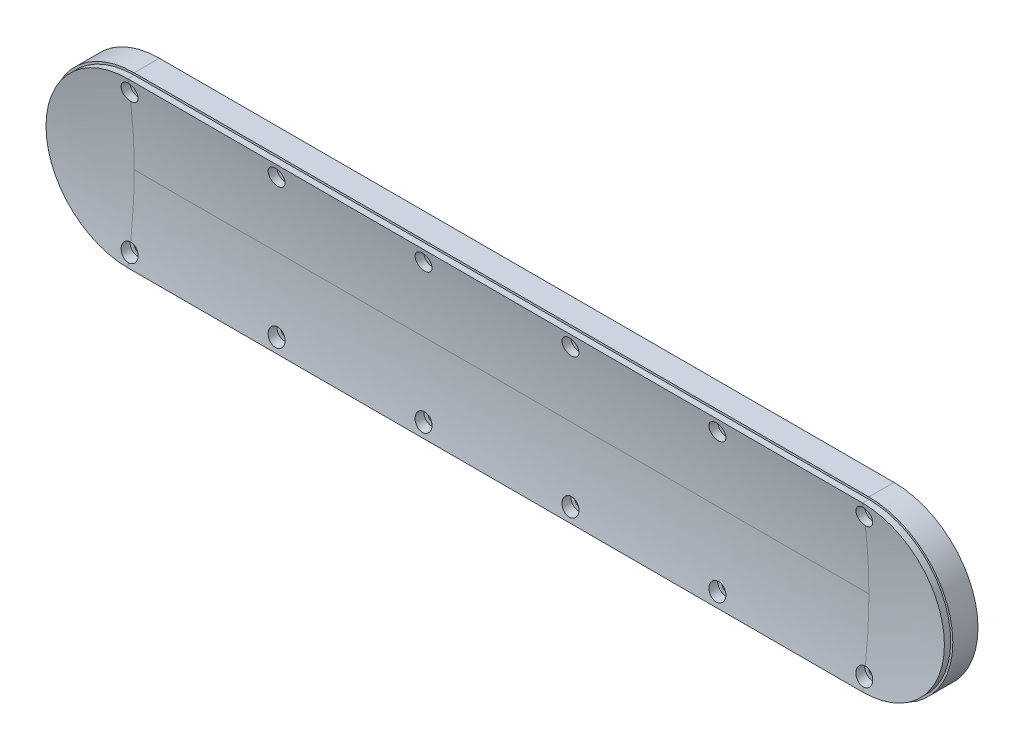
ISO-10303-21;
HEADER;
FILE_DESCRIPTION(('STEP AP214'),'2;1');
FILE_NAME('part.step','',(''),(''),'','','');
FILE_SCHEMA(('AUTOMOTIVE_DESIGN { 1 0 10303 214 1 1 1 1 }'));
ENDSEC;
DATA;
#1=APPLICATION_CONTEXT('core data for automotive mechanical design processes');
#2=APPLICATION_PROTOCOL_DEFINITION('international standard','automotive_design',2000,#1);
#3=PRODUCT_CONTEXT('',#1,'mechanical');
#4=PRODUCT('Part','Part','',(#3));
#5=PRODUCT_RELATED_PRODUCT_CATEGORY('part','',(#4));
#6=PRODUCT_DEFINITION_FORMATION('','',#4);
#7=PRODUCT_DEFINITION_CONTEXT('part definition',#1,'design');
#8=PRODUCT_DEFINITION('design','',#6,#7);
#9=PRODUCT_DEFINITION_SHAPE('','',#8);
#10=(LENGTH_UNIT() NAMED_UNIT(*) SI_UNIT(.MILLI.,.METRE.));
#11=(NAMED_UNIT(*) PLANE_ANGLE_UNIT() SI_UNIT($,.RADIAN.));
#12=(NAMED_UNIT(*) SI_UNIT($,.STERADIAN.) SOLID_ANGLE_UNIT());
#13=UNCERTAINTY_MEASURE_WITH_UNIT(LENGTH_MEASURE(1.E-05),#10,'distance_accuracy_value','');
#14=(GEOMETRIC_REPRESENTATION_CONTEXT(3) GLOBAL_UNCERTAINTY_ASSIGNED_CONTEXT((#13)) GLOBAL_UNIT_ASSIGNED_CONTEXT((#10,
#11,#12)) REPRESENTATION_CONTEXT('',''));
#15=CARTESIAN_POINT('',(0.,0.,0.));
#16=DIRECTION('',(0.,0.,1.));
#17=DIRECTION('',(1.,0.,0.));
#18=AXIS2_PLACEMENT_3D('',#15,#16,#17);
#19=CARTESIAN_POINT('',(-168.756750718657,1.92758870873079,15.001025));
#20=DIRECTION('',(0.,0.,-1.));
#21=DIRECTION('',(-1.,0.,0.));
#22=AXIS2_PLACEMENT_3D('',#19,#20,#21);
#23=CYLINDRICAL_SURFACE('',#22,2.);
#24=CARTESIAN_POINT('',(-168.756750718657,1.92758870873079,0.));
#25=DIRECTION('',(0.,0.,1.));
#26=DIRECTION('',(1.,0.,0.));
#27=AXIS2_PLACEMENT_3D('',#24,#25,#26);
#28=CIRCLE('',#27,2.);
#29=CARTESIAN_POINT('',(-166.756750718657,1.92758870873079,0.));
#30=VERTEX_POINT('',#29);
#31=EDGE_CURVE('E340',#30,#30,#28,.T.);
#32=ORIENTED_EDGE('',*,*,#31,.F.);
#33=EDGE_LOOP('',(#32));
#34=FACE_BOUND('',#33,.T.);
#35=CARTESIAN_POINT('',(-168.756750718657,1.92758870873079,10.));
#36=DIRECTION('',(0.,0.,1.));
#37=DIRECTION('',(1.,0.,0.));
#38=AXIS2_PLACEMENT_3D('',#35,#36,#37);
#39=CIRCLE('',#38,2.);
#40=CARTESIAN_POINT('',(-166.756750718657,1.92758870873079,10.));
#41=VERTEX_POINT('',#40);
#42=EDGE_CURVE('E143',#41,#41,#39,.F.);
#43=ORIENTED_EDGE('',*,*,#42,.F.);
#44=EDGE_LOOP('',(#43));
#45=FACE_BOUND('',#44,.T.);
#46=ADVANCED_FACE('F33',(#34,#45),#23,.F.);
#47=CARTESIAN_POINT('',(-98.7567507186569,1.9275887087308,15.001025));
#48=DIRECTION('',(0.,0.,-1.));
#49=DIRECTION('',(-1.,0.,0.));
#50=AXIS2_PLACEMENT_3D('',#47,#48,#49);
#51=CYLINDRICAL_SURFACE('',#50,2.);
#52=CARTESIAN_POINT('',(-98.7567507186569,1.9275887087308,0.));
#53=DIRECTION('',(0.,0.,1.));
#54=DIRECTION('',(1.,0.,0.));
#55=AXIS2_PLACEMENT_3D('',#52,#53,#54);
#56=CIRCLE('',#55,2.);
#57=CARTESIAN_POINT('',(-96.7567507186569,1.9275887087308,0.));
#58=VERTEX_POINT('',#57);
#59=EDGE_CURVE('E337',#58,#58,#56,.T.);
#60=ORIENTED_EDGE('',*,*,#59,.F.);
#61=EDGE_LOOP('',(#60));
#62=FACE_BOUND('',#61,.T.);
#63=CARTESIAN_POINT('',(-98.7567507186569,1.9275887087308,10.));
#64=DIRECTION('',(0.,0.,1.));
#65=DIRECTION('',(1.,0.,0.));
#66=AXIS2_PLACEMENT_3D('',#63,#64,#65);
#67=CIRCLE('',#66,2.);
#68=CARTESIAN_POINT('',(-96.7567507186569,1.9275887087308,10.));
#69=VERTEX_POINT('',#68);
#70=EDGE_CURVE('E189',#69,#69,#67,.F.);
#71=ORIENTED_EDGE('',*,*,#70,.F.);
#72=EDGE_LOOP('',(#71));
#73=FACE_BOUND('',#72,.T.);
#74=ADVANCED_FACE('F475',(#62,#73),#51,.F.);
#75=CARTESIAN_POINT('',(-28.7567507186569,1.92758870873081,15.001025));
#76=DIRECTION('',(0.,0.,-1.));
#77=DIRECTION('',(-1.,0.,0.));
#78=AXIS2_PLACEMENT_3D('',#75,#76,#77);
#79=CYLINDRICAL_SURFACE('',#78,2.);
#80=CARTESIAN_POINT('',(-28.7567507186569,1.92758870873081,0.));
#81=DIRECTION('',(0.,0.,1.));
#82=DIRECTION('',(1.,0.,0.));
#83=AXIS2_PLACEMENT_3D('',#80,#81,#82);
#84=CIRCLE('',#83,2.);
#85=CARTESIAN_POINT('',(-26.7567507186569,1.92758870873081,0.));
#86=VERTEX_POINT('',#85);
#87=EDGE_CURVE('E334',#86,#86,#84,.T.);
#88=ORIENTED_EDGE('',*,*,#87,.F.);
#89=EDGE_LOOP('',(#88));
#90=FACE_BOUND('',#89,.T.);
#91=CARTESIAN_POINT('',(-28.7567507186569,1.92758870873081,10.));
#92=DIRECTION('',(0.,0.,1.));
#93=DIRECTION('',(1.,0.,0.));
#94=AXIS2_PLACEMENT_3D('',#91,#92,#93);
#95=CIRCLE('',#94,2.);
#96=CARTESIAN_POINT('',(-26.7567507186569,1.92758870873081,10.));
#97=VERTEX_POINT('',#96);
#98=EDGE_CURVE('E218',#97,#97,#95,.F.);
#99=ORIENTED_EDGE('',*,*,#98,.F.);
#100=EDGE_LOOP('',(#99));
#101=FACE_BOUND('',#100,.T.);
#102=ADVANCED_FACE('F480',(#90,#101),#79,.F.);
#103=CARTESIAN_POINT('',(41.2432492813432,1.92758870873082,15.001025));
#104=DIRECTION('',(0.,0.,-1.));
#105=DIRECTION('',(-1.,0.,0.));
#106=AXIS2_PLACEMENT_3D('',#103,#104,#105);
#107=CYLINDRICAL_SURFACE('',#106,2.);
#108=CARTESIAN_POINT('',(41.2432492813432,1.92758870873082,0.));
#109=DIRECTION('',(0.,0.,1.));
#110=DIRECTION('',(1.,0.,0.));
#111=AXIS2_PLACEMENT_3D('',#108,#109,#110);
#112=CIRCLE('',#111,2.);
#113=CARTESIAN_POINT('',(43.2432492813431,1.92758870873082,0.));
#114=VERTEX_POINT('',#113);
#115=EDGE_CURVE('E331',#114,#114,#112,.T.);
#116=ORIENTED_EDGE('',*,*,#115,.F.);
#117=EDGE_LOOP('',(#116));
#118=FACE_BOUND('',#117,.T.);
#119=CARTESIAN_POINT('',(41.2432492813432,1.92758870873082,10.));
#120=DIRECTION('',(0.,0.,1.));
#121=DIRECTION('',(1.,0.,0.));
#122=AXIS2_PLACEMENT_3D('',#119,#120,#121);
#123=CIRCLE('',#122,2.);
#124=CARTESIAN_POINT('',(43.2432492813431,1.92758870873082,10.));
#125=VERTEX_POINT('',#124);
#126=EDGE_CURVE('E227',#125,#125,#123,.F.);
#127=ORIENTED_EDGE('',*,*,#126,.F.);
#128=EDGE_LOOP('',(#127));
#129=FACE_BOUND('',#128,.T.);
#130=ADVANCED_FACE('F517',(#118,#129),#107,.F.);
#131=CARTESIAN_POINT('',(111.243249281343,1.92758870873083,15.001025));
#132=DIRECTION('',(0.,0.,-1.));
#133=DIRECTION('',(-1.,0.,0.));
#134=AXIS2_PLACEMENT_3D('',#131,#132,#133);
#135=CYLINDRICAL_SURFACE('',#134,2.);
#136=CARTESIAN_POINT('',(111.243249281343,1.92758870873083,0.));
#137=DIRECTION('',(0.,0.,1.));
#138=DIRECTION('',(1.,0.,0.));
#139=AXIS2_PLACEMENT_3D('',#136,#137,#138);
#140=CIRCLE('',#139,2.);
#141=CARTESIAN_POINT('',(113.243249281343,1.92758870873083,0.));
#142=VERTEX_POINT('',#141);
#143=EDGE_CURVE('E328',#142,#142,#140,.T.);
#144=ORIENTED_EDGE('',*,*,#143,.F.);
#145=EDGE_LOOP('',(#144));
#146=FACE_BOUND('',#145,.T.);
#147=CARTESIAN_POINT('',(111.243249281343,1.92758870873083,10.));
#148=DIRECTION('',(0.,0.,1.));
#149=DIRECTION('',(1.,0.,0.));
#150=AXIS2_PLACEMENT_3D('',#147,#148,#149);
#151=CIRCLE('',#150,2.);
#152=CARTESIAN_POINT('',(113.243249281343,1.92758870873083,10.));
#153=VERTEX_POINT('',#152);
#154=EDGE_CURVE('E251',#153,#153,#151,.F.);
#155=ORIENTED_EDGE('',*,*,#154,.F.);
#156=EDGE_LOOP('',(#155));
#157=FACE_BOUND('',#156,.T.);
#158=ADVANCED_FACE('F514',(#146,#157),#135,.F.);
#159=CARTESIAN_POINT('',(181.243249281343,1.92758870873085,15.001025));
#160=DIRECTION('',(0.,0.,-1.));
#161=DIRECTION('',(-1.,0.,0.));
#162=AXIS2_PLACEMENT_3D('',#159,#160,#161);
#163=CYLINDRICAL_SURFACE('',#162,2.);
#164=CARTESIAN_POINT('',(181.243249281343,1.92758870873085,0.));
#165=DIRECTION('',(0.,0.,1.));
#166=DIRECTION('',(1.,0.,0.));
#167=AXIS2_PLACEMENT_3D('',#164,#165,#166);
#168=CIRCLE('',#167,2.);
#169=CARTESIAN_POINT('',(183.243249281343,1.92758870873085,0.));
#170=VERTEX_POINT('',#169);
#171=EDGE_CURVE('E325',#170,#170,#168,.T.);
#172=ORIENTED_EDGE('',*,*,#171,.F.);
#173=EDGE_LOOP('',(#172));
#174=FACE_BOUND('',#173,.T.);
#175=CARTESIAN_POINT('',(181.243249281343,1.92758870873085,10.));
#176=DIRECTION('',(0.,0.,1.));
#177=DIRECTION('',(1.,0.,0.));
#178=AXIS2_PLACEMENT_3D('',#175,#176,#177);
#179=CIRCLE('',#178,2.);
#180=CARTESIAN_POINT('',(183.243249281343,1.92758870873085,10.));
#181=VERTEX_POINT('',#180);
#182=EDGE_CURVE('E277',#181,#181,#179,.F.);
#183=ORIENTED_EDGE('',*,*,#182,.F.);
#184=EDGE_LOOP('',(#183));
#185=FACE_BOUND('',#184,.T.);
#186=ADVANCED_FACE('F516',(#174,#185),#163,.F.);
#187=CARTESIAN_POINT('',(181.243249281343,-70.0724112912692,15.));
#188=CARTESIAN_POINT('',(181.243249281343,-50.6872940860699,11.9845147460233));
#189=CARTESIAN_POINT('',(181.243249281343,-31.0724112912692,12.));
#190=B_SPLINE_CURVE_WITH_KNOTS('',2,(#187,#188,#189),.UNSPECIFIED.,.F.,.F.,(3,3),(0.,1.),.UNSPECIFIED.);
#191=DIRECTION('',(-1.,0.,0.));
#192=VECTOR('',#191,1.);
#193=SURFACE_OF_LINEAR_EXTRUSION('',#190,#192);
#194=CARTESIAN_POINT('',(-32.7567507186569,-64.0724112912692,14.1399730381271));
#195=CARTESIAN_POINT('',(-32.7567409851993,-63.8466027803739,14.1103606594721));
#196=CARTESIAN_POINT('',(-32.7375684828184,-63.6205927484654,14.0810346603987));
#197=CARTESIAN_POINT('',(-32.6612828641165,-63.1746902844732,14.0237783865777));
#198=CARTESIAN_POINT('',(-32.6041250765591,-62.954805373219,13.9958497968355));
#199=CARTESIAN_POINT('',(-32.4533693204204,-62.5276554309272,13.9421389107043));
#200=CARTESIAN_POINT('',(-32.3597801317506,-62.3203873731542,13.9163560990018));
#201=CARTESIAN_POINT('',(-32.1387324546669,-61.9244840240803,13.8675666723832));
#202=CARTESIAN_POINT('',(-32.0112828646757,-61.7358438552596,13.8445593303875));
#203=CARTESIAN_POINT('',(-31.7266824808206,-61.3834389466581,13.8019341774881));
#204=CARTESIAN_POINT('',(-31.5696658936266,-61.219567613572,13.782301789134));
#205=CARTESIAN_POINT('',(-31.2299681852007,-60.9205233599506,13.7467230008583));
#206=CARTESIAN_POINT('',(-31.0472869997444,-60.7853505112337,13.730776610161));
#207=CARTESIAN_POINT('',(-30.6628761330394,-60.5485959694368,13.7029952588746));
#208=CARTESIAN_POINT('',(-30.4612941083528,-60.4467779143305,13.6911313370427));
#209=CARTESIAN_POINT('',(-30.0437130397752,-60.2784157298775,13.6715822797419));
#210=CARTESIAN_POINT('',(-29.827714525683,-60.2118703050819,13.6638969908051));
#211=CARTESIAN_POINT('',(-29.3887530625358,-60.1163092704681,13.6528778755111));
#212=CARTESIAN_POINT('',(-29.1658366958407,-60.0870824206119,13.6495195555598));
#213=CARTESIAN_POINT('',(-28.7182349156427,-60.0663274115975,13.6471336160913));
#214=CARTESIAN_POINT('',(-28.4935495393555,-60.0747984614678,13.6481059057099));
#215=CARTESIAN_POINT('',(-28.0493826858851,-60.1291176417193,13.6543558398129));
#216=CARTESIAN_POINT('',(-27.8298895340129,-60.1748716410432,13.6596226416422));
#217=CARTESIAN_POINT('',(-27.4017371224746,-60.3022884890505,13.6743535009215));
#218=CARTESIAN_POINT('',(-27.1930778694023,-60.3839513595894,13.683817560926));
#219=CARTESIAN_POINT('',(-26.7922190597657,-60.5809148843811,13.706783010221));
#220=CARTESIAN_POINT('',(-26.6000398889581,-60.696256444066,13.7202893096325));
#221=CARTESIAN_POINT('',(-26.2377891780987,-60.9571804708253,13.7510758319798));
#222=CARTESIAN_POINT('',(-26.0677180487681,-61.1027634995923,13.7683561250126));
#223=CARTESIAN_POINT('',(-25.7536359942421,-61.4207194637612,13.8064311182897));
#224=CARTESIAN_POINT('',(-25.6097503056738,-61.5932141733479,13.8272418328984));
#225=CARTESIAN_POINT('',(-25.3529526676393,-61.9595457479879,13.8718735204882));
#226=CARTESIAN_POINT('',(-25.2400417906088,-62.1533833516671,13.8956945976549));
#227=CARTESIAN_POINT('',(-25.0475618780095,-62.5583059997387,13.9459772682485));
#228=CARTESIAN_POINT('',(-24.9682280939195,-62.7695007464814,13.972455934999));
#229=CARTESIAN_POINT('',(-24.8461439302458,-63.2019819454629,14.0272659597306));
#230=CARTESIAN_POINT('',(-24.8033950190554,-63.4232688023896,14.0555973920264));
#231=CARTESIAN_POINT('',(-24.7554216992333,-63.8712636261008,14.1135739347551));
#232=CARTESIAN_POINT('',(-24.7504559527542,-64.0979983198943,14.1432267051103));
#233=CARTESIAN_POINT('',(-24.7788237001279,-64.5490219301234,14.2028341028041));
#234=CARTESIAN_POINT('',(-24.8121583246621,-64.7733107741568,14.2327887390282));
#235=CARTESIAN_POINT('',(-24.9163958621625,-65.2139550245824,14.292222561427));
#236=CARTESIAN_POINT('',(-24.9874387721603,-65.4302776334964,14.3216995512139));
#237=CARTESIAN_POINT('',(-25.1652309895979,-65.8479388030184,14.379129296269));
#238=CARTESIAN_POINT('',(-25.2719803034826,-66.0492773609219,14.407082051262));
#239=CARTESIAN_POINT('',(-25.5180198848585,-66.4308112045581,14.4604764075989));
#240=CARTESIAN_POINT('',(-25.6572482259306,-66.6110457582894,14.4859226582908));
#241=CARTESIAN_POINT('',(-25.9645013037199,-66.9455472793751,14.5334669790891));
#242=CARTESIAN_POINT('',(-26.1325249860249,-67.0998151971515,14.5555651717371));
#243=CARTESIAN_POINT('',(-26.4912620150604,-67.3767287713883,14.59544307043));
#244=CARTESIAN_POINT('',(-26.6817928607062,-67.4996062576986,14.6132543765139));
#245=CARTESIAN_POINT('',(-27.0811593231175,-67.7115718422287,14.6440956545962));
#246=CARTESIAN_POINT('',(-27.2899938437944,-67.8006619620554,14.6571259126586));
#247=CARTESIAN_POINT('',(-27.7178057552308,-67.9416248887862,14.6777888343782));
#248=CARTESIAN_POINT('',(-27.9366614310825,-67.9938594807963,14.6854739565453));
#249=CARTESIAN_POINT('',(-28.380147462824,-68.0609521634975,14.6953512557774));
#250=CARTESIAN_POINT('',(-28.6047775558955,-68.0758119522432,14.6975436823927));
#251=CARTESIAN_POINT('',(-29.0517828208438,-68.0677315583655,14.6963526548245));
#252=CARTESIAN_POINT('',(-29.2741628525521,-68.0450516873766,14.6930075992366));
#253=CARTESIAN_POINT('',(-29.7119127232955,-67.9630733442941,14.6809466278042));
#254=CARTESIAN_POINT('',(-29.927282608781,-67.903775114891,14.6722307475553));
#255=CARTESIAN_POINT('',(-30.3449727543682,-67.7503268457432,14.6497654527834));
#256=CARTESIAN_POINT('',(-30.5472911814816,-67.6561719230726,14.6360153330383));
#257=CARTESIAN_POINT('',(-30.9332260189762,-67.4357929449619,14.6040033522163));
#258=CARTESIAN_POINT('',(-31.1168425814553,-67.3095691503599,14.5857415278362));
#259=CARTESIAN_POINT('',(-31.461564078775,-67.027727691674,14.5452338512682));
#260=CARTESIAN_POINT('',(-31.6225047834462,-66.8719130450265,14.5229613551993));
#261=CARTESIAN_POINT('',(-31.9160361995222,-66.5358838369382,14.4753015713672));
#262=CARTESIAN_POINT('',(-32.0486184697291,-66.3556620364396,14.4499133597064));
#263=CARTESIAN_POINT('',(-32.2830490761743,-65.9739683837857,14.3966120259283));
#264=CARTESIAN_POINT('',(-32.3845646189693,-65.7722956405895,14.3686754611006));
#265=CARTESIAN_POINT('',(-32.5521604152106,-65.3551016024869,14.3114383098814));
#266=CARTESIAN_POINT('',(-32.6182807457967,-65.1395962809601,14.2821393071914));
#267=CARTESIAN_POINT('',(-32.6960585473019,-64.7810638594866,14.2338862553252));
#268=CARTESIAN_POINT('',(-32.7187883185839,-64.6403236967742,14.2150636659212));
#269=CARTESIAN_POINT('',(-32.749137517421,-64.3572195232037,14.1774470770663));
#270=CARTESIAN_POINT('',(-32.756756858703,-64.2148555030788,14.1586530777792));
#271=CARTESIAN_POINT('',(-32.7567507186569,-64.0724112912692,14.1399730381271));
#272=B_SPLINE_CURVE_WITH_KNOTS('',3,(#194,#195,#196,#197,#198,#199,#200,#201,#202,#203,#204,
#205,#206,#207,#208,#209,#210,#211,#212,#213,#214,#215,#216,#217,#218,#219,#220,#221,#222,#223,
#224,#225,#226,#227,#228,#229,#230,#231,#232,#233,#234,#235,#236,#237,#238,#239,#240,#241,#242,
#243,#244,#245,#246,#247,#248,#249,#250,#251,#252,#253,#254,#255,#256,#257,#258,#259,#260,#261,
#262,#263,#264,#265,#266,#267,#268,#269,#270,#271),.UNSPECIFIED.,.T.,.F.,(4,2,2,2,2,2,2,2,2,2,2,
2,2,2,2,2,2,2,2,2,2,2,2,2,2,2,2,2,2,2,2,2,2,2,2,2,2,2,4),(0.,0.682704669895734,1.3662136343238,
2.0495579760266,2.73272291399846,3.41285856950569,4.09299592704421,4.7682037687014,
5.44338681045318,6.11473081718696,6.78606073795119,7.45570093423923,8.12534153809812,
8.79579888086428,9.46626867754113,10.1398653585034,10.8134853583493,11.4917498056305,
12.170041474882,12.8529725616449,13.5359238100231,14.221428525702,14.9069333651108,
15.5911417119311,16.275325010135,16.9542989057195,17.6332321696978,18.3054044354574,
18.9775461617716,19.6450465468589,20.3125425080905,20.9801320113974,21.6477160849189,
22.3199106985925,22.9923051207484,23.6716687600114,24.3502615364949,24.7809218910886,
25.2115847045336),.UNSPECIFIED.);
#273=CARTESIAN_POINT('',(-32.7567507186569,-64.0724112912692,14.1399730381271));
#274=VERTEX_POINT('',#273);
#275=EDGE_CURVE('E404',#274,#274,#272,.T.);
#276=ORIENTED_EDGE('',*,*,#275,.T.);
#277=EDGE_LOOP('',(#276));
#278=FACE_BOUND('',#277,.T.);
#279=CARTESIAN_POINT('',(107.243249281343,-64.0724112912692,14.1399730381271));
#280=CARTESIAN_POINT('',(107.243259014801,-63.8466027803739,14.1103606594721));
#281=CARTESIAN_POINT('',(107.262431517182,-63.6205927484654,14.0810346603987));
#282=CARTESIAN_POINT('',(107.338717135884,-63.1746902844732,14.0237783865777));
#283=CARTESIAN_POINT('',(107.395874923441,-62.954805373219,13.9958497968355));
#284=CARTESIAN_POINT('',(107.54663067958,-62.5276554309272,13.9421389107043));
#285=CARTESIAN_POINT('',(107.640219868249,-62.3203873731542,13.9163560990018));
#286=CARTESIAN_POINT('',(107.861267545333,-61.9244840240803,13.8675666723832));
#287=CARTESIAN_POINT('',(107.988717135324,-61.7358438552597,13.8445593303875));
#288=CARTESIAN_POINT('',(108.273317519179,-61.3834389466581,13.8019341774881));
#289=CARTESIAN_POINT('',(108.430334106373,-61.219567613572,13.782301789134));
#290=CARTESIAN_POINT('',(108.770031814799,-60.9205233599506,13.7467230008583));
#291=CARTESIAN_POINT('',(108.952713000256,-60.7853505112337,13.730776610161));
#292=CARTESIAN_POINT('',(109.337123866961,-60.5485959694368,13.7029952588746));
#293=CARTESIAN_POINT('',(109.538705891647,-60.4467779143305,13.6911313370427));
#294=CARTESIAN_POINT('',(109.956286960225,-60.2784157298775,13.6715822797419));
#295=CARTESIAN_POINT('',(110.172285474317,-60.2118703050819,13.6638969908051));
#296=CARTESIAN_POINT('',(110.611246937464,-60.1163092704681,13.6528778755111));
#297=CARTESIAN_POINT('',(110.834163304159,-60.0870824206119,13.6495195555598));
#298=CARTESIAN_POINT('',(111.281765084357,-60.0663274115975,13.6471336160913));
#299=CARTESIAN_POINT('',(111.506450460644,-60.0747984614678,13.6481059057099));
#300=CARTESIAN_POINT('',(111.950617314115,-60.1291176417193,13.6543558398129));
#301=CARTESIAN_POINT('',(112.170110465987,-60.1748716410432,13.6596226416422));
#302=CARTESIAN_POINT('',(112.598262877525,-60.3022884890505,13.6743535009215));
#303=CARTESIAN_POINT('',(112.806922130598,-60.3839513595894,13.683817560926));
#304=CARTESIAN_POINT('',(113.207780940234,-60.5809148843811,13.706783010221));
#305=CARTESIAN_POINT('',(113.399960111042,-60.696256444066,13.7202893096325));
#306=CARTESIAN_POINT('',(113.762210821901,-60.9571804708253,13.7510758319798));
#307=CARTESIAN_POINT('',(113.932281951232,-61.1027634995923,13.7683561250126));
#308=CARTESIAN_POINT('',(114.246364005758,-61.4207194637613,13.8064311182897));
#309=CARTESIAN_POINT('',(114.390249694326,-61.5932141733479,13.8272418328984));
#310=CARTESIAN_POINT('',(114.647047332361,-61.9595457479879,13.8718735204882));
#311=CARTESIAN_POINT('',(114.759958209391,-62.1533833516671,13.8956945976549));
#312=CARTESIAN_POINT('',(114.952438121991,-62.5583059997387,13.9459772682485));
#313=CARTESIAN_POINT('',(115.031771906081,-62.7695007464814,13.972455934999));
#314=CARTESIAN_POINT('',(115.153856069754,-63.2019819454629,14.0272659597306));
#315=CARTESIAN_POINT('',(115.196604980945,-63.4232688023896,14.0555973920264));
#316=CARTESIAN_POINT('',(115.244578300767,-63.8712636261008,14.1135739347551));
#317=CARTESIAN_POINT('',(115.249544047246,-64.0979983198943,14.1432267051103));
#318=CARTESIAN_POINT('',(115.221176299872,-64.5490219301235,14.2028341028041));
#319=CARTESIAN_POINT('',(115.187841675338,-64.7733107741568,14.2327887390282));
#320=CARTESIAN_POINT('',(115.083604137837,-65.2139550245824,14.292222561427));
#321=CARTESIAN_POINT('',(115.01256122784,-65.4302776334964,14.3216995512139));
#322=CARTESIAN_POINT('',(114.834769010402,-65.8479388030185,14.379129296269));
#323=CARTESIAN_POINT('',(114.728019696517,-66.0492773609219,14.407082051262));
#324=CARTESIAN_POINT('',(114.481980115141,-66.4308112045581,14.4604764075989));
#325=CARTESIAN_POINT('',(114.342751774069,-66.6110457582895,14.4859226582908));
#326=CARTESIAN_POINT('',(114.03549869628,-66.9455472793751,14.5334669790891));
#327=CARTESIAN_POINT('',(113.867475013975,-67.0998151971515,14.5555651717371));
#328=CARTESIAN_POINT('',(113.50873798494,-67.3767287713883,14.59544307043));
#329=CARTESIAN_POINT('',(113.318207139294,-67.4996062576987,14.6132543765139));
#330=CARTESIAN_POINT('',(112.918840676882,-67.7115718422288,14.6440956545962));
#331=CARTESIAN_POINT('',(112.710006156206,-67.8006619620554,14.6571259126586));
#332=CARTESIAN_POINT('',(112.282194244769,-67.9416248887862,14.6777888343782));
#333=CARTESIAN_POINT('',(112.063338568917,-67.9938594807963,14.6854739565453));
#334=CARTESIAN_POINT('',(111.619852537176,-68.0609521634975,14.6953512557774));
#335=CARTESIAN_POINT('',(111.395222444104,-68.0758119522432,14.6975436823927));
#336=CARTESIAN_POINT('',(110.948217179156,-68.0677315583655,14.6963526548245));
#337=CARTESIAN_POINT('',(110.725837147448,-68.0450516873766,14.6930075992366));
#338=CARTESIAN_POINT('',(110.288087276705,-67.9630733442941,14.6809466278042));
#339=CARTESIAN_POINT('',(110.072717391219,-67.903775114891,14.6722307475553));
#340=CARTESIAN_POINT('',(109.655027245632,-67.7503268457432,14.6497654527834));
#341=CARTESIAN_POINT('',(109.452708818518,-67.6561719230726,14.6360153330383));
#342=CARTESIAN_POINT('',(109.066773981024,-67.435792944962,14.6040033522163));
#343=CARTESIAN_POINT('',(108.883157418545,-67.3095691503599,14.5857415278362));
#344=CARTESIAN_POINT('',(108.538435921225,-67.027727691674,14.5452338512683));
#345=CARTESIAN_POINT('',(108.377495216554,-66.8719130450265,14.5229613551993));
#346=CARTESIAN_POINT('',(108.083963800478,-66.5358838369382,14.4753015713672));
#347=CARTESIAN_POINT('',(107.951381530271,-66.3556620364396,14.4499133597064));
#348=CARTESIAN_POINT('',(107.716950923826,-65.9739683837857,14.3966120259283));
#349=CARTESIAN_POINT('',(107.615435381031,-65.7722956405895,14.3686754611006));
#350=CARTESIAN_POINT('',(107.447839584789,-65.3551016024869,14.3114383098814));
#351=CARTESIAN_POINT('',(107.381719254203,-65.1395962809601,14.2821393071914));
#352=CARTESIAN_POINT('',(107.303941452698,-64.7810638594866,14.2338862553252));
#353=CARTESIAN_POINT('',(107.281211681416,-64.6403236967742,14.2150636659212));
#354=CARTESIAN_POINT('',(107.250862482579,-64.3572195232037,14.1774470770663));
#355=CARTESIAN_POINT('',(107.243243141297,-64.2148555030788,14.1586530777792));
#356=CARTESIAN_POINT('',(107.243249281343,-64.0724112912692,14.1399730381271));
#357=B_SPLINE_CURVE_WITH_KNOTS('',3,(#279,#280,#281,#282,#283,#284,#285,#286,#287,#288,#289,
#290,#291,#292,#293,#294,#295,#296,#297,#298,#299,#300,#301,#302,#303,#304,#305,#306,#307,#308,
#309,#310,#311,#312,#313,#314,#315,#316,#317,#318,#319,#320,#321,#322,#323,#324,#325,#326,#327,
#328,#329,#330,#331,#332,#333,#334,#335,#336,#337,#338,#339,#340,#341,#342,#343,#344,#345,#346,
#347,#348,#349,#350,#351,#352,#353,#354,#355,#356),.UNSPECIFIED.,.T.,.F.,(4,2,2,2,2,2,2,2,2,2,2,
2,2,2,2,2,2,2,2,2,2,2,2,2,2,2,2,2,2,2,2,2,2,2,2,2,2,2,4),(0.,0.682704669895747,1.3662136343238,
2.0495579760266,2.73272291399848,3.41285856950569,4.0929959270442,4.76820376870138,
5.44338681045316,6.11473081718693,6.78606073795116,7.45570093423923,8.12534153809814,
8.79579888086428,9.46626867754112,10.1398653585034,10.8134853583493,11.4917498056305,
12.170041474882,12.8529725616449,13.5359238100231,14.221428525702,14.9069333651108,
15.5911417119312,16.275325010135,16.9542989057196,17.6332321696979,18.3054044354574,
18.9775461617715,19.6450465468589,20.3125425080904,20.9801320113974,21.6477160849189,
22.3199106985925,22.9923051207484,23.6716687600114,24.3502615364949,24.7809218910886,
25.2115847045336),.UNSPECIFIED.);
#358=CARTESIAN_POINT('',(107.243249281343,-64.0724112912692,14.1399730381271));
#359=VERTEX_POINT('',#358);
#360=EDGE_CURVE('E372',#359,#359,#357,.T.);
#361=ORIENTED_EDGE('',*,*,#360,.T.);
#362=EDGE_LOOP('',(#361));
#363=FACE_BOUND('',#362,.T.);
#364=CARTESIAN_POINT('',(37.2432492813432,-64.0724112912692,14.1399730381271));
#365=CARTESIAN_POINT('',(37.2432590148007,-63.8466027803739,14.1103606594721));
#366=CARTESIAN_POINT('',(37.2624315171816,-63.6205927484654,14.0810346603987));
#367=CARTESIAN_POINT('',(37.3387171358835,-63.1746902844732,14.0237783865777));
#368=CARTESIAN_POINT('',(37.3958749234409,-62.954805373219,13.9958497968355));
#369=CARTESIAN_POINT('',(37.5466306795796,-62.5276554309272,13.9421389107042));
#370=CARTESIAN_POINT('',(37.6402198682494,-62.3203873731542,13.9163560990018));
#371=CARTESIAN_POINT('',(37.8612675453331,-61.9244840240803,13.8675666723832));
#372=CARTESIAN_POINT('',(37.9887171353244,-61.7358438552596,13.8445593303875));
#373=CARTESIAN_POINT('',(38.2733175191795,-61.3834389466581,13.8019341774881));
#374=CARTESIAN_POINT('',(38.4303341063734,-61.219567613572,13.782301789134));
#375=CARTESIAN_POINT('',(38.7700318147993,-60.9205233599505,13.7467230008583));
#376=CARTESIAN_POINT('',(38.9527130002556,-60.7853505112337,13.730776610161));
#377=CARTESIAN_POINT('',(39.3371238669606,-60.5485959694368,13.7029952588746));
#378=CARTESIAN_POINT('',(39.5387058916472,-60.4467779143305,13.6911313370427));
#379=CARTESIAN_POINT('',(39.9562869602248,-60.2784157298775,13.6715822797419));
#380=CARTESIAN_POINT('',(40.172285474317,-60.2118703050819,13.6638969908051));
#381=CARTESIAN_POINT('',(40.6112469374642,-60.1163092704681,13.6528778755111));
#382=CARTESIAN_POINT('',(40.8341633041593,-60.0870824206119,13.6495195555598));
#383=CARTESIAN_POINT('',(41.2817650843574,-60.0663274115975,13.6471336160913));
#384=CARTESIAN_POINT('',(41.5064504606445,-60.0747984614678,13.6481059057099));
#385=CARTESIAN_POINT('',(41.9506173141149,-60.1291176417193,13.6543558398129));
#386=CARTESIAN_POINT('',(42.1701104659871,-60.1748716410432,13.6596226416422));
#387=CARTESIAN_POINT('',(42.5982628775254,-60.3022884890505,13.6743535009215));
#388=CARTESIAN_POINT('',(42.8069221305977,-60.3839513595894,13.683817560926));
#389=CARTESIAN_POINT('',(43.2077809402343,-60.5809148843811,13.706783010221));
#390=CARTESIAN_POINT('',(43.3999601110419,-60.696256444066,13.7202893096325));
#391=CARTESIAN_POINT('',(43.7622108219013,-60.9571804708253,13.7510758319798));
#392=CARTESIAN_POINT('',(43.9322819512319,-61.1027634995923,13.7683561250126));
#393=CARTESIAN_POINT('',(44.2463640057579,-61.4207194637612,13.8064311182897));
#394=CARTESIAN_POINT('',(44.3902496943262,-61.5932141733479,13.8272418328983));
#395=CARTESIAN_POINT('',(44.6470473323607,-61.9595457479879,13.8718735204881));
#396=CARTESIAN_POINT('',(44.7599582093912,-62.1533833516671,13.8956945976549));
#397=CARTESIAN_POINT('',(44.9524381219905,-62.5583059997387,13.9459772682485));
#398=CARTESIAN_POINT('',(45.0317719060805,-62.7695007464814,13.972455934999));
#399=CARTESIAN_POINT('',(45.1538560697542,-63.2019819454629,14.0272659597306));
#400=CARTESIAN_POINT('',(45.1966049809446,-63.4232688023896,14.0555973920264));
#401=CARTESIAN_POINT('',(45.2445783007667,-63.8712636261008,14.1135739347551));
#402=CARTESIAN_POINT('',(45.2495440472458,-64.0979983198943,14.1432267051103));
#403=CARTESIAN_POINT('',(45.2211762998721,-64.5490219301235,14.2028341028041));
#404=CARTESIAN_POINT('',(45.1878416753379,-64.7733107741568,14.2327887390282));
#405=CARTESIAN_POINT('',(45.0836041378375,-65.2139550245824,14.292222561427));
#406=CARTESIAN_POINT('',(45.0125612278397,-65.4302776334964,14.3216995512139));
#407=CARTESIAN_POINT('',(44.8347690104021,-65.8479388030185,14.379129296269));
#408=CARTESIAN_POINT('',(44.7280196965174,-66.0492773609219,14.407082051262));
#409=CARTESIAN_POINT('',(44.4819801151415,-66.4308112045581,14.4604764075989));
#410=CARTESIAN_POINT('',(44.3427517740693,-66.6110457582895,14.4859226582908));
#411=CARTESIAN_POINT('',(44.0354986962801,-66.9455472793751,14.5334669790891));
#412=CARTESIAN_POINT('',(43.8674750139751,-67.0998151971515,14.5555651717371));
#413=CARTESIAN_POINT('',(43.5087379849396,-67.3767287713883,14.59544307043));
#414=CARTESIAN_POINT('',(43.3182071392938,-67.4996062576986,14.6132543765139));
#415=CARTESIAN_POINT('',(42.9188406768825,-67.7115718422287,14.6440956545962));
#416=CARTESIAN_POINT('',(42.7100061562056,-67.8006619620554,14.6571259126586));
#417=CARTESIAN_POINT('',(42.2821942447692,-67.9416248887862,14.6777888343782));
#418=CARTESIAN_POINT('',(42.0633385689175,-67.9938594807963,14.6854739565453));
#419=CARTESIAN_POINT('',(41.619852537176,-68.0609521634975,14.6953512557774));
#420=CARTESIAN_POINT('',(41.3952224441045,-68.0758119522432,14.6975436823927));
#421=CARTESIAN_POINT('',(40.9482171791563,-68.0677315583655,14.6963526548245));
#422=CARTESIAN_POINT('',(40.7258371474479,-68.0450516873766,14.6930075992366));
#423=CARTESIAN_POINT('',(40.2880872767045,-67.9630733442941,14.6809466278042));
#424=CARTESIAN_POINT('',(40.0727173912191,-67.903775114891,14.6722307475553));
#425=CARTESIAN_POINT('',(39.6550272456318,-67.7503268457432,14.6497654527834));
#426=CARTESIAN_POINT('',(39.4527088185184,-67.6561719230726,14.6360153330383));
#427=CARTESIAN_POINT('',(39.0667739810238,-67.4357929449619,14.6040033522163));
#428=CARTESIAN_POINT('',(38.8831574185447,-67.3095691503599,14.5857415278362));
#429=CARTESIAN_POINT('',(38.538435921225,-67.027727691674,14.5452338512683));
#430=CARTESIAN_POINT('',(38.3774952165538,-66.8719130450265,14.5229613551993));
#431=CARTESIAN_POINT('',(38.0839638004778,-66.5358838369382,14.4753015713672));
#432=CARTESIAN_POINT('',(37.9513815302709,-66.3556620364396,14.4499133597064));
#433=CARTESIAN_POINT('',(37.7169509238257,-65.9739683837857,14.3966120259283));
#434=CARTESIAN_POINT('',(37.6154353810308,-65.7722956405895,14.3686754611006));
#435=CARTESIAN_POINT('',(37.4478395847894,-65.3551016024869,14.3114383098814));
#436=CARTESIAN_POINT('',(37.3817192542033,-65.1395962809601,14.2821393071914));
#437=CARTESIAN_POINT('',(37.3039414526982,-64.7810638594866,14.2338862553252));
#438=CARTESIAN_POINT('',(37.2812116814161,-64.6403236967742,14.2150636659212));
#439=CARTESIAN_POINT('',(37.250862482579,-64.3572195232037,14.1774470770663));
#440=CARTESIAN_POINT('',(37.243243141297,-64.2148555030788,14.1586530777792));
#441=CARTESIAN_POINT('',(37.2432492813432,-64.0724112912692,14.1399730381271));
#442=B_SPLINE_CURVE_WITH_KNOTS('',3,(#364,#365,#366,#367,#368,#369,#370,#371,#372,#373,#374,
#375,#376,#377,#378,#379,#380,#381,#382,#383,#384,#385,#386,#387,#388,#389,#390,#391,#392,#393,
#394,#395,#396,#397,#398,#399,#400,#401,#402,#403,#404,#405,#406,#407,#408,#409,#410,#411,#412,
#413,#414,#415,#416,#417,#418,#419,#420,#421,#422,#423,#424,#425,#426,#427,#428,#429,#430,#431,
#432,#433,#434,#435,#436,#437,#438,#439,#440,#441),.UNSPECIFIED.,.T.,.F.,(4,2,2,2,2,2,2,2,2,2,2,
2,2,2,2,2,2,2,2,2,2,2,2,2,2,2,2,2,2,2,2,2,2,2,2,2,2,2,4),(0.,0.682704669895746,1.3662136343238,
2.04955797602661,2.73272291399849,3.41285856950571,4.0929959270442,4.7682037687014,
5.4433868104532,6.11473081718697,6.78606073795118,7.45570093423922,8.12534153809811,
8.79579888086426,9.4662686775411,10.1398653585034,10.8134853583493,11.4917498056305,
12.170041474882,12.8529725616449,13.5359238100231,14.221428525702,14.9069333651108,
15.5911417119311,16.275325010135,16.9542989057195,17.6332321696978,18.3054044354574,
18.9775461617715,19.6450465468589,20.3125425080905,20.9801320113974,21.6477160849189,
22.3199106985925,22.9923051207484,23.6716687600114,24.3502615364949,24.7809218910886,
25.2115847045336),.UNSPECIFIED.);
#443=CARTESIAN_POINT('',(37.2432492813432,-64.0724112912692,14.1399730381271));
#444=VERTEX_POINT('',#443);
#445=EDGE_CURVE('E396',#444,#444,#442,.T.);
#446=ORIENTED_EDGE('',*,*,#445,.T.);
#447=EDGE_LOOP('',(#446));
#448=FACE_BOUND('',#447,.T.);
#449=CARTESIAN_POINT('',(-102.756750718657,-64.0724112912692,14.1399730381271));
#450=CARTESIAN_POINT('',(-102.756740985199,-63.8466027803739,14.1103606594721));
#451=CARTESIAN_POINT('',(-102.737568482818,-63.6205927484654,14.0810346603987));
#452=CARTESIAN_POINT('',(-102.661282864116,-63.1746902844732,14.0237783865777));
#453=CARTESIAN_POINT('',(-102.604125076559,-62.954805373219,13.9958497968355));
#454=CARTESIAN_POINT('',(-102.45336932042,-62.5276554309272,13.9421389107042));
#455=CARTESIAN_POINT('',(-102.359780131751,-62.3203873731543,13.9163560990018));
#456=CARTESIAN_POINT('',(-102.138732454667,-61.9244840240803,13.8675666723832));
#457=CARTESIAN_POINT('',(-102.011282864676,-61.7358438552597,13.8445593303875));
#458=CARTESIAN_POINT('',(-101.726682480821,-61.3834389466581,13.8019341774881));
#459=CARTESIAN_POINT('',(-101.569665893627,-61.219567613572,13.782301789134));
#460=CARTESIAN_POINT('',(-101.229968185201,-60.9205233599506,13.7467230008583));
#461=CARTESIAN_POINT('',(-101.047286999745,-60.7853505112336,13.730776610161));
#462=CARTESIAN_POINT('',(-100.662876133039,-60.5485959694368,13.7029952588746));
#463=CARTESIAN_POINT('',(-100.461294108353,-60.4467779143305,13.6911313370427));
#464=CARTESIAN_POINT('',(-100.043713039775,-60.2784157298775,13.6715822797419));
#465=CARTESIAN_POINT('',(-99.827714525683,-60.2118703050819,13.6638969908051));
#466=CARTESIAN_POINT('',(-99.3887530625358,-60.1163092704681,13.6528778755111));
#467=CARTESIAN_POINT('',(-99.1658366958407,-60.0870824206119,13.6495195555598));
#468=CARTESIAN_POINT('',(-98.7182349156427,-60.0663274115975,13.6471336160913));
#469=CARTESIAN_POINT('',(-98.4935495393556,-60.0747984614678,13.6481059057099));
#470=CARTESIAN_POINT('',(-98.0493826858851,-60.1291176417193,13.6543558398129));
#471=CARTESIAN_POINT('',(-97.829889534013,-60.1748716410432,13.6596226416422));
#472=CARTESIAN_POINT('',(-97.4017371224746,-60.3022884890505,13.6743535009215));
#473=CARTESIAN_POINT('',(-97.1930778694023,-60.3839513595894,13.683817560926));
#474=CARTESIAN_POINT('',(-96.7922190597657,-60.5809148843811,13.706783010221));
#475=CARTESIAN_POINT('',(-96.6000398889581,-60.696256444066,13.7202893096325));
#476=CARTESIAN_POINT('',(-96.2377891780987,-60.9571804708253,13.7510758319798));
#477=CARTESIAN_POINT('',(-96.0677180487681,-61.1027634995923,13.7683561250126));
#478=CARTESIAN_POINT('',(-95.7536359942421,-61.4207194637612,13.8064311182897));
#479=CARTESIAN_POINT('',(-95.6097503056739,-61.5932141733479,13.8272418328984));
#480=CARTESIAN_POINT('',(-95.3529526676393,-61.9595457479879,13.8718735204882));
#481=CARTESIAN_POINT('',(-95.2400417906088,-62.1533833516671,13.8956945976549));
#482=CARTESIAN_POINT('',(-95.0475618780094,-62.5583059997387,13.9459772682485));
#483=CARTESIAN_POINT('',(-94.9682280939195,-62.7695007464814,13.972455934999));
#484=CARTESIAN_POINT('',(-94.8461439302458,-63.2019819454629,14.0272659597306));
#485=CARTESIAN_POINT('',(-94.8033950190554,-63.4232688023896,14.0555973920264));
#486=CARTESIAN_POINT('',(-94.7554216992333,-63.8712636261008,14.1135739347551));
#487=CARTESIAN_POINT('',(-94.7504559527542,-64.0979983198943,14.1432267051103));
#488=CARTESIAN_POINT('',(-94.7788237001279,-64.5490219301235,14.2028341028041));
#489=CARTESIAN_POINT('',(-94.8121583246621,-64.7733107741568,14.2327887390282));
#490=CARTESIAN_POINT('',(-94.9163958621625,-65.2139550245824,14.292222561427));
#491=CARTESIAN_POINT('',(-94.9874387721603,-65.4302776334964,14.3216995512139));
#492=CARTESIAN_POINT('',(-95.1652309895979,-65.8479388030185,14.379129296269));
#493=CARTESIAN_POINT('',(-95.2719803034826,-66.0492773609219,14.407082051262));
#494=CARTESIAN_POINT('',(-95.5180198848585,-66.4308112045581,14.4604764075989));
#495=CARTESIAN_POINT('',(-95.6572482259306,-66.6110457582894,14.4859226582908));
#496=CARTESIAN_POINT('',(-95.9645013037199,-66.9455472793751,14.5334669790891));
#497=CARTESIAN_POINT('',(-96.1325249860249,-67.0998151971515,14.5555651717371));
#498=CARTESIAN_POINT('',(-96.4912620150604,-67.3767287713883,14.59544307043));
#499=CARTESIAN_POINT('',(-96.6817928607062,-67.4996062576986,14.6132543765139));
#500=CARTESIAN_POINT('',(-97.0811593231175,-67.7115718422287,14.6440956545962));
#501=CARTESIAN_POINT('',(-97.2899938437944,-67.8006619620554,14.6571259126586));
#502=CARTESIAN_POINT('',(-97.7178057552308,-67.9416248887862,14.6777888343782));
#503=CARTESIAN_POINT('',(-97.9366614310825,-67.9938594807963,14.6854739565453));
#504=CARTESIAN_POINT('',(-98.380147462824,-68.0609521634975,14.6953512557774));
#505=CARTESIAN_POINT('',(-98.6047775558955,-68.0758119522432,14.6975436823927));
#506=CARTESIAN_POINT('',(-99.0517828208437,-68.0677315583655,14.6963526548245));
#507=CARTESIAN_POINT('',(-99.274162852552,-68.0450516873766,14.6930075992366));
#508=CARTESIAN_POINT('',(-99.7119127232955,-67.9630733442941,14.6809466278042));
#509=CARTESIAN_POINT('',(-99.9272826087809,-67.903775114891,14.6722307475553));
#510=CARTESIAN_POINT('',(-100.344972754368,-67.7503268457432,14.6497654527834));
#511=CARTESIAN_POINT('',(-100.547291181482,-67.6561719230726,14.6360153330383));
#512=CARTESIAN_POINT('',(-100.933226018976,-67.435792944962,14.6040033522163));
#513=CARTESIAN_POINT('',(-101.116842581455,-67.3095691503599,14.5857415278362));
#514=CARTESIAN_POINT('',(-101.461564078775,-67.027727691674,14.5452338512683));
#515=CARTESIAN_POINT('',(-101.622504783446,-66.8719130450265,14.5229613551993));
#516=CARTESIAN_POINT('',(-101.916036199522,-66.5358838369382,14.4753015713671));
#517=CARTESIAN_POINT('',(-102.048618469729,-66.3556620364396,14.4499133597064));
#518=CARTESIAN_POINT('',(-102.283049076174,-65.9739683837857,14.3966120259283));
#519=CARTESIAN_POINT('',(-102.384564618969,-65.7722956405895,14.3686754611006));
#520=CARTESIAN_POINT('',(-102.552160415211,-65.3551016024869,14.3114383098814));
#521=CARTESIAN_POINT('',(-102.618280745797,-65.1395962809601,14.2821393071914));
#522=CARTESIAN_POINT('',(-102.696058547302,-64.7810638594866,14.2338862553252));
#523=CARTESIAN_POINT('',(-102.718788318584,-64.6403236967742,14.2150636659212));
#524=CARTESIAN_POINT('',(-102.749137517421,-64.3572195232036,14.1774470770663));
#525=CARTESIAN_POINT('',(-102.756756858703,-64.2148555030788,14.1586530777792));
#526=CARTESIAN_POINT('',(-102.756750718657,-64.0724112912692,14.1399730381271));
#527=B_SPLINE_CURVE_WITH_KNOTS('',3,(#449,#450,#451,#452,#453,#454,#455,#456,#457,#458,#459,
#460,#461,#462,#463,#464,#465,#466,#467,#468,#469,#470,#471,#472,#473,#474,#475,#476,#477,#478,
#479,#480,#481,#482,#483,#484,#485,#486,#487,#488,#489,#490,#491,#492,#493,#494,#495,#496,#497,
#498,#499,#500,#501,#502,#503,#504,#505,#506,#507,#508,#509,#510,#511,#512,#513,#514,#515,#516,
#517,#518,#519,#520,#521,#522,#523,#524,#525,#526),.UNSPECIFIED.,.T.,.F.,(4,2,2,2,2,2,2,2,2,2,2,
2,2,2,2,2,2,2,2,2,2,2,2,2,2,2,2,2,2,2,2,2,2,2,2,2,2,2,4),(0.,0.682704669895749,1.36621363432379,
2.04955797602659,2.73272291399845,3.41285856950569,4.09299592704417,4.76820376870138,
5.44338681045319,6.11473081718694,6.78606073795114,7.45570093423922,8.12534153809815,
8.7957988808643,9.46626867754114,10.1398653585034,10.8134853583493,11.4917498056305,
12.170041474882,12.8529725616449,13.5359238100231,14.221428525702,14.9069333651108,
15.5911417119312,16.275325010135,16.9542989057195,17.6332321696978,18.3054044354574,
18.9775461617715,19.6450465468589,20.3125425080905,20.9801320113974,21.6477160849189,
22.3199106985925,22.9923051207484,23.6716687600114,24.350261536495,24.7809218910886,
25.2115847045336),.UNSPECIFIED.);
#528=CARTESIAN_POINT('',(-102.756750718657,-64.0724112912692,14.1399730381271));
#529=VERTEX_POINT('',#528);
#530=EDGE_CURVE('E428',#529,#529,#527,.T.);
#531=ORIENTED_EDGE('',*,*,#530,.T.);
#532=EDGE_LOOP('',(#531));
#533=FACE_BOUND('',#532,.T.);
#534=CARTESIAN_POINT('',(-168.756750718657,-70.0724112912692,15.));
#535=CARTESIAN_POINT('',(-168.756750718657,-50.6872940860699,11.9845147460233));
#536=CARTESIAN_POINT('',(-168.756750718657,-31.0724112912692,12.));
#537=B_SPLINE_CURVE_WITH_KNOTS('',2,(#534,#535,#536),.UNSPECIFIED.,.F.,.F.,(3,3),(0.,1.),.UNSPECIFIED.);
#538=CARTESIAN_POINT('',(-168.756750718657,-60.0724112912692,13.647833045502));
#539=VERTEX_POINT('',#538);
#540=CARTESIAN_POINT('',(-168.756750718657,-31.0724112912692,12.));
#541=VERTEX_POINT('',#540);
#542=EDGE_CURVE('E149',#539,#541,#537,.T.);
#543=ORIENTED_EDGE('',*,*,#542,.F.);
#544=CARTESIAN_POINT('',(-168.756750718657,-60.0724112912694,13.647833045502));
#545=CARTESIAN_POINT('',(-168.644806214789,-60.07239893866,13.6478321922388));
#546=CARTESIAN_POINT('',(-168.532863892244,-60.0771101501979,13.648373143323));
#547=CARTESIAN_POINT('',(-168.309783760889,-60.0958898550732,13.6505324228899));
#548=CARTESIAN_POINT('',(-168.198645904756,-60.1099577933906,13.6521506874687));
#549=CARTESIAN_POINT('',(-167.978057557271,-60.1473448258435,13.6564564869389));
#550=CARTESIAN_POINT('',(-167.868605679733,-60.1706558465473,13.6591430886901));
#551=CARTESIAN_POINT('',(-167.652070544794,-60.2263510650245,13.6655729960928));
#552=CARTESIAN_POINT('',(-167.544987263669,-60.2587351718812,13.6693162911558));
#553=CARTESIAN_POINT('',(-167.333914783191,-60.332354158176,13.6778443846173));
#554=CARTESIAN_POINT('',(-167.229926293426,-60.3735910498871,13.6826294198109));
#555=CARTESIAN_POINT('',(-167.025794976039,-60.4645997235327,13.6932174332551));
#556=CARTESIAN_POINT('',(-166.925653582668,-60.5143746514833,13.6990207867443));
#557=CARTESIAN_POINT('',(-166.632187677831,-60.6759472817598,13.7179156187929));
#558=CARTESIAN_POINT('',(-166.445559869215,-60.8000843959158,13.7325024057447));
#559=CARTESIAN_POINT('',(-166.095432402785,-61.0778287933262,13.7653995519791));
#560=CARTESIAN_POINT('',(-165.931995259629,-61.2315131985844,13.7837196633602));
#561=CARTESIAN_POINT('',(-165.63317441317,-61.563790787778,13.8236929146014));
#562=CARTESIAN_POINT('',(-165.497795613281,-61.742388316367,13.8453466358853));
#563=CARTESIAN_POINT('',(-165.258080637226,-62.1205533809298,13.8916566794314));
#564=CARTESIAN_POINT('',(-165.153944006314,-62.3202451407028,13.9163309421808));
#565=CARTESIAN_POINT('',(-164.980655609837,-62.7339775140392,13.9679958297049));
#566=CARTESIAN_POINT('',(-164.911503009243,-62.9480177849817,13.994986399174));
#567=CARTESIAN_POINT('',(-164.809626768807,-63.3860186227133,14.0508164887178));
#568=CARTESIAN_POINT('',(-164.77716929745,-63.61003957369,14.0796679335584));
#569=CARTESIAN_POINT('',(-164.750418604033,-64.0602463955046,14.1382752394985));
#570=CARTESIAN_POINT('',(-164.756127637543,-64.2864323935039,14.1680311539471));
#571=CARTESIAN_POINT('',(-164.80562981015,-64.7357551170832,14.2277547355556));
#572=CARTESIAN_POINT('',(-164.849621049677,-64.9588698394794,14.2577226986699));
#573=CARTESIAN_POINT('',(-164.974820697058,-65.3946539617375,14.31682615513));
#574=CARTESIAN_POINT('',(-165.056029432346,-65.6073232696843,14.3459616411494));
#575=CARTESIAN_POINT('',(-165.203929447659,-65.9137146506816,14.3883055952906));
#576=CARTESIAN_POINT('',(-165.257624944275,-66.0138099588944,14.4022031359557));
#577=CARTESIAN_POINT('',(-165.373360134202,-66.2091210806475,14.4294342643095));
#578=CARTESIAN_POINT('',(-165.435396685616,-66.3043387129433,14.4427680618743));
#579=CARTESIAN_POINT('',(-165.567411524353,-66.4892335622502,14.4687612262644));
#580=CARTESIAN_POINT('',(-165.637392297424,-66.5789090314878,14.4814203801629));
#581=CARTESIAN_POINT('',(-165.784767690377,-66.7520064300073,14.5059442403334));
#582=CARTESIAN_POINT('',(-165.862159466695,-66.8354307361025,14.5178092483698));
#583=CARTESIAN_POINT('',(-166.023389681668,-66.9950011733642,14.5405789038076));
#584=CARTESIAN_POINT('',(-166.107190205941,-67.0711849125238,14.5514884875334));
#585=CARTESIAN_POINT('',(-166.280989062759,-67.2162000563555,14.5723158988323));
#586=CARTESIAN_POINT('',(-166.370985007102,-67.2850342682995,14.5822341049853));
#587=CARTESIAN_POINT('',(-166.556629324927,-67.4149114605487,14.6009963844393));
#588=CARTESIAN_POINT('',(-166.652281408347,-67.4759492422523,14.6098397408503));
#589=CARTESIAN_POINT('',(-166.848463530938,-67.5896959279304,14.6263564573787));
#590=CARTESIAN_POINT('',(-166.948991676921,-67.6424080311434,14.6340302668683));
#591=CARTESIAN_POINT('',(-167.153341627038,-67.7387073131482,14.6480754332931));
#592=CARTESIAN_POINT('',(-167.257127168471,-67.7823698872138,14.65445754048));
#593=CARTESIAN_POINT('',(-167.468031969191,-67.8607956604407,14.6659376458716));
#594=CARTESIAN_POINT('',(-167.57514990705,-67.895562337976,14.6710361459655));
#595=CARTESIAN_POINT('',(-167.79185689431,-67.9559171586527,14.6798965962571));
#596=CARTESIAN_POINT('',(-167.901442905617,-67.9815159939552,14.6836601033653));
#597=CARTESIAN_POINT('',(-168.122374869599,-68.0233856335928,14.6898198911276));
#598=CARTESIAN_POINT('',(-168.233719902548,-68.0396611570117,14.6922168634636));
#599=CARTESIAN_POINT('',(-168.413889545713,-68.0582826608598,14.6949601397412));
#600=CARTESIAN_POINT('',(-168.482415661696,-68.0635841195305,14.6957413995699));
#601=CARTESIAN_POINT('',(-168.619542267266,-68.0706459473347,14.6967822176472));
#602=CARTESIAN_POINT('',(-168.688142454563,-68.0724120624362,14.6970426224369));
#603=CARTESIAN_POINT('',(-168.756750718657,-68.0724112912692,14.6970424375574));
#604=B_SPLINE_CURVE_WITH_KNOTS('',3,(#544,#545,#546,#547,#548,#549,#550,#551,#552,#553,#554,
#555,#556,#557,#558,#559,#560,#561,#562,#563,#564,#565,#566,#567,#568,#569,#570,#571,#572,#573,
#574,#575,#576,#577,#578,#579,#580,#581,#582,#583,#584,#585,#586,#587,#588,#589,#590,#591,#592,
#593,#594,#595,#596,#597,#598,#599,#600,#601,#602,#603),.UNSPECIFIED.,.F.,.F.,(4,2,2,2,2,2,2,2,
2,2,2,2,2,2,2,2,2,2,2,2,2,2,2,2,2,2,2,2,2,4),(0.,0.335729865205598,0.671439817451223,
1.00685718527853,1.3422711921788,1.67776152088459,2.01337573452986,2.68378260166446,
3.35596366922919,4.02826210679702,4.70476735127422,5.38125644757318,6.06262159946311,
6.74402701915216,7.42897964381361,8.11393829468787,8.45690767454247,8.79974822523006,
9.14269634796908,9.48551340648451,9.82643949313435,10.1672348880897,10.5082563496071,
10.8491464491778,11.1870708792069,11.5248629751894,11.8622598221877,12.1994857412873,
12.4056065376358,12.6113920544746),.UNSPECIFIED.);
#605=CARTESIAN_POINT('',(-168.756750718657,-68.0724112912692,14.6970424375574));
#606=VERTEX_POINT('',#605);
#607=EDGE_CURVE('E435',#539,#606,#604,.T.);
#608=ORIENTED_EDGE('',*,*,#607,.T.);
#609=CARTESIAN_POINT('',(-168.756750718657,-70.0724112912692,15.));
#610=VERTEX_POINT('',#609);
#611=EDGE_CURVE('E151',#610,#606,#537,.T.);
#612=ORIENTED_EDGE('',*,*,#611,.F.);
#613=DIRECTION('',(1.,0.,0.));
#614=VECTOR('',#613,1.);
#615=CARTESIAN_POINT('',(181.243249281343,-70.0724112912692,15.));
#616=LINE('',#615,#614);
#617=CARTESIAN_POINT('',(181.243249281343,-70.0724112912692,15.));
#618=VERTEX_POINT('',#617);
#619=EDGE_CURVE('E625',#610,#618,#616,.T.);
#620=ORIENTED_EDGE('',*,*,#619,.T.);
#621=CARTESIAN_POINT('',(181.243249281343,-68.0724112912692,14.6970424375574));
#622=VERTEX_POINT('',#621);
#623=EDGE_CURVE('E595',#618,#622,#190,.T.);
#624=ORIENTED_EDGE('',*,*,#623,.T.);
#625=CARTESIAN_POINT('',(181.243249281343,-68.0724112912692,14.6970424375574));
#626=CARTESIAN_POINT('',(181.131592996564,-68.07242389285,14.697044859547));
#627=CARTESIAN_POINT('',(181.019939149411,-68.0677366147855,14.6963533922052));
#628=CARTESIAN_POINT('',(180.797437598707,-68.049054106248,14.6936002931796));
#629=CARTESIAN_POINT('',(180.686589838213,-68.0350595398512,14.6915387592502));
#630=CARTESIAN_POINT('',(180.466598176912,-67.9978732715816,14.68606593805));
#631=CARTESIAN_POINT('',(180.357452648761,-67.9746909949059,14.6826560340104));
#632=CARTESIAN_POINT('',(180.141527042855,-67.9193101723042,14.6745209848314));
#633=CARTESIAN_POINT('',(180.034746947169,-67.8871116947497,14.6697958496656));
#634=CARTESIAN_POINT('',(179.824280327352,-67.8139265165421,14.6590742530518));
#635=CARTESIAN_POINT('',(179.720594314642,-67.7729383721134,14.6530775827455));
#636=CARTESIAN_POINT('',(179.517053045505,-67.6824906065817,14.6398722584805));
#637=CARTESIAN_POINT('',(179.417199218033,-67.6330278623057,14.6326631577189));
#638=CARTESIAN_POINT('',(179.12455119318,-67.4724845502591,14.609320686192));
#639=CARTESIAN_POINT('',(178.938420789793,-67.3491617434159,14.5914593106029));
#640=CARTESIAN_POINT('',(178.588690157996,-67.0729593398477,14.5517146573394));
#641=CARTESIAN_POINT('',(178.425207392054,-66.9199348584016,14.5298116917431));
#642=CARTESIAN_POINT('',(178.126149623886,-66.5890367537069,14.4828115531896));
#643=CARTESIAN_POINT('',(177.990579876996,-66.4111584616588,14.4577137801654));
#644=CARTESIAN_POINT('',(177.749855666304,-66.0337383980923,14.404920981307));
#645=CARTESIAN_POINT('',(177.645013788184,-65.8340005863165,14.377202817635));
#646=CARTESIAN_POINT('',(177.470371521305,-65.4199520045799,14.3202902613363));
#647=CARTESIAN_POINT('',(177.400570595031,-65.2056414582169,14.2910958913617));
#648=CARTESIAN_POINT('',(177.297473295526,-64.7667416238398,14.2319082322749));
#649=CARTESIAN_POINT('',(177.264467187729,-64.5420849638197,14.2019104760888));
#650=CARTESIAN_POINT('',(177.236899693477,-64.0902537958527,14.1422102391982));
#651=CARTESIAN_POINT('',(177.242339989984,-63.8630791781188,14.1125077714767));
#652=CARTESIAN_POINT('',(177.279209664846,-63.5253039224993,14.0688058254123));
#653=CARTESIAN_POINT('',(177.296337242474,-63.4130246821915,14.0543570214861));
#654=CARTESIAN_POINT('',(177.340081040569,-63.1902922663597,14.0258442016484));
#655=CARTESIAN_POINT('',(177.366693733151,-63.0798384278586,14.0117800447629));
#656=CARTESIAN_POINT('',(177.429246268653,-62.8615075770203,13.9841234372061));
#657=CARTESIAN_POINT('',(177.465189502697,-62.7536315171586,13.9705311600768));
#658=CARTESIAN_POINT('',(177.546139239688,-62.541307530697,13.9439137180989));
#659=CARTESIAN_POINT('',(177.591142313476,-62.4368583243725,13.9308883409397));
#660=CARTESIAN_POINT('',(177.689762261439,-62.2324189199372,13.9055185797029));
#661=CARTESIAN_POINT('',(177.743352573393,-62.1324161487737,13.8931722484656));
#662=CARTESIAN_POINT('',(177.858853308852,-61.9372973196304,13.8691959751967));
#663=CARTESIAN_POINT('',(177.920760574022,-61.8421794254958,13.8575657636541));
#664=CARTESIAN_POINT('',(178.052500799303,-61.6574584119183,13.835080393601));
#665=CARTESIAN_POINT('',(178.122336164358,-61.5678569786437,13.8242254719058));
#666=CARTESIAN_POINT('',(178.269399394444,-61.3948942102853,13.8033594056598));
#667=CARTESIAN_POINT('',(178.346624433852,-61.3115305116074,13.7933479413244));
#668=CARTESIAN_POINT('',(178.507414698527,-61.1521477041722,13.7742813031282));
#669=CARTESIAN_POINT('',(178.590935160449,-61.0760841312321,13.7652203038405));
#670=CARTESIAN_POINT('',(178.76413353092,-60.9312774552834,13.7480309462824));
#671=CARTESIAN_POINT('',(178.853809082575,-60.8625315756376,13.7399022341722));
#672=CARTESIAN_POINT('',(179.038771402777,-60.7327935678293,13.7246097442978));
#673=CARTESIAN_POINT('',(179.134061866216,-60.6718066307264,13.7174466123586));
#674=CARTESIAN_POINT('',(179.32948177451,-60.5581165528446,13.7041297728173));
#675=CARTESIAN_POINT('',(179.429609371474,-60.5054102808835,13.6979756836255));
#676=CARTESIAN_POINT('',(179.63340266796,-60.4089392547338,13.6867373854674));
#677=CARTESIAN_POINT('',(179.73704351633,-60.3651227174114,13.6816469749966));
#678=CARTESIAN_POINT('',(179.947648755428,-60.2863774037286,13.6725154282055));
#679=CARTESIAN_POINT('',(180.054611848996,-60.2514452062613,13.6684738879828));
#680=CARTESIAN_POINT('',(180.271007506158,-60.1907413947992,13.6614601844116));
#681=CARTESIAN_POINT('',(180.3804371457,-60.1649594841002,13.6584868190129));
#682=CARTESIAN_POINT('',(180.601057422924,-60.1227031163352,13.653617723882));
#683=CARTESIAN_POINT('',(180.712247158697,-60.106224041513,13.651721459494));
#684=CARTESIAN_POINT('',(180.893609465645,-60.0871050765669,13.6495222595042));
#685=CARTESIAN_POINT('',(180.963487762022,-60.0815914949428,13.648888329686));
#686=CARTESIAN_POINT('',(181.103324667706,-60.0742471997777,13.6480440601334));
#687=CARTESIAN_POINT('',(181.173282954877,-60.072410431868,13.647833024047));
#688=CARTESIAN_POINT('',(181.243249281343,-60.0724112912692,13.647833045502));
#689=B_SPLINE_CURVE_WITH_KNOTS('',3,(#625,#626,#627,#628,#629,#630,#631,#632,#633,#634,#635,
#636,#637,#638,#639,#640,#641,#642,#643,#644,#645,#646,#647,#648,#649,#650,#651,#652,#653,#654,
#655,#656,#657,#658,#659,#660,#661,#662,#663,#664,#665,#666,#667,#668,#669,#670,#671,#672,#673,
#674,#675,#676,#677,#678,#679,#680,#681,#682,#683,#684,#685,#686,#687,#688),.UNSPECIFIED.,.F.,
.F.,(4,2,2,2,2,2,2,2,2,2,2,2,2,2,2,2,2,2,2,2,2,2,2,2,2,2,2,2,2,2,2,4),(0.,0.334864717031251,
0.669705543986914,1.00420376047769,1.33869944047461,1.67325010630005,2.0079243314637,
2.67648846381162,3.34839975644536,4.0204374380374,4.69909147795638,5.37773510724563,
6.0616953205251,6.745685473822,7.08883027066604,7.43184757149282,7.77498971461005,
8.11800222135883,8.4599734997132,8.80181528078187,9.14376103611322,9.4855765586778,
9.82515681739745,10.1646077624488,10.5042846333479,10.8438327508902,11.1813422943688,
11.5187216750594,11.8557201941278,12.1925512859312,12.4027562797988,12.6126148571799),.UNSPECIFIED.);
#690=CARTESIAN_POINT('',(181.243249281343,-60.0724112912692,13.647833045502));
#691=VERTEX_POINT('',#690);
#692=EDGE_CURVE('E343',#622,#691,#689,.T.);
#693=ORIENTED_EDGE('',*,*,#692,.T.);
#694=CARTESIAN_POINT('',(181.243249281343,-31.0724112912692,12.));
#695=VERTEX_POINT('',#694);
#696=EDGE_CURVE('E368',#691,#695,#190,.T.);
#697=ORIENTED_EDGE('',*,*,#696,.T.);
#698=DIRECTION('',(-1.,0.,0.));
#699=VECTOR('',#698,1.);
#700=CARTESIAN_POINT('',(181.243249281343,-31.0724112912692,12.));
#701=LINE('',#700,#699);
#702=EDGE_CURVE('E597',#695,#541,#701,.T.);
#703=ORIENTED_EDGE('',*,*,#702,.T.);
#704=EDGE_LOOP('',(#543,#608,#612,#620,#624,#693,#697,#703));
#705=FACE_BOUND('',#704,.T.);
#706=ADVANCED_FACE('F289',(#278,#363,#448,#533,#705),#193,.T.);
#707=CARTESIAN_POINT('',(-168.756750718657,-31.0724112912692,12.));
#708=CARTESIAN_POINT('',(-168.756750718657,-50.6872940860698,11.9845147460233));
#709=CARTESIAN_POINT('',(-168.756750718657,-70.0724112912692,15.));
#710=B_SPLINE_CURVE_WITH_KNOTS('',2,(#707,#708,#709),.UNSPECIFIED.,.F.,.F.,(3,3),(0.,1.),.UNSPECIFIED.);
#711=CARTESIAN_POINT('',(-168.756750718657,-31.0724112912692,15.));
#712=DIRECTION('',(0.,0.,1.));
#713=AXIS1_PLACEMENT('',#711,#712);
#714=SURFACE_OF_REVOLUTION('',#710,#713);
#715=CARTESIAN_POINT('',(-168.756750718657,5.92758870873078,14.6970424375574));
#716=CARTESIAN_POINT('',(-168.864328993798,5.92759935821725,14.6970438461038));
#717=CARTESIAN_POINT('',(-168.971905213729,5.92324919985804,14.6964719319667));
#718=CARTESIAN_POINT('',(-169.186337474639,5.90590518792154,14.6941917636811));
#719=CARTESIAN_POINT('',(-169.293193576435,5.89291207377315,14.6924836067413));
#720=CARTESIAN_POINT('',(-169.505424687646,5.85837037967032,14.6879426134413));
#721=CARTESIAN_POINT('',(-169.610800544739,5.83682692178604,14.6851104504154));
#722=CARTESIAN_POINT('',(-169.819442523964,5.78533842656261,14.6783417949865));
#723=CARTESIAN_POINT('',(-169.922708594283,5.75539318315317,14.6744052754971));
#724=CARTESIAN_POINT('',(-170.13030137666,5.6860159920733,14.6652854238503));
#725=CARTESIAN_POINT('',(-170.234521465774,5.646269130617,14.6600607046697));
#726=CARTESIAN_POINT('',(-170.439242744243,5.55824425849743,14.6484903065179));
#727=CARTESIAN_POINT('',(-170.539742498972,5.50996299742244,14.6421442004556));
#728=CARTESIAN_POINT('',(-170.834492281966,5.35285274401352,14.6214945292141));
#729=CARTESIAN_POINT('',(-171.022236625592,5.23167548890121,14.6055688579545));
#730=CARTESIAN_POINT('',(-171.375509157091,4.95944377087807,14.5697954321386));
#731=CARTESIAN_POINT('',(-171.540926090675,4.80824834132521,14.5499291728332));
#732=CARTESIAN_POINT('',(-171.844109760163,4.48062796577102,14.5068881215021));
#733=CARTESIAN_POINT('',(-171.981871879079,4.30419881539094,14.4837127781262));
#734=CARTESIAN_POINT('',(-172.226945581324,3.92964810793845,14.4345210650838));
#735=CARTESIAN_POINT('',(-172.334005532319,3.73136475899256,14.4084835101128));
#736=CARTESIAN_POINT('',(-172.513322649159,3.31990171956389,14.3544625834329));
#737=CARTESIAN_POINT('',(-172.585580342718,3.10672225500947,14.3264792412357));
#738=CARTESIAN_POINT('',(-172.693787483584,2.66973650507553,14.2691293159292));
#739=CARTESIAN_POINT('',(-172.729453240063,2.44586106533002,14.2397537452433));
#740=CARTESIAN_POINT('',(-172.762553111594,1.99537039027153,14.1806557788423));
#741=CARTESIAN_POINT('',(-172.75998522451,1.76875501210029,14.150933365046));
#742=CARTESIAN_POINT('',(-172.716537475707,1.31811741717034,14.0918415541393));
#743=CARTESIAN_POINT('',(-172.67550437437,1.09410920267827,14.0624740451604));
#744=CARTESIAN_POINT('',(-172.58601015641,0.765819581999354,14.0194445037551));
#745=CARTESIAN_POINT('',(-172.551495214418,0.657620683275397,14.0052642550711));
#746=CARTESIAN_POINT('',(-172.473379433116,0.444508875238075,13.9773373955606));
#747=CARTESIAN_POINT('',(-172.429782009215,0.339594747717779,13.9635906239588));
#748=CARTESIAN_POINT('',(-172.33384389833,0.133912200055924,13.9366431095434));
#749=CARTESIAN_POINT('',(-172.281512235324,0.033139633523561,13.9234418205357));
#750=CARTESIAN_POINT('',(-172.16845453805,-0.163617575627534,13.8976690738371));
#751=CARTESIAN_POINT('',(-172.10773167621,-0.259604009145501,13.8850973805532));
#752=CARTESIAN_POINT('',(-171.978276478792,-0.446156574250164,13.8606662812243));
#753=CARTESIAN_POINT('',(-171.909541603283,-0.536720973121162,13.848807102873));
#754=CARTESIAN_POINT('',(-171.764585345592,-0.71169772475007,13.8258964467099));
#755=CARTESIAN_POINT('',(-171.688366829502,-0.796112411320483,13.8148446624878));
#756=CARTESIAN_POINT('',(-171.529436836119,-0.957715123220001,13.7936890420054));
#757=CARTESIAN_POINT('',(-171.446767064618,-1.03494347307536,13.7835799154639));
#758=CARTESIAN_POINT('',(-171.275152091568,-1.18214267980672,13.7643131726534));
#759=CARTESIAN_POINT('',(-171.186209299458,-1.25211629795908,13.7551551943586));
#760=CARTESIAN_POINT('',(-171.00259192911,-1.38436030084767,13.7378486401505));
#761=CARTESIAN_POINT('',(-170.907913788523,-1.44662582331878,13.7297007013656));
#762=CARTESIAN_POINT('',(-170.713589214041,-1.56291256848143,13.714484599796));
#763=CARTESIAN_POINT('',(-170.613944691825,-1.61693693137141,13.7074160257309));
#764=CARTESIAN_POINT('',(-170.411122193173,-1.71599449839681,13.6944559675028));
#765=CARTESIAN_POINT('',(-170.307975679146,-1.76109104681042,13.6885561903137));
#766=CARTESIAN_POINT('',(-170.09823660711,-1.84243275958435,13.6779150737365));
#767=CARTESIAN_POINT('',(-169.991645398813,-1.87868134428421,13.673173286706));
#768=CARTESIAN_POINT('',(-169.775857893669,-1.94204350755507,13.6648849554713));
#769=CARTESIAN_POINT('',(-169.666664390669,-1.96916644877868,13.6613371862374));
#770=CARTESIAN_POINT('',(-169.446392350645,-2.01411407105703,13.6554580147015));
#771=CARTESIAN_POINT('',(-169.335314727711,-2.03194313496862,13.6531260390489));
#772=CARTESIAN_POINT('',(-169.14615718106,-2.05417715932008,13.6502179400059));
#773=CARTESIAN_POINT('',(-169.068359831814,-2.06101893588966,13.6493230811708));
#774=CARTESIAN_POINT('',(-168.912627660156,-2.07013301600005,13.6481310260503));
#775=CARTESIAN_POINT('',(-168.834693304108,-2.07241315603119,13.647832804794));
#776=CARTESIAN_POINT('',(-168.756750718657,-2.07241129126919,13.647833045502));
#777=B_SPLINE_CURVE_WITH_KNOTS('',3,(#715,#716,#717,#718,#719,#720,#721,#722,#723,#724,#725,
#726,#727,#728,#729,#730,#731,#732,#733,#734,#735,#736,#737,#738,#739,#740,#741,#742,#743,#744,
#745,#746,#747,#748,#749,#750,#751,#752,#753,#754,#755,#756,#757,#758,#759,#760,#761,#762,#763,
#764,#765,#766,#767,#768,#769,#770,#771,#772,#773,#774,#775,#776),.UNSPECIFIED.,.F.,.F.,(4,2,2,
2,2,2,2,2,2,2,2,2,2,2,2,2,2,2,2,2,2,2,2,2,2,2,2,2,2,2,4),(0.,0.322642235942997,
0.645256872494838,0.967678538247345,1.29010811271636,1.6246855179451,1.95939062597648,
2.62803837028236,3.29990372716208,3.97188115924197,4.64921817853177,5.32654492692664,
6.00908407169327,6.69165895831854,7.37696472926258,7.71998699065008,8.06288049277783,
8.40542189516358,8.74783414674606,9.09035524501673,9.43274567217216,9.77308156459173,
10.1132874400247,10.4537068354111,10.793996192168,11.1317770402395,11.469427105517,
11.8067296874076,12.1438730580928,12.3780532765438,12.6118308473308),.UNSPECIFIED.);
#778=CARTESIAN_POINT('',(-168.756750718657,5.92758870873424,14.6970424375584));
#779=VERTEX_POINT('',#778);
#780=CARTESIAN_POINT('',(-168.756750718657,-2.07241129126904,13.647833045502));
#781=VERTEX_POINT('',#780);
#782=EDGE_CURVE('E52',#779,#781,#777,.T.);
#783=ORIENTED_EDGE('',*,*,#782,.F.);
#784=CARTESIAN_POINT('',(-168.756750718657,7.92758870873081,15.));
#785=CARTESIAN_POINT('',(-168.756750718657,-11.4575284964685,11.9845147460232));
#786=CARTESIAN_POINT('',(-168.756750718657,-31.0724112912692,12.));
#787=B_SPLINE_CURVE_WITH_KNOTS('',2,(#784,#785,#786),.UNSPECIFIED.,.F.,.F.,(3,3),(0.,1.),.UNSPECIFIED.);
#788=CARTESIAN_POINT('',(-168.756750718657,7.92758870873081,15.));
#789=VERTEX_POINT('',#788);
#790=EDGE_CURVE('E138',#789,#779,#787,.T.);
#791=ORIENTED_EDGE('',*,*,#790,.F.);
#792=CARTESIAN_POINT('',(-168.756750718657,-31.0724112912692,15.));
#793=DIRECTION('',(0.,0.,1.));
#794=DIRECTION('',(1.,0.,0.));
#795=AXIS2_PLACEMENT_3D('',#792,#793,#794);
#796=CIRCLE('',#795,39.);
#797=EDGE_CURVE('E623',#789,#610,#796,.T.);
#798=ORIENTED_EDGE('',*,*,#797,.T.);
#799=ORIENTED_EDGE('',*,*,#611,.T.);
#800=CARTESIAN_POINT('',(-168.756750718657,-68.0724112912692,14.6970424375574));
#801=CARTESIAN_POINT('',(-168.864328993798,-68.0724219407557,14.6970438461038));
#802=CARTESIAN_POINT('',(-168.971905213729,-68.0680717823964,14.6964719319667));
#803=CARTESIAN_POINT('',(-169.186337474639,-68.0507277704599,14.6941917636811));
#804=CARTESIAN_POINT('',(-169.293193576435,-68.0377346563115,14.6924836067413));
#805=CARTESIAN_POINT('',(-169.505424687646,-68.0031929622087,14.6879426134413));
#806=CARTESIAN_POINT('',(-169.610800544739,-67.9816495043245,14.6851104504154));
#807=CARTESIAN_POINT('',(-169.819442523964,-67.930161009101,14.6783417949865));
#808=CARTESIAN_POINT('',(-169.922708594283,-67.9002157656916,14.6744052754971));
#809=CARTESIAN_POINT('',(-170.13030137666,-67.8308385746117,14.6652854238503));
#810=CARTESIAN_POINT('',(-170.234521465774,-67.7910917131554,14.6600607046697));
#811=CARTESIAN_POINT('',(-170.439242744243,-67.7030668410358,14.6484903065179));
#812=CARTESIAN_POINT('',(-170.539742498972,-67.6547855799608,14.6421442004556));
#813=CARTESIAN_POINT('',(-170.834492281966,-67.4976753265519,14.6214945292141));
#814=CARTESIAN_POINT('',(-171.022236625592,-67.3764980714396,14.6055688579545));
#815=CARTESIAN_POINT('',(-171.375509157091,-67.1042663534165,14.5697954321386));
#816=CARTESIAN_POINT('',(-171.540926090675,-66.9530709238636,14.5499291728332));
#817=CARTESIAN_POINT('',(-171.844109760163,-66.6254505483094,14.5068881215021));
#818=CARTESIAN_POINT('',(-171.981871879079,-66.4490213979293,14.4837127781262));
#819=CARTESIAN_POINT('',(-172.226945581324,-66.0744706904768,14.4345210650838));
#820=CARTESIAN_POINT('',(-172.334005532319,-65.876187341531,14.4084835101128));
#821=CARTESIAN_POINT('',(-172.513322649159,-65.4647243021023,14.3544625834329));
#822=CARTESIAN_POINT('',(-172.585580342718,-65.2515448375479,14.3264792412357));
#823=CARTESIAN_POINT('',(-172.693787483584,-64.8145590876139,14.2691293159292));
#824=CARTESIAN_POINT('',(-172.729453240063,-64.5906836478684,14.2397537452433));
#825=CARTESIAN_POINT('',(-172.762553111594,-64.1401929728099,14.1806557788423));
#826=CARTESIAN_POINT('',(-172.75998522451,-63.9135775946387,14.150933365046));
#827=CARTESIAN_POINT('',(-172.716537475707,-63.4629399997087,14.0918415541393));
#828=CARTESIAN_POINT('',(-172.67550437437,-63.2389317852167,14.0624740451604));
#829=CARTESIAN_POINT('',(-172.58601015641,-62.9106421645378,14.0194445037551));
#830=CARTESIAN_POINT('',(-172.551495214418,-62.8024432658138,14.0052642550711));
#831=CARTESIAN_POINT('',(-172.473379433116,-62.5893314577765,13.9773373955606));
#832=CARTESIAN_POINT('',(-172.429782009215,-62.4844173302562,13.9635906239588));
#833=CARTESIAN_POINT('',(-172.33384389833,-62.2787347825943,13.9366431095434));
#834=CARTESIAN_POINT('',(-172.281512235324,-62.177962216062,13.9234418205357));
#835=CARTESIAN_POINT('',(-172.16845453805,-61.9812050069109,13.8976690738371));
#836=CARTESIAN_POINT('',(-172.10773167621,-61.8852185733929,13.8850973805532));
#837=CARTESIAN_POINT('',(-171.978276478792,-61.6986660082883,13.8606662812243));
#838=CARTESIAN_POINT('',(-171.909541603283,-61.6081016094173,13.848807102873));
#839=CARTESIAN_POINT('',(-171.764585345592,-61.4331248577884,13.8258964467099));
#840=CARTESIAN_POINT('',(-171.688366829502,-61.3487101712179,13.8148446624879));
#841=CARTESIAN_POINT('',(-171.529436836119,-61.1871074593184,13.7936890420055));
#842=CARTESIAN_POINT('',(-171.446767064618,-61.1098791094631,13.7835799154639));
#843=CARTESIAN_POINT('',(-171.275152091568,-60.9626799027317,13.7643131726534));
#844=CARTESIAN_POINT('',(-171.186209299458,-60.8927062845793,13.7551551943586));
#845=CARTESIAN_POINT('',(-171.00259192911,-60.7604622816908,13.7378486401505));
#846=CARTESIAN_POINT('',(-170.907913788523,-60.6981967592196,13.7297007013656));
#847=CARTESIAN_POINT('',(-170.713589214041,-60.581910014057,13.714484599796));
#848=CARTESIAN_POINT('',(-170.613944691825,-60.527885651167,13.7074160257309));
#849=CARTESIAN_POINT('',(-170.411122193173,-60.4288280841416,13.6944559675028));
#850=CARTESIAN_POINT('',(-170.307975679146,-60.383731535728,13.6885561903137));
#851=CARTESIAN_POINT('',(-170.09823660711,-60.302389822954,13.6779150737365));
#852=CARTESIAN_POINT('',(-169.991645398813,-60.2661412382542,13.673173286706));
#853=CARTESIAN_POINT('',(-169.775857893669,-60.2027790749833,13.6648849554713));
#854=CARTESIAN_POINT('',(-169.666664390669,-60.1756561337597,13.6613371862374));
#855=CARTESIAN_POINT('',(-169.446392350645,-60.1307085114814,13.6554580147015));
#856=CARTESIAN_POINT('',(-169.335314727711,-60.1128794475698,13.6531260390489));
#857=CARTESIAN_POINT('',(-169.14615718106,-60.0906454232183,13.6502179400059));
#858=CARTESIAN_POINT('',(-169.068359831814,-60.0838036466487,13.6493230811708));
#859=CARTESIAN_POINT('',(-168.912627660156,-60.0746895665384,13.6481310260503));
#860=CARTESIAN_POINT('',(-168.834693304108,-60.0724094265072,13.6478328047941));
#861=CARTESIAN_POINT('',(-168.756750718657,-60.0724112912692,13.647833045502));
#862=B_SPLINE_CURVE_WITH_KNOTS('',3,(#800,#801,#802,#803,#804,#805,#806,#807,#808,#809,#810,
#811,#812,#813,#814,#815,#816,#817,#818,#819,#820,#821,#822,#823,#824,#825,#826,#827,#828,#829,
#830,#831,#832,#833,#834,#835,#836,#837,#838,#839,#840,#841,#842,#843,#844,#845,#846,#847,#848,
#849,#850,#851,#852,#853,#854,#855,#856,#857,#858,#859,#860,#861),.UNSPECIFIED.,.F.,.F.,(4,2,2,
2,2,2,2,2,2,2,2,2,2,2,2,2,2,2,2,2,2,2,2,2,2,2,2,2,2,2,4),(0.,0.322642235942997,
0.645256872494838,0.96767853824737,1.29010811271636,1.62468551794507,1.95939062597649,
2.62803837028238,3.29990372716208,3.97188115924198,4.64921817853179,5.32654492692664,
6.00908407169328,6.69165895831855,7.37696472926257,7.71998699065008,8.06288049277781,
8.40542189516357,8.74783414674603,9.09035524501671,9.43274567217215,9.77308156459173,
10.1132874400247,10.4537068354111,10.793996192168,11.1317770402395,11.469427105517,
11.8067296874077,12.1438730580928,12.3780532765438,12.6118308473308),.UNSPECIFIED.);
#863=EDGE_CURVE('E258',#606,#539,#862,.T.);
#864=ORIENTED_EDGE('',*,*,#863,.T.);
#865=ORIENTED_EDGE('',*,*,#542,.T.);
#866=EDGE_CURVE('E141',#781,#541,#787,.T.);
#867=ORIENTED_EDGE('',*,*,#866,.F.);
#868=EDGE_LOOP('',(#783,#791,#798,#799,#864,#865,#867));
#869=FACE_BOUND('',#868,.T.);
#870=ADVANCED_FACE('F136',(#869),#714,.F.);
#871=CARTESIAN_POINT('',(-168.756750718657,-64.0724112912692,15.001025));
#872=DIRECTION('',(0.,0.,-1.));
#873=DIRECTION('',(-1.,0.,0.));
#874=AXIS2_PLACEMENT_3D('',#871,#872,#873);
#875=CYLINDRICAL_SURFACE('',#874,2.);
#876=CARTESIAN_POINT('',(-168.756750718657,-64.0724112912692,0.));
#877=DIRECTION('',(0.,0.,1.));
#878=DIRECTION('',(1.,0.,0.));
#879=AXIS2_PLACEMENT_3D('',#876,#877,#878);
#880=CIRCLE('',#879,2.);
#881=CARTESIAN_POINT('',(-166.756750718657,-64.0724112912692,0.));
#882=VERTEX_POINT('',#881);
#883=EDGE_CURVE('E322',#882,#882,#880,.F.);
#884=ORIENTED_EDGE('',*,*,#883,.T.);
#885=EDGE_LOOP('',(#884));
#886=FACE_BOUND('',#885,.T.);
#887=CARTESIAN_POINT('',(-168.756750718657,-64.0724112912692,10.));
#888=DIRECTION('',(0.,0.,1.));
#889=DIRECTION('',(1.,0.,0.));
#890=AXIS2_PLACEMENT_3D('',#887,#888,#889);
#891=CIRCLE('',#890,2.);
#892=CARTESIAN_POINT('',(-166.756750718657,-64.0724112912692,10.));
#893=VERTEX_POINT('',#892);
#894=EDGE_CURVE('E433',#893,#893,#891,.T.);
#895=ORIENTED_EDGE('',*,*,#894,.T.);
#896=EDGE_LOOP('',(#895));
#897=FACE_BOUND('',#896,.T.);
#898=ADVANCED_FACE('F531',(#886,#897),#875,.F.);
#899=CARTESIAN_POINT('',(-98.7567507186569,-64.0724112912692,15.001025));
#900=DIRECTION('',(0.,0.,-1.));
#901=DIRECTION('',(-1.,0.,0.));
#902=AXIS2_PLACEMENT_3D('',#899,#900,#901);
#903=CYLINDRICAL_SURFACE('',#902,2.);
#904=CARTESIAN_POINT('',(-98.7567507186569,-64.0724112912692,0.));
#905=DIRECTION('',(0.,0.,1.));
#906=DIRECTION('',(1.,0.,0.));
#907=AXIS2_PLACEMENT_3D('',#904,#905,#906);
#908=CIRCLE('',#907,2.);
#909=CARTESIAN_POINT('',(-96.7567507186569,-64.0724112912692,0.));
#910=VERTEX_POINT('',#909);
#911=EDGE_CURVE('E319',#910,#910,#908,.F.);
#912=ORIENTED_EDGE('',*,*,#911,.T.);
#913=EDGE_LOOP('',(#912));
#914=FACE_BOUND('',#913,.T.);
#915=CARTESIAN_POINT('',(-98.7567507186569,-64.0724112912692,10.));
#916=DIRECTION('',(0.,0.,1.));
#917=DIRECTION('',(1.,0.,0.));
#918=AXIS2_PLACEMENT_3D('',#915,#916,#917);
#919=CIRCLE('',#918,2.);
#920=CARTESIAN_POINT('',(-96.7567507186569,-64.0724112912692,10.));
#921=VERTEX_POINT('',#920);
#922=EDGE_CURVE('E411',#921,#921,#919,.T.);
#923=ORIENTED_EDGE('',*,*,#922,.T.);
#924=EDGE_LOOP('',(#923));
#925=FACE_BOUND('',#924,.T.);
#926=ADVANCED_FACE('F534',(#914,#925),#903,.F.);
#927=CARTESIAN_POINT('',(-28.7567507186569,-64.0724112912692,15.001025));
#928=DIRECTION('',(0.,0.,-1.));
#929=DIRECTION('',(-1.,0.,0.));
#930=AXIS2_PLACEMENT_3D('',#927,#928,#929);
#931=CYLINDRICAL_SURFACE('',#930,2.);
#932=CARTESIAN_POINT('',(-28.7567507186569,-64.0724112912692,0.));
#933=DIRECTION('',(0.,0.,1.));
#934=DIRECTION('',(1.,0.,0.));
#935=AXIS2_PLACEMENT_3D('',#932,#933,#934);
#936=CIRCLE('',#935,2.);
#937=CARTESIAN_POINT('',(-26.7567507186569,-64.0724112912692,0.));
#938=VERTEX_POINT('',#937);
#939=EDGE_CURVE('E316',#938,#938,#936,.F.);
#940=ORIENTED_EDGE('',*,*,#939,.T.);
#941=EDGE_LOOP('',(#940));
#942=FACE_BOUND('',#941,.T.);
#943=CARTESIAN_POINT('',(-28.7567507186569,-64.0724112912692,10.));
#944=DIRECTION('',(0.,0.,1.));
#945=DIRECTION('',(1.,0.,0.));
#946=AXIS2_PLACEMENT_3D('',#943,#944,#945);
#947=CIRCLE('',#946,2.);
#948=CARTESIAN_POINT('',(-26.7567507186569,-64.0724112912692,10.));
#949=VERTEX_POINT('',#948);
#950=EDGE_CURVE('E401',#949,#949,#947,.T.);
#951=ORIENTED_EDGE('',*,*,#950,.T.);
#952=EDGE_LOOP('',(#951));
#953=FACE_BOUND('',#952,.T.);
#954=ADVANCED_FACE('F538',(#942,#953),#931,.F.);
#955=CARTESIAN_POINT('',(41.2432492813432,-64.0724112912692,15.001025));
#956=DIRECTION('',(0.,0.,-1.));
#957=DIRECTION('',(-1.,0.,0.));
#958=AXIS2_PLACEMENT_3D('',#955,#956,#957);
#959=CYLINDRICAL_SURFACE('',#958,2.);
#960=CARTESIAN_POINT('',(41.2432492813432,-64.0724112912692,0.));
#961=DIRECTION('',(0.,0.,1.));
#962=DIRECTION('',(1.,0.,0.));
#963=AXIS2_PLACEMENT_3D('',#960,#961,#962);
#964=CIRCLE('',#963,2.);
#965=CARTESIAN_POINT('',(43.2432492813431,-64.0724112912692,0.));
#966=VERTEX_POINT('',#965);
#967=EDGE_CURVE('E313',#966,#966,#964,.F.);
#968=ORIENTED_EDGE('',*,*,#967,.T.);
#969=EDGE_LOOP('',(#968));
#970=FACE_BOUND('',#969,.T.);
#971=CARTESIAN_POINT('',(41.2432492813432,-64.0724112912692,10.));
#972=DIRECTION('',(0.,0.,1.));
#973=DIRECTION('',(1.,0.,0.));
#974=AXIS2_PLACEMENT_3D('',#971,#972,#973);
#975=CIRCLE('',#974,2.);
#976=CARTESIAN_POINT('',(43.2432492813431,-64.0724112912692,10.));
#977=VERTEX_POINT('',#976);
#978=EDGE_CURVE('E378',#977,#977,#975,.T.);
#979=ORIENTED_EDGE('',*,*,#978,.T.);
#980=EDGE_LOOP('',(#979));
#981=FACE_BOUND('',#980,.T.);
#982=ADVANCED_FACE('F469',(#970,#981),#959,.F.);
#983=CARTESIAN_POINT('',(111.243249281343,-64.0724112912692,15.001025));
#984=DIRECTION('',(0.,0.,-1.));
#985=DIRECTION('',(-1.,0.,0.));
#986=AXIS2_PLACEMENT_3D('',#983,#984,#985);
#987=CYLINDRICAL_SURFACE('',#986,2.);
#988=CARTESIAN_POINT('',(111.243249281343,-64.0724112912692,0.));
#989=DIRECTION('',(0.,0.,1.));
#990=DIRECTION('',(1.,0.,0.));
#991=AXIS2_PLACEMENT_3D('',#988,#989,#990);
#992=CIRCLE('',#991,2.);
#993=CARTESIAN_POINT('',(113.243249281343,-64.0724112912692,0.));
#994=VERTEX_POINT('',#993);
#995=EDGE_CURVE('E310',#994,#994,#992,.F.);
#996=ORIENTED_EDGE('',*,*,#995,.T.);
#997=EDGE_LOOP('',(#996));
#998=FACE_BOUND('',#997,.T.);
#999=CARTESIAN_POINT('',(111.243249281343,-64.0724112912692,10.));
#1000=DIRECTION('',(0.,0.,1.));
#1001=DIRECTION('',(1.,0.,0.));
#1002=AXIS2_PLACEMENT_3D('',#999,#1000,#1001);
#1003=CIRCLE('',#1002,2.);
#1004=CARTESIAN_POINT('',(113.243249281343,-64.0724112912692,10.));
#1005=VERTEX_POINT('',#1004);
#1006=EDGE_CURVE('E369',#1005,#1005,#1003,.T.);
#1007=ORIENTED_EDGE('',*,*,#1006,.T.);
#1008=EDGE_LOOP('',(#1007));
#1009=FACE_BOUND('',#1008,.T.);
#1010=ADVANCED_FACE('F286',(#998,#1009),#987,.F.);
#1011=CARTESIAN_POINT('',(181.243249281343,-31.0724112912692,12.));
#1012=CARTESIAN_POINT('',(181.243249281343,-50.6872940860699,11.9845147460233));
#1013=CARTESIAN_POINT('',(181.243249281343,-70.0724112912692,15.));
#1014=B_SPLINE_CURVE_WITH_KNOTS('',2,(#1011,#1012,#1013),.UNSPECIFIED.,.F.,.F.,(3,3),(0.,1.),.UNSPECIFIED.);
#1015=CARTESIAN_POINT('',(181.243249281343,-31.0724112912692,12.));
#1016=DIRECTION('',(0.,0.,-1.));
#1017=AXIS1_PLACEMENT('',#1015,#1016);
#1018=SURFACE_OF_REVOLUTION('',#1014,#1017);
#1019=CARTESIAN_POINT('',(181.243249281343,7.92758870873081,15.));
#1020=CARTESIAN_POINT('',(181.243249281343,-11.4575284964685,11.9845147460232));
#1021=CARTESIAN_POINT('',(181.243249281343,-31.0724112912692,12.));
#1022=B_SPLINE_CURVE_WITH_KNOTS('',2,(#1019,#1020,#1021),.UNSPECIFIED.,.F.,.F.,(3,3),(0.,1.),.UNSPECIFIED.);
#1023=CARTESIAN_POINT('',(181.243249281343,7.92758870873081,15.));
#1024=VERTEX_POINT('',#1023);
#1025=CARTESIAN_POINT('',(181.243249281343,5.92758870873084,14.6970424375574));
#1026=VERTEX_POINT('',#1025);
#1027=EDGE_CURVE('E157',#1024,#1026,#1022,.T.);
#1028=ORIENTED_EDGE('',*,*,#1027,.T.);
#1029=CARTESIAN_POINT('',(181.243249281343,5.92758870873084,14.6970424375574));
#1030=CARTESIAN_POINT('',(181.350827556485,5.92759935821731,14.6970438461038));
#1031=CARTESIAN_POINT('',(181.458403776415,5.9232491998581,14.6964719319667));
#1032=CARTESIAN_POINT('',(181.672836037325,5.90590518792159,14.6941917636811));
#1033=CARTESIAN_POINT('',(181.779692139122,5.8929120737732,14.6924836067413));
#1034=CARTESIAN_POINT('',(181.991923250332,5.85837037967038,14.6879426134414));
#1035=CARTESIAN_POINT('',(182.097299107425,5.8368269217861,14.6851104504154));
#1036=CARTESIAN_POINT('',(182.305941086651,5.78533842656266,14.6783417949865));
#1037=CARTESIAN_POINT('',(182.409207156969,5.75539318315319,14.6744052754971));
#1038=CARTESIAN_POINT('',(182.616799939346,5.68601599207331,14.6652854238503));
#1039=CARTESIAN_POINT('',(182.72102002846,5.64626913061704,14.6600607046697));
#1040=CARTESIAN_POINT('',(182.92574130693,5.55824425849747,14.6484903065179));
#1041=CARTESIAN_POINT('',(183.026241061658,5.50996299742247,14.6421442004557));
#1042=CARTESIAN_POINT('',(183.320990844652,5.35285274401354,14.6214945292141));
#1043=CARTESIAN_POINT('',(183.508735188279,5.23167548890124,14.6055688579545));
#1044=CARTESIAN_POINT('',(183.862007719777,4.95944377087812,14.5697954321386));
#1045=CARTESIAN_POINT('',(184.027424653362,4.80824834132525,14.5499291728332));
#1046=CARTESIAN_POINT('',(184.330608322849,4.48062796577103,14.5068881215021));
#1047=CARTESIAN_POINT('',(184.468370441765,4.30419881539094,14.4837127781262));
#1048=CARTESIAN_POINT('',(184.71344414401,3.92964810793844,14.4345210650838));
#1049=CARTESIAN_POINT('',(184.820504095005,3.73136475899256,14.4084835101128));
#1050=CARTESIAN_POINT('',(184.999821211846,3.31990171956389,14.3544625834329));
#1051=CARTESIAN_POINT('',(185.072078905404,3.10672225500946,14.3264792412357));
#1052=CARTESIAN_POINT('',(185.18028604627,2.66973650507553,14.2691293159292));
#1053=CARTESIAN_POINT('',(185.215951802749,2.44586106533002,14.2397537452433));
#1054=CARTESIAN_POINT('',(185.249051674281,1.99537039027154,14.1806557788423));
#1055=CARTESIAN_POINT('',(185.246483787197,1.7687550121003,14.150933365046));
#1056=CARTESIAN_POINT('',(185.203036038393,1.31811741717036,14.0918415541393));
#1057=CARTESIAN_POINT('',(185.162002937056,1.09410920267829,14.0624740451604));
#1058=CARTESIAN_POINT('',(185.072508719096,0.765819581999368,14.0194445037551));
#1059=CARTESIAN_POINT('',(185.037993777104,0.657620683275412,14.0052642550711));
#1060=CARTESIAN_POINT('',(184.959877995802,0.44450887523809,13.9773373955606));
#1061=CARTESIAN_POINT('',(184.916280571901,0.339594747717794,13.9635906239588));
#1062=CARTESIAN_POINT('',(184.820342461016,0.133912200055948,13.9366431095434));
#1063=CARTESIAN_POINT('',(184.76801079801,0.0331396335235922,13.9234418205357));
#1064=CARTESIAN_POINT('',(184.654953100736,-0.163617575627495,13.8976690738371));
#1065=CARTESIAN_POINT('',(184.594230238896,-0.259604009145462,13.8850973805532));
#1066=CARTESIAN_POINT('',(184.464775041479,-0.446156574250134,13.8606662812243));
#1067=CARTESIAN_POINT('',(184.396040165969,-0.536720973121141,13.848807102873));
#1068=CARTESIAN_POINT('',(184.251083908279,-0.71169772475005,13.8258964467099));
#1069=CARTESIAN_POINT('',(184.174865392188,-0.796112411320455,13.8148446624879));
#1070=CARTESIAN_POINT('',(184.015935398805,-0.957715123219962,13.7936890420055));
#1071=CARTESIAN_POINT('',(183.933265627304,-1.03494347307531,13.7835799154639));
#1072=CARTESIAN_POINT('',(183.761650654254,-1.18214267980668,13.7643131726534));
#1073=CARTESIAN_POINT('',(183.672707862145,-1.25211629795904,13.7551551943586));
#1074=CARTESIAN_POINT('',(183.489090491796,-1.38436030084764,13.7378486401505));
#1075=CARTESIAN_POINT('',(183.394412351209,-1.44662582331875,13.7297007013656));
#1076=CARTESIAN_POINT('',(183.200087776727,-1.56291256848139,13.714484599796));
#1077=CARTESIAN_POINT('',(183.100443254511,-1.61693693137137,13.7074160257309));
#1078=CARTESIAN_POINT('',(182.89762075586,-1.71599449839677,13.6944559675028));
#1079=CARTESIAN_POINT('',(182.794474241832,-1.76109104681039,13.6885561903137));
#1080=CARTESIAN_POINT('',(182.584735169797,-1.84243275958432,13.6779150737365));
#1081=CARTESIAN_POINT('',(182.478143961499,-1.87868134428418,13.673173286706));
#1082=CARTESIAN_POINT('',(182.262356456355,-1.94204350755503,13.6648849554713));
#1083=CARTESIAN_POINT('',(182.153162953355,-1.96916644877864,13.6613371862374));
#1084=CARTESIAN_POINT('',(181.932890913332,-2.01411407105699,13.6554580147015));
#1085=CARTESIAN_POINT('',(181.821813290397,-2.03194313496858,13.6531260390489));
#1086=CARTESIAN_POINT('',(181.632655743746,-2.05417715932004,13.6502179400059));
#1087=CARTESIAN_POINT('',(181.5548583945,-2.06101893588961,13.6493230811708));
#1088=CARTESIAN_POINT('',(181.399126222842,-2.07013301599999,13.6481310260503));
#1089=CARTESIAN_POINT('',(181.321191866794,-2.07241315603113,13.6478328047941));
#1090=CARTESIAN_POINT('',(181.243249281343,-2.07241129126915,13.647833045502));
#1091=B_SPLINE_CURVE_WITH_KNOTS('',3,(#1029,#1030,#1031,#1032,#1033,#1034,#1035,#1036,#1037,
#1038,#1039,#1040,#1041,#1042,#1043,#1044,#1045,#1046,#1047,#1048,#1049,#1050,#1051,#1052,#1053,
#1054,#1055,#1056,#1057,#1058,#1059,#1060,#1061,#1062,#1063,#1064,#1065,#1066,#1067,#1068,#1069,
#1070,#1071,#1072,#1073,#1074,#1075,#1076,#1077,#1078,#1079,#1080,#1081,#1082,#1083,#1084,#1085,
#1086,#1087,#1088,#1089,#1090),.UNSPECIFIED.,.F.,.F.,(4,2,2,2,2,2,2,2,2,2,2,2,2,2,2,2,2,2,2,2,2,
2,2,2,2,2,2,2,2,2,4),(0.,0.32264223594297,0.645256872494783,0.967678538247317,1.29010811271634,
1.62468551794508,1.95939062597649,2.62803837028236,3.29990372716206,3.97188115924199,
4.64921817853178,5.32654492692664,6.00908407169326,6.69165895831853,7.37696472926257,
7.71998699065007,8.06288049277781,8.40542189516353,8.74783414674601,9.09035524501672,
9.43274567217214,9.7730815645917,10.1132874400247,10.4537068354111,10.793996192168,
11.1317770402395,11.469427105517,11.8067296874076,12.1438730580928,12.3780532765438,
12.6118308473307),.UNSPECIFIED.);
#1092=CARTESIAN_POINT('',(181.243249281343,-2.07241129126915,13.647833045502));
#1093=VERTEX_POINT('',#1092);
#1094=EDGE_CURVE('E58',#1026,#1093,#1091,.T.);
#1095=ORIENTED_EDGE('',*,*,#1094,.T.);
#1096=EDGE_CURVE('E259',#1093,#695,#1022,.T.);
#1097=ORIENTED_EDGE('',*,*,#1096,.T.);
#1098=ORIENTED_EDGE('',*,*,#696,.F.);
#1099=CARTESIAN_POINT('',(181.243249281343,-68.0724112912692,14.6970424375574));
#1100=CARTESIAN_POINT('',(181.350827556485,-68.0724219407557,14.6970438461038));
#1101=CARTESIAN_POINT('',(181.458403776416,-68.0680717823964,14.6964719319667));
#1102=CARTESIAN_POINT('',(181.672836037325,-68.0507277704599,14.6941917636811));
#1103=CARTESIAN_POINT('',(181.779692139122,-68.0377346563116,14.6924836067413));
#1104=CARTESIAN_POINT('',(181.991923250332,-68.0031929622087,14.6879426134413));
#1105=CARTESIAN_POINT('',(182.097299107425,-67.9816495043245,14.6851104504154));
#1106=CARTESIAN_POINT('',(182.305941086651,-67.930161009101,14.6783417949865));
#1107=CARTESIAN_POINT('',(182.409207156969,-67.9002157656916,14.6744052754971));
#1108=CARTESIAN_POINT('',(182.616799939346,-67.8308385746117,14.6652854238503));
#1109=CARTESIAN_POINT('',(182.72102002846,-67.7910917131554,14.6600607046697));
#1110=CARTESIAN_POINT('',(182.92574130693,-67.7030668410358,14.6484903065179));
#1111=CARTESIAN_POINT('',(183.026241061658,-67.6547855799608,14.6421442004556));
#1112=CARTESIAN_POINT('',(183.320990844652,-67.4976753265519,14.6214945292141));
#1113=CARTESIAN_POINT('',(183.508735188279,-67.3764980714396,14.6055688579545));
#1114=CARTESIAN_POINT('',(183.862007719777,-67.1042663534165,14.5697954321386));
#1115=CARTESIAN_POINT('',(184.027424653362,-66.9530709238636,14.5499291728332));
#1116=CARTESIAN_POINT('',(184.330608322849,-66.6254505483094,14.5068881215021));
#1117=CARTESIAN_POINT('',(184.468370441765,-66.4490213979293,14.4837127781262));
#1118=CARTESIAN_POINT('',(184.71344414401,-66.0744706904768,14.4345210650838));
#1119=CARTESIAN_POINT('',(184.820504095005,-65.8761873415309,14.4084835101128));
#1120=CARTESIAN_POINT('',(184.999821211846,-65.4647243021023,14.3544625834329));
#1121=CARTESIAN_POINT('',(185.072078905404,-65.2515448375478,14.3264792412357));
#1122=CARTESIAN_POINT('',(185.18028604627,-64.8145590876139,14.2691293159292));
#1123=CARTESIAN_POINT('',(185.215951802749,-64.5906836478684,14.2397537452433));
#1124=CARTESIAN_POINT('',(185.249051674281,-64.1401929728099,14.1806557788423));
#1125=CARTESIAN_POINT('',(185.246483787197,-63.9135775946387,14.150933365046));
#1126=CARTESIAN_POINT('',(185.203036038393,-63.4629399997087,14.0918415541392));
#1127=CARTESIAN_POINT('',(185.162002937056,-63.2389317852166,14.0624740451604));
#1128=CARTESIAN_POINT('',(185.072508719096,-62.9106421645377,14.0194445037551));
#1129=CARTESIAN_POINT('',(185.037993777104,-62.8024432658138,14.0052642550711));
#1130=CARTESIAN_POINT('',(184.959877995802,-62.5893314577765,13.9773373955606));
#1131=CARTESIAN_POINT('',(184.916280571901,-62.4844173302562,13.9635906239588));
#1132=CARTESIAN_POINT('',(184.820342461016,-62.2787347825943,13.9366431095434));
#1133=CARTESIAN_POINT('',(184.76801079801,-62.1779622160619,13.9234418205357));
#1134=CARTESIAN_POINT('',(184.654953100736,-61.9812050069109,13.8976690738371));
#1135=CARTESIAN_POINT('',(184.594230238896,-61.8852185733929,13.8850973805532));
#1136=CARTESIAN_POINT('',(184.464775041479,-61.6986660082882,13.8606662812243));
#1137=CARTESIAN_POINT('',(184.396040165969,-61.6081016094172,13.848807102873));
#1138=CARTESIAN_POINT('',(184.251083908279,-61.4331248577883,13.8258964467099));
#1139=CARTESIAN_POINT('',(184.174865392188,-61.3487101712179,13.8148446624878));
#1140=CARTESIAN_POINT('',(184.015935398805,-61.1871074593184,13.7936890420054));
#1141=CARTESIAN_POINT('',(183.933265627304,-61.109879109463,13.7835799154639));
#1142=CARTESIAN_POINT('',(183.761650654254,-60.9626799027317,13.7643131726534));
#1143=CARTESIAN_POINT('',(183.672707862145,-60.8927062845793,13.7551551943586));
#1144=CARTESIAN_POINT('',(183.489090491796,-60.7604622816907,13.7378486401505));
#1145=CARTESIAN_POINT('',(183.394412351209,-60.6981967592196,13.7297007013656));
#1146=CARTESIAN_POINT('',(183.200087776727,-60.581910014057,13.714484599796));
#1147=CARTESIAN_POINT('',(183.100443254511,-60.527885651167,13.7074160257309));
#1148=CARTESIAN_POINT('',(182.89762075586,-60.4288280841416,13.6944559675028));
#1149=CARTESIAN_POINT('',(182.794474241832,-60.383731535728,13.6885561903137));
#1150=CARTESIAN_POINT('',(182.584735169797,-60.302389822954,13.6779150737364));
#1151=CARTESIAN_POINT('',(182.478143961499,-60.2661412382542,13.6731732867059));
#1152=CARTESIAN_POINT('',(182.262356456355,-60.2027790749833,13.6648849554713));
#1153=CARTESIAN_POINT('',(182.153162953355,-60.1756561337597,13.6613371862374));
#1154=CARTESIAN_POINT('',(181.932890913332,-60.1307085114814,13.6554580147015));
#1155=CARTESIAN_POINT('',(181.821813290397,-60.1128794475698,13.6531260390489));
#1156=CARTESIAN_POINT('',(181.632655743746,-60.0906454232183,13.6502179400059));
#1157=CARTESIAN_POINT('',(181.5548583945,-60.0838036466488,13.6493230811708));
#1158=CARTESIAN_POINT('',(181.399126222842,-60.0746895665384,13.6481310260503));
#1159=CARTESIAN_POINT('',(181.321191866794,-60.0724094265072,13.647832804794));
#1160=CARTESIAN_POINT('',(181.243249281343,-60.0724112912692,13.647833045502));
#1161=B_SPLINE_CURVE_WITH_KNOTS('',3,(#1099,#1100,#1101,#1102,#1103,#1104,#1105,#1106,#1107,
#1108,#1109,#1110,#1111,#1112,#1113,#1114,#1115,#1116,#1117,#1118,#1119,#1120,#1121,#1122,#1123,
#1124,#1125,#1126,#1127,#1128,#1129,#1130,#1131,#1132,#1133,#1134,#1135,#1136,#1137,#1138,#1139,
#1140,#1141,#1142,#1143,#1144,#1145,#1146,#1147,#1148,#1149,#1150,#1151,#1152,#1153,#1154,#1155,
#1156,#1157,#1158,#1159,#1160),.UNSPECIFIED.,.F.,.F.,(4,2,2,2,2,2,2,2,2,2,2,2,2,2,2,2,2,2,2,2,2,
2,2,2,2,2,2,2,2,2,4),(0.,0.322642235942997,0.645256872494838,0.967678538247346,1.29010811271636,
1.62468551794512,1.95939062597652,2.62803837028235,3.29990372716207,3.97188115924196,
4.64921817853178,5.32654492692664,6.00908407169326,6.69165895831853,7.37696472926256,
7.71998699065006,8.06288049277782,8.40542189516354,8.74783414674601,9.09035524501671,
9.43274567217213,9.7730815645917,10.1132874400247,10.4537068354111,10.793996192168,
11.1317770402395,11.469427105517,11.8067296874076,12.1438730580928,12.3780532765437,
12.6118308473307),.UNSPECIFIED.);
#1162=EDGE_CURVE('E362',#622,#691,#1161,.T.);
#1163=ORIENTED_EDGE('',*,*,#1162,.F.);
#1164=ORIENTED_EDGE('',*,*,#623,.F.);
#1165=CARTESIAN_POINT('',(181.243249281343,-31.0724112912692,15.));
#1166=DIRECTION('',(0.,0.,1.));
#1167=DIRECTION('',(1.,0.,0.));
#1168=AXIS2_PLACEMENT_3D('',#1165,#1166,#1167);
#1169=CIRCLE('',#1168,39.);
#1170=EDGE_CURVE('E616',#618,#1024,#1169,.T.);
#1171=ORIENTED_EDGE('',*,*,#1170,.T.);
#1172=EDGE_LOOP('',(#1028,#1095,#1097,#1098,#1163,#1164,#1171));
#1173=FACE_BOUND('',#1172,.T.);
#1174=ADVANCED_FACE('F280',(#1173),#1018,.T.);
#1175=CARTESIAN_POINT('',(181.243249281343,-64.0724112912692,15.001));
#1176=DIRECTION('',(0.,0.,-1.));
#1177=DIRECTION('',(-1.,0.,0.));
#1178=AXIS2_PLACEMENT_3D('',#1175,#1176,#1177);
#1179=CYLINDRICAL_SURFACE('',#1178,2.);
#1180=CARTESIAN_POINT('',(181.243249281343,-64.0724112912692,0.));
#1181=DIRECTION('',(0.,0.,1.));
#1182=DIRECTION('',(1.,0.,0.));
#1183=AXIS2_PLACEMENT_3D('',#1180,#1181,#1182);
#1184=CIRCLE('',#1183,2.);
#1185=CARTESIAN_POINT('',(183.243249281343,-64.0724112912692,0.));
#1186=VERTEX_POINT('',#1185);
#1187=EDGE_CURVE('E153',#1186,#1186,#1184,.F.);
#1188=ORIENTED_EDGE('',*,*,#1187,.T.);
#1189=EDGE_LOOP('',(#1188));
#1190=FACE_BOUND('',#1189,.T.);
#1191=CARTESIAN_POINT('',(181.243249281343,-64.0724112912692,10.));
#1192=DIRECTION('',(0.,0.,1.));
#1193=DIRECTION('',(1.,0.,0.));
#1194=AXIS2_PLACEMENT_3D('',#1191,#1192,#1193);
#1195=CIRCLE('',#1194,2.);
#1196=CARTESIAN_POINT('',(183.243249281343,-64.0724112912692,10.));
#1197=VERTEX_POINT('',#1196);
#1198=EDGE_CURVE('E160',#1197,#1197,#1195,.T.);
#1199=ORIENTED_EDGE('',*,*,#1198,.T.);
#1200=EDGE_LOOP('',(#1199));
#1201=FACE_BOUND('',#1200,.T.);
#1202=ADVANCED_FACE('F285',(#1190,#1201),#1179,.F.);
#1203=CARTESIAN_POINT('',(-168.756750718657,-31.0724112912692,12.));
#1204=DIRECTION('',(0.,0.,1.));
#1205=DIRECTION('',(1.,0.,0.));
#1206=AXIS2_PLACEMENT_3D('',#1203,#1204,#1205);
#1207=PLANE('',#1206);
#1208=CARTESIAN_POINT('',(-168.756750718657,-31.0724112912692,12.));
#1209=DIRECTION('',(0.,0.,1.));
#1210=DIRECTION('',(1.,0.,0.));
#1211=AXIS2_PLACEMENT_3D('',#1208,#1209,#1210);
#1212=CIRCLE('',#1211,40.);
#1213=CARTESIAN_POINT('',(-168.756750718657,8.9275887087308,12.));
#1214=VERTEX_POINT('',#1213);
#1215=CARTESIAN_POINT('',(-168.756750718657,-71.0724112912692,12.));
#1216=VERTEX_POINT('',#1215);
#1217=EDGE_CURVE('E585',#1214,#1216,#1212,.T.);
#1218=ORIENTED_EDGE('',*,*,#1217,.T.);
#1219=DIRECTION('',(1.,0.,0.));
#1220=VECTOR('',#1219,1.);
#1221=CARTESIAN_POINT('',(-168.756750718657,-71.0724112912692,12.));
#1222=LINE('',#1221,#1220);
#1223=CARTESIAN_POINT('',(181.243249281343,-71.0724112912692,12.));
#1224=VERTEX_POINT('',#1223);
#1225=EDGE_CURVE('E642',#1216,#1224,#1222,.T.);
#1226=ORIENTED_EDGE('',*,*,#1225,.T.);
#1227=CARTESIAN_POINT('',(181.243249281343,-31.0724112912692,12.));
#1228=DIRECTION('',(0.,0.,1.));
#1229=DIRECTION('',(1.,0.,0.));
#1230=AXIS2_PLACEMENT_3D('',#1227,#1228,#1229);
#1231=CIRCLE('',#1230,40.);
#1232=CARTESIAN_POINT('',(181.243249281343,8.92758870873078,12.));
#1233=VERTEX_POINT('',#1232);
#1234=EDGE_CURVE('E643',#1224,#1233,#1231,.T.);
#1235=ORIENTED_EDGE('',*,*,#1234,.T.);
#1236=DIRECTION('',(-1.,0.,0.));
#1237=VECTOR('',#1236,1.);
#1238=CARTESIAN_POINT('',(-168.756750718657,8.9275887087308,12.));
#1239=LINE('',#1238,#1237);
#1240=EDGE_CURVE('E580',#1233,#1214,#1239,.T.);
#1241=ORIENTED_EDGE('',*,*,#1240,.T.);
#1242=EDGE_LOOP('',(#1218,#1226,#1235,#1241));
#1243=FACE_BOUND('',#1242,.T.);
#1244=DIRECTION('',(-1.,0.,0.));
#1245=VECTOR('',#1244,1.);
#1246=CARTESIAN_POINT('',(-168.756750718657,7.92758870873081,12.));
#1247=LINE('',#1246,#1245);
#1248=CARTESIAN_POINT('',(181.243249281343,7.92758870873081,12.));
#1249=VERTEX_POINT('',#1248);
#1250=CARTESIAN_POINT('',(-168.756750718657,7.92758870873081,12.));
#1251=VERTEX_POINT('',#1250);
#1252=EDGE_CURVE('E610',#1249,#1251,#1247,.T.);
#1253=ORIENTED_EDGE('',*,*,#1252,.F.);
#1254=CARTESIAN_POINT('',(181.243249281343,-31.0724112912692,12.));
#1255=DIRECTION('',(0.,0.,1.));
#1256=DIRECTION('',(1.,0.,0.));
#1257=AXIS2_PLACEMENT_3D('',#1254,#1255,#1256);
#1258=CIRCLE('',#1257,39.);
#1259=CARTESIAN_POINT('',(181.243249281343,-70.0724112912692,12.));
#1260=VERTEX_POINT('',#1259);
#1261=EDGE_CURVE('E608',#1260,#1249,#1258,.T.);
#1262=ORIENTED_EDGE('',*,*,#1261,.F.);
#1263=DIRECTION('',(1.,0.,0.));
#1264=VECTOR('',#1263,1.);
#1265=CARTESIAN_POINT('',(181.243249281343,-70.0724112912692,12.));
#1266=LINE('',#1265,#1264);
#1267=CARTESIAN_POINT('',(-168.756750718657,-70.0724112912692,12.));
#1268=VERTEX_POINT('',#1267);
#1269=EDGE_CURVE('E621',#1268,#1260,#1266,.T.);
#1270=ORIENTED_EDGE('',*,*,#1269,.F.);
#1271=CARTESIAN_POINT('',(-168.756750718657,-31.0724112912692,12.));
#1272=DIRECTION('',(0.,0.,1.));
#1273=DIRECTION('',(1.,0.,0.));
#1274=AXIS2_PLACEMENT_3D('',#1271,#1272,#1273);
#1275=CIRCLE('',#1274,39.);
#1276=EDGE_CURVE('E630',#1251,#1268,#1275,.T.);
#1277=ORIENTED_EDGE('',*,*,#1276,.F.);
#1278=EDGE_LOOP('',(#1253,#1262,#1270,#1277));
#1279=FACE_BOUND('',#1278,.T.);
#1280=ADVANCED_FACE('F649',(#1243,#1279),#1207,.T.);
#1281=CARTESIAN_POINT('',(-168.756750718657,-31.0724112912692,12.));
#1282=DIRECTION('',(0.,0.,-1.));
#1283=DIRECTION('',(-1.,0.,0.));
#1284=AXIS2_PLACEMENT_3D('',#1281,#1282,#1283);
#1285=CYLINDRICAL_SURFACE('',#1284,40.);
#1286=CARTESIAN_POINT('',(-168.756750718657,-31.0724112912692,0.));
#1287=DIRECTION('',(0.,0.,1.));
#1288=DIRECTION('',(1.,0.,0.));
#1289=AXIS2_PLACEMENT_3D('',#1286,#1287,#1288);
#1290=CIRCLE('',#1289,40.);
#1291=CARTESIAN_POINT('',(-168.756750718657,8.9275887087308,0.));
#1292=VERTEX_POINT('',#1291);
#1293=CARTESIAN_POINT('',(-168.756750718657,-71.0724112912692,0.));
#1294=VERTEX_POINT('',#1293);
#1295=EDGE_CURVE('E565',#1292,#1294,#1290,.T.);
#1296=ORIENTED_EDGE('',*,*,#1295,.T.);
#1297=DIRECTION('',(0.,0.,-1.));
#1298=VECTOR('',#1297,1.);
#1299=CARTESIAN_POINT('',(-168.756750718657,-71.0724112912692,12.));
#1300=LINE('',#1299,#1298);
#1301=EDGE_CURVE('E367',#1216,#1294,#1300,.T.);
#1302=ORIENTED_EDGE('',*,*,#1301,.F.);
#1303=ORIENTED_EDGE('',*,*,#1217,.F.);
#1304=DIRECTION('',(0.,0.,-1.));
#1305=VECTOR('',#1304,1.);
#1306=CARTESIAN_POINT('',(-168.756750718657,8.9275887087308,12.));
#1307=LINE('',#1306,#1305);
#1308=EDGE_CURVE('E586',#1214,#1292,#1307,.T.);
#1309=ORIENTED_EDGE('',*,*,#1308,.T.);
#1310=EDGE_LOOP('',(#1296,#1302,#1303,#1309));
#1311=FACE_BOUND('',#1310,.T.);
#1312=ADVANCED_FACE('F35',(#1311),#1285,.T.);
#1313=CARTESIAN_POINT('',(-168.756750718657,-71.0724112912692,12.));
#1314=DIRECTION('',(0.,1.,0.));
#1315=DIRECTION('',(-1.,0.,0.));
#1316=AXIS2_PLACEMENT_3D('',#1313,#1314,#1315);
#1317=PLANE('',#1316);
#1318=DIRECTION('',(1.,0.,0.));
#1319=VECTOR('',#1318,1.);
#1320=CARTESIAN_POINT('',(-168.756750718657,-71.0724112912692,0.));
#1321=LINE('',#1320,#1319);
#1322=CARTESIAN_POINT('',(181.243249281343,-71.0724112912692,0.));
#1323=VERTEX_POINT('',#1322);
#1324=EDGE_CURVE('E568',#1294,#1323,#1321,.T.);
#1325=ORIENTED_EDGE('',*,*,#1324,.T.);
#1326=DIRECTION('',(0.,0.,-1.));
#1327=VECTOR('',#1326,1.);
#1328=CARTESIAN_POINT('',(181.243249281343,-71.0724112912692,12.));
#1329=LINE('',#1328,#1327);
#1330=EDGE_CURVE('E591',#1224,#1323,#1329,.T.);
#1331=ORIENTED_EDGE('',*,*,#1330,.F.);
#1332=ORIENTED_EDGE('',*,*,#1225,.F.);
#1333=ORIENTED_EDGE('',*,*,#1301,.T.);
#1334=EDGE_LOOP('',(#1325,#1331,#1332,#1333));
#1335=FACE_BOUND('',#1334,.T.);
#1336=ADVANCED_FACE('F654',(#1335),#1317,.F.);
#1337=CARTESIAN_POINT('',(181.243249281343,-31.0724112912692,12.));
#1338=DIRECTION('',(0.,0.,-1.));
#1339=DIRECTION('',(-1.,0.,0.));
#1340=AXIS2_PLACEMENT_3D('',#1337,#1338,#1339);
#1341=CYLINDRICAL_SURFACE('',#1340,40.);
#1342=CARTESIAN_POINT('',(181.243249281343,-31.0724112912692,0.));
#1343=DIRECTION('',(0.,0.,1.));
#1344=DIRECTION('',(1.,0.,0.));
#1345=AXIS2_PLACEMENT_3D('',#1342,#1343,#1344);
#1346=CIRCLE('',#1345,40.);
#1347=CARTESIAN_POINT('',(181.243249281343,8.92758870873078,0.));
#1348=VERTEX_POINT('',#1347);
#1349=EDGE_CURVE('E575',#1323,#1348,#1346,.T.);
#1350=ORIENTED_EDGE('',*,*,#1349,.T.);
#1351=DIRECTION('',(0.,0.,-1.));
#1352=VECTOR('',#1351,1.);
#1353=CARTESIAN_POINT('',(181.243249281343,8.92758870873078,12.));
#1354=LINE('',#1353,#1352);
#1355=EDGE_CURVE('E588',#1233,#1348,#1354,.T.);
#1356=ORIENTED_EDGE('',*,*,#1355,.F.);
#1357=ORIENTED_EDGE('',*,*,#1234,.F.);
#1358=ORIENTED_EDGE('',*,*,#1330,.T.);
#1359=EDGE_LOOP('',(#1350,#1356,#1357,#1358));
#1360=FACE_BOUND('',#1359,.T.);
#1361=ADVANCED_FACE('F657',(#1360),#1341,.T.);
#1362=CARTESIAN_POINT('',(-168.756750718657,8.9275887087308,12.));
#1363=DIRECTION('',(0.,-1.,0.));
#1364=DIRECTION('',(1.,0.,0.));
#1365=AXIS2_PLACEMENT_3D('',#1362,#1363,#1364);
#1366=PLANE('',#1365);
#1367=DIRECTION('',(-1.,0.,0.));
#1368=VECTOR('',#1367,1.);
#1369=CARTESIAN_POINT('',(-168.756750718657,8.9275887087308,0.));
#1370=LINE('',#1369,#1368);
#1371=EDGE_CURVE('E567',#1348,#1292,#1370,.T.);
#1372=ORIENTED_EDGE('',*,*,#1371,.T.);
#1373=ORIENTED_EDGE('',*,*,#1308,.F.);
#1374=ORIENTED_EDGE('',*,*,#1240,.F.);
#1375=ORIENTED_EDGE('',*,*,#1355,.T.);
#1376=EDGE_LOOP('',(#1372,#1373,#1374,#1375));
#1377=FACE_BOUND('',#1376,.T.);
#1378=ADVANCED_FACE('F557',(#1377),#1366,.F.);
#1379=CARTESIAN_POINT('',(-168.756750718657,-31.0724112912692,0.));
#1380=DIRECTION('',(0.,0.,1.));
#1381=DIRECTION('',(1.,0.,0.));
#1382=AXIS2_PLACEMENT_3D('',#1379,#1380,#1381);
#1383=PLANE('',#1382);
#1384=ORIENTED_EDGE('',*,*,#31,.T.);
#1385=EDGE_LOOP('',(#1384));
#1386=FACE_BOUND('',#1385,.T.);
#1387=ORIENTED_EDGE('',*,*,#59,.T.);
#1388=EDGE_LOOP('',(#1387));
#1389=FACE_BOUND('',#1388,.T.);
#1390=ORIENTED_EDGE('',*,*,#87,.T.);
#1391=EDGE_LOOP('',(#1390));
#1392=FACE_BOUND('',#1391,.T.);
#1393=ORIENTED_EDGE('',*,*,#115,.T.);
#1394=EDGE_LOOP('',(#1393));
#1395=FACE_BOUND('',#1394,.T.);
#1396=ORIENTED_EDGE('',*,*,#143,.T.);
#1397=EDGE_LOOP('',(#1396));
#1398=FACE_BOUND('',#1397,.T.);
#1399=ORIENTED_EDGE('',*,*,#171,.T.);
#1400=EDGE_LOOP('',(#1399));
#1401=FACE_BOUND('',#1400,.T.);
#1402=ORIENTED_EDGE('',*,*,#883,.F.);
#1403=EDGE_LOOP('',(#1402));
#1404=FACE_BOUND('',#1403,.T.);
#1405=ORIENTED_EDGE('',*,*,#911,.F.);
#1406=EDGE_LOOP('',(#1405));
#1407=FACE_BOUND('',#1406,.T.);
#1408=ORIENTED_EDGE('',*,*,#939,.F.);
#1409=EDGE_LOOP('',(#1408));
#1410=FACE_BOUND('',#1409,.T.);
#1411=ORIENTED_EDGE('',*,*,#967,.F.);
#1412=EDGE_LOOP('',(#1411));
#1413=FACE_BOUND('',#1412,.T.);
#1414=ORIENTED_EDGE('',*,*,#995,.F.);
#1415=EDGE_LOOP('',(#1414));
#1416=FACE_BOUND('',#1415,.T.);
#1417=ORIENTED_EDGE('',*,*,#1187,.F.);
#1418=EDGE_LOOP('',(#1417));
#1419=FACE_BOUND('',#1418,.T.);
#1420=ORIENTED_EDGE('',*,*,#1295,.F.);
#1421=ORIENTED_EDGE('',*,*,#1371,.F.);
#1422=ORIENTED_EDGE('',*,*,#1349,.F.);
#1423=ORIENTED_EDGE('',*,*,#1324,.F.);
#1424=EDGE_LOOP('',(#1420,#1421,#1422,#1423));
#1425=FACE_BOUND('',#1424,.T.);
#1426=ADVANCED_FACE('F553',(#1386,#1389,#1392,#1395,#1398,#1401,#1404,#1407,#1410,#1413,#1416,
#1419,#1425),#1383,.F.);
#1427=CARTESIAN_POINT('',(181.243249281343,-31.0724112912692,15.));
#1428=DIRECTION('',(0.,0.,-1.));
#1429=DIRECTION('',(-1.,0.,0.));
#1430=AXIS2_PLACEMENT_3D('',#1427,#1428,#1429);
#1431=CYLINDRICAL_SURFACE('',#1430,39.);
#1432=ORIENTED_EDGE('',*,*,#1261,.T.);
#1433=DIRECTION('',(0.,0.,-1.));
#1434=VECTOR('',#1433,1.);
#1435=CARTESIAN_POINT('',(181.243249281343,7.92758870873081,15.));
#1436=LINE('',#1435,#1434);
#1437=EDGE_CURVE('E573',#1024,#1249,#1436,.T.);
#1438=ORIENTED_EDGE('',*,*,#1437,.F.);
#1439=ORIENTED_EDGE('',*,*,#1170,.F.);
#1440=DIRECTION('',(0.,0.,-1.));
#1441=VECTOR('',#1440,1.);
#1442=CARTESIAN_POINT('',(181.243249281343,-70.0724112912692,15.));
#1443=LINE('',#1442,#1441);
#1444=EDGE_CURVE('E627',#618,#1260,#1443,.T.);
#1445=ORIENTED_EDGE('',*,*,#1444,.T.);
#1446=EDGE_LOOP('',(#1432,#1438,#1439,#1445));
#1447=FACE_BOUND('',#1446,.T.);
#1448=ADVANCED_FACE('F556',(#1447),#1431,.T.);
#1449=CARTESIAN_POINT('',(-168.756750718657,7.92758870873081,15.));
#1450=DIRECTION('',(0.,-1.,0.));
#1451=DIRECTION('',(0.,0.,-1.));
#1452=AXIS2_PLACEMENT_3D('',#1449,#1450,#1451);
#1453=PLANE('',#1452);
#1454=ORIENTED_EDGE('',*,*,#1252,.T.);
#1455=DIRECTION('',(0.,0.,-1.));
#1456=VECTOR('',#1455,1.);
#1457=CARTESIAN_POINT('',(-168.756750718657,7.92758870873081,15.));
#1458=LINE('',#1457,#1456);
#1459=EDGE_CURVE('E577',#789,#1251,#1458,.T.);
#1460=ORIENTED_EDGE('',*,*,#1459,.F.);
#1461=DIRECTION('',(-1.,0.,0.));
#1462=VECTOR('',#1461,1.);
#1463=CARTESIAN_POINT('',(-168.756750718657,7.92758870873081,15.));
#1464=LINE('',#1463,#1462);
#1465=EDGE_CURVE('E148',#1024,#789,#1464,.T.);
#1466=ORIENTED_EDGE('',*,*,#1465,.F.);
#1467=ORIENTED_EDGE('',*,*,#1437,.T.);
#1468=EDGE_LOOP('',(#1454,#1460,#1466,#1467));
#1469=FACE_BOUND('',#1468,.T.);
#1470=ADVANCED_FACE('F670',(#1469),#1453,.F.);
#1471=CARTESIAN_POINT('',(-168.756750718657,-31.0724112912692,15.));
#1472=DIRECTION('',(0.,0.,-1.));
#1473=DIRECTION('',(-1.,0.,0.));
#1474=AXIS2_PLACEMENT_3D('',#1471,#1472,#1473);
#1475=CYLINDRICAL_SURFACE('',#1474,39.);
#1476=ORIENTED_EDGE('',*,*,#1276,.T.);
#1477=DIRECTION('',(0.,0.,-1.));
#1478=VECTOR('',#1477,1.);
#1479=CARTESIAN_POINT('',(-168.756750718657,-70.0724112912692,15.));
#1480=LINE('',#1479,#1478);
#1481=EDGE_CURVE('E636',#610,#1268,#1480,.T.);
#1482=ORIENTED_EDGE('',*,*,#1481,.F.);
#1483=ORIENTED_EDGE('',*,*,#797,.F.);
#1484=ORIENTED_EDGE('',*,*,#1459,.T.);
#1485=EDGE_LOOP('',(#1476,#1482,#1483,#1484));
#1486=FACE_BOUND('',#1485,.T.);
#1487=ADVANCED_FACE('F674',(#1486),#1475,.T.);
#1488=CARTESIAN_POINT('',(181.243249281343,-70.0724112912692,15.));
#1489=DIRECTION('',(0.,1.,0.));
#1490=DIRECTION('',(0.,0.,1.));
#1491=AXIS2_PLACEMENT_3D('',#1488,#1489,#1490);
#1492=PLANE('',#1491);
#1493=ORIENTED_EDGE('',*,*,#1269,.T.);
#1494=ORIENTED_EDGE('',*,*,#1444,.F.);
#1495=ORIENTED_EDGE('',*,*,#619,.F.);
#1496=ORIENTED_EDGE('',*,*,#1481,.T.);
#1497=EDGE_LOOP('',(#1493,#1494,#1495,#1496));
#1498=FACE_BOUND('',#1497,.T.);
#1499=ADVANCED_FACE('F677',(#1498),#1492,.F.);
#1500=DIRECTION('',(-1.,0.,0.));
#1501=VECTOR('',#1500,1.);
#1502=SURFACE_OF_LINEAR_EXTRUSION('',#1022,#1501);
#1503=CARTESIAN_POINT('',(-102.756750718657,1.9275887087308,14.1399730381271));
#1504=CARTESIAN_POINT('',(-102.756740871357,2.15398995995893,14.1696640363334));
#1505=CARTESIAN_POINT('',(-102.737467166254,2.38051570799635,14.1996858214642));
#1506=CARTESIAN_POINT('',(-102.660858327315,2.82727023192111,14.2594995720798));
#1507=CARTESIAN_POINT('',(-102.603476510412,3.04749093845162,14.2892912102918));
#1508=CARTESIAN_POINT('',(-102.452223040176,3.47512863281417,14.3476881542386));
#1509=CARTESIAN_POINT('',(-102.358364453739,3.6825501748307,14.3762938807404));
#1510=CARTESIAN_POINT('',(-102.136750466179,4.0786576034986,14.4313818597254));
#1511=CARTESIAN_POINT('',(-102.009004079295,4.26734845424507,14.4578646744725));
#1512=CARTESIAN_POINT('',(-101.723551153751,4.62006210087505,14.5077257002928));
#1513=CARTESIAN_POINT('',(-101.565933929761,4.78415588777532,14.5311128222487));
#1514=CARTESIAN_POINT('',(-101.224882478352,5.08350410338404,14.5740264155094));
#1515=CARTESIAN_POINT('',(-101.041448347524,5.2187586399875,14.5935529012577));
#1516=CARTESIAN_POINT('',(-100.655705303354,5.45529391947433,14.6278504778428));
#1517=CARTESIAN_POINT('',(-100.45357863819,5.55686593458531,14.642662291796));
#1518=CARTESIAN_POINT('',(-100.034844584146,5.7246053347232,14.6671914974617));
#1519=CARTESIAN_POINT('',(-99.8182380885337,5.79077490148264,14.676909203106));
#1520=CARTESIAN_POINT('',(-99.3789233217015,5.88522687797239,14.6907972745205));
#1521=CARTESIAN_POINT('',(-99.1562934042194,5.91386624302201,14.6950199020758));
#1522=CARTESIAN_POINT('',(-98.7093455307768,5.93355736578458,14.6979220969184));
#1523=CARTESIAN_POINT('',(-98.4850276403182,5.92461057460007,14.6966018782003));
#1524=CARTESIAN_POINT('',(-98.0422394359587,5.86954303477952,14.6884916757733));
#1525=CARTESIAN_POINT('',(-97.8237456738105,5.82360650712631,14.6817287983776));
#1526=CARTESIAN_POINT('',(-97.3976245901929,5.69617361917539,14.6630319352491));
#1527=CARTESIAN_POINT('',(-97.189997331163,5.61467705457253,14.6510979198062));
#1528=CARTESIAN_POINT('',(-96.7908947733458,5.41829052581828,14.6224787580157));
#1529=CARTESIAN_POINT('',(-96.5994616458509,5.30331664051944,14.6057816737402));
#1530=CARTESIAN_POINT('',(-96.2386021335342,5.04341549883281,14.568269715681));
#1531=CARTESIAN_POINT('',(-96.0691766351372,4.89848703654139,14.5474546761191));
#1532=CARTESIAN_POINT('',(-95.7555860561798,4.58147970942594,14.5022586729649));
#1533=CARTESIAN_POINT('',(-95.6116472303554,4.40918115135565,14.4778489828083));
#1534=CARTESIAN_POINT('',(-95.3546892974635,4.04323800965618,14.4264418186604));
#1535=CARTESIAN_POINT('',(-95.241671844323,3.84959228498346,14.3994442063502));
#1536=CARTESIAN_POINT('',(-95.0486397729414,3.4444124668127,14.3434776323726));
#1537=CARTESIAN_POINT('',(-94.9689555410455,3.23272322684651,14.3144921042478));
#1538=CARTESIAN_POINT('',(-94.8463396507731,2.79906178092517,14.2557050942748));
#1539=CARTESIAN_POINT('',(-94.8034094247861,2.57708917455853,14.2259035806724));
#1540=CARTESIAN_POINT('',(-94.75533684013,2.12771872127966,14.1661965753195));
#1541=CARTESIAN_POINT('',(-94.7504238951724,1.90029623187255,14.1362915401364));
#1542=CARTESIAN_POINT('',(-94.7791659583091,1.44777584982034,14.0774129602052));
#1543=CARTESIAN_POINT('',(-94.8128212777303,1.22267797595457,14.0484394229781));
#1544=CARTESIAN_POINT('',(-94.917830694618,0.781214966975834,13.9922028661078));
#1545=CARTESIAN_POINT('',(-94.9891864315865,0.564850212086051,13.9649399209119));
#1546=CARTESIAN_POINT('',(-95.1676756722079,0.147103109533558,13.9128182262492));
#1547=CARTESIAN_POINT('',(-95.2748083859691,-0.0542795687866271,13.887959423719));
#1548=CARTESIAN_POINT('',(-95.5212717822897,-0.435223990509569,13.8413572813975));
#1549=CARTESIAN_POINT('',(-95.660438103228,-0.614890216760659,13.8195989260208));
#1550=CARTESIAN_POINT('',(-95.9673806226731,-0.948302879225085,13.7795355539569));
#1551=CARTESIAN_POINT('',(-96.1351557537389,-1.10205028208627,13.7612304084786));
#1552=CARTESIAN_POINT('',(-96.4932579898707,-1.37806399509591,13.7285768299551));
#1553=CARTESIAN_POINT('',(-96.6834140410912,-1.50054897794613,13.7142008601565));
#1554=CARTESIAN_POINT('',(-97.0818357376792,-1.71184811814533,13.6895158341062));
#1555=CARTESIAN_POINT('',(-97.2901006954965,-1.80066355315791,13.679206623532));
#1556=CARTESIAN_POINT('',(-97.7173928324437,-1.94152215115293,13.6629018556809));
#1557=CARTESIAN_POINT('',(-97.936342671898,-1.99379683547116,13.6568791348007));
#1558=CARTESIAN_POINT('',(-98.3799780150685,-2.06094093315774,13.649149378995));
#1559=CARTESIAN_POINT('',(-98.6046633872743,-2.0758112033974,13.6474422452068));
#1560=CARTESIAN_POINT('',(-99.0525292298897,-2.06772086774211,13.6483721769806));
#1561=CARTESIAN_POINT('',(-99.2757122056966,-2.04489636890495,13.6509936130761));
#1562=CARTESIAN_POINT('',(-99.7150506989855,-1.96234941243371,13.6605044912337));
#1563=CARTESIAN_POINT('',(-99.931206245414,-1.90262710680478,13.6673939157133));
#1564=CARTESIAN_POINT('',(-100.350392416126,-1.74803571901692,13.6853170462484));
#1565=CARTESIAN_POINT('',(-100.553422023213,-1.65316391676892,13.6963510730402));
#1566=CARTESIAN_POINT('',(-100.940635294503,-1.43105164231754,13.7223569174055));
#1567=CARTESIAN_POINT('',(-101.124819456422,-1.30381202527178,13.7373286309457));
#1568=CARTESIAN_POINT('',(-101.469858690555,-1.02014026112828,13.7709780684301));
#1569=CARTESIAN_POINT('',(-101.630627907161,-0.863605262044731,13.7896688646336));
#1570=CARTESIAN_POINT('',(-101.923662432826,-0.526107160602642,13.8303416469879));
#1571=CARTESIAN_POINT('',(-102.055919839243,-0.345137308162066,13.8523245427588));
#1572=CARTESIAN_POINT('',(-102.289096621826,0.0373344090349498,13.8992538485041));
#1573=CARTESIAN_POINT('',(-102.389794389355,0.238968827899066,13.9242195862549));
#1574=CARTESIAN_POINT('',(-102.555815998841,0.65584430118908,13.9763875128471));
#1575=CARTESIAN_POINT('',(-102.621180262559,0.871069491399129,14.0035871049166));
#1576=CARTESIAN_POINT('',(-102.697548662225,1.22761144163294,14.0491324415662));
#1577=CARTESIAN_POINT('',(-102.719725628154,1.36669462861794,14.0670152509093));
#1578=CARTESIAN_POINT('',(-102.749329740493,1.64636543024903,14.1032138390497));
#1579=CARTESIAN_POINT('',(-102.756756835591,1.78695305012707,14.1215296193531));
#1580=CARTESIAN_POINT('',(-102.756750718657,1.9275887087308,14.1399730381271));
#1581=B_SPLINE_CURVE_WITH_KNOTS('',3,(#1503,#1504,#1505,#1506,#1507,#1508,#1509,#1510,#1511,
#1512,#1513,#1514,#1515,#1516,#1517,#1518,#1519,#1520,#1521,#1522,#1523,#1524,#1525,#1526,#1527,
#1528,#1529,#1530,#1531,#1532,#1533,#1534,#1535,#1536,#1537,#1538,#1539,#1540,#1541,#1542,#1543,
#1544,#1545,#1546,#1547,#1548,#1549,#1550,#1551,#1552,#1553,#1554,#1555,#1556,#1557,#1558,#1559,
#1560,#1561,#1562,#1563,#1564,#1565,#1566,#1567,#1568,#1569,#1570,#1571,#1572,#1573,#1574,#1575,
#1576,#1577,#1578,#1579,#1580),.UNSPECIFIED.,.T.,.F.,(4,2,2,2,2,2,2,2,2,2,2,2,2,2,2,2,2,2,2,2,2,
2,2,2,2,2,2,2,2,2,2,2,2,2,2,2,2,2,4),(0.,0.684502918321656,1.36984591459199,2.05494362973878,
2.73985928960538,3.42275845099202,4.1056550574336,4.78248212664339,5.45926748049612,
6.12956795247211,6.79984254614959,7.46679944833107,8.13376018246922,8.80240746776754,
9.47108167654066,10.1454229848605,10.8198003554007,11.5007120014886,12.181650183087,
12.8666942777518,13.5517439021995,14.2368233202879,14.9218876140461,15.6035123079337,
16.2851115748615,16.9618038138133,17.638470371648,18.3108097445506,18.9831337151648,
19.6530353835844,20.3229342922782,20.9928850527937,21.6628181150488,22.3351489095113,
23.0076658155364,23.6848044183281,24.3611667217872,24.7863639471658,25.2115626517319),.UNSPECIFIED.);
#1582=CARTESIAN_POINT('',(-102.756750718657,1.9275887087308,14.1399730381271));
#1583=VERTEX_POINT('',#1582);
#1584=EDGE_CURVE('E182',#1583,#1583,#1581,.T.);
#1585=ORIENTED_EDGE('',*,*,#1584,.T.);
#1586=EDGE_LOOP('',(#1585));
#1587=FACE_BOUND('',#1586,.T.);
#1588=CARTESIAN_POINT('',(-32.7567507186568,1.92758870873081,14.1399730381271));
#1589=CARTESIAN_POINT('',(-32.7567408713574,2.15398995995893,14.1696640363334));
#1590=CARTESIAN_POINT('',(-32.7374671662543,2.38051570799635,14.1996858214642));
#1591=CARTESIAN_POINT('',(-32.660858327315,2.8272702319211,14.2594995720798));
#1592=CARTESIAN_POINT('',(-32.603476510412,3.04749093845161,14.2892912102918));
#1593=CARTESIAN_POINT('',(-32.4522230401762,3.47512863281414,14.3476881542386));
#1594=CARTESIAN_POINT('',(-32.3583644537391,3.68255017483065,14.3762938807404));
#1595=CARTESIAN_POINT('',(-32.1367504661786,4.07865760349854,14.4313818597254));
#1596=CARTESIAN_POINT('',(-32.0090040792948,4.26734845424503,14.4578646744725));
#1597=CARTESIAN_POINT('',(-31.7235511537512,4.62006210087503,14.5077257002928));
#1598=CARTESIAN_POINT('',(-31.5659339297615,4.7841558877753,14.5311128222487));
#1599=CARTESIAN_POINT('',(-31.2248824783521,5.08350410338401,14.5740264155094));
#1600=CARTESIAN_POINT('',(-31.0414483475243,5.21875863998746,14.5935529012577));
#1601=CARTESIAN_POINT('',(-30.6557053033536,5.4552939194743,14.6278504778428));
#1602=CARTESIAN_POINT('',(-30.4535786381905,5.5568659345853,14.642662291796));
#1603=CARTESIAN_POINT('',(-30.0348445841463,5.7246053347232,14.6671914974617));
#1604=CARTESIAN_POINT('',(-29.8182380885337,5.79077490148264,14.676909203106));
#1605=CARTESIAN_POINT('',(-29.3789233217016,5.88522687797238,14.6907972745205));
#1606=CARTESIAN_POINT('',(-29.1562934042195,5.913866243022,14.6950199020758));
#1607=CARTESIAN_POINT('',(-28.7093455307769,5.93355736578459,14.6979220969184));
#1608=CARTESIAN_POINT('',(-28.4850276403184,5.92461057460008,14.6966018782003));
#1609=CARTESIAN_POINT('',(-28.0422394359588,5.86954303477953,14.6884916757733));
#1610=CARTESIAN_POINT('',(-27.8237456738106,5.82360650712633,14.6817287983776));
#1611=CARTESIAN_POINT('',(-27.3976245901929,5.69617361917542,14.6630319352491));
#1612=CARTESIAN_POINT('',(-27.189997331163,5.61467705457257,14.6510979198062));
#1613=CARTESIAN_POINT('',(-26.7908947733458,5.41829052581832,14.6224787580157));
#1614=CARTESIAN_POINT('',(-26.5994616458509,5.30331664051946,14.6057816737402));
#1615=CARTESIAN_POINT('',(-26.2386021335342,5.04341549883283,14.568269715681));
#1616=CARTESIAN_POINT('',(-26.0691766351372,4.89848703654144,14.5474546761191));
#1617=CARTESIAN_POINT('',(-25.7555860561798,4.581479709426,14.5022586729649));
#1618=CARTESIAN_POINT('',(-25.6116472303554,4.40918115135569,14.4778489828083));
#1619=CARTESIAN_POINT('',(-25.3546892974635,4.04323800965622,14.4264418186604));
#1620=CARTESIAN_POINT('',(-25.241671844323,3.84959228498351,14.3994442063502));
#1621=CARTESIAN_POINT('',(-25.0486397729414,3.44441246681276,14.3434776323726));
#1622=CARTESIAN_POINT('',(-24.9689555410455,3.23272322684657,14.3144921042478));
#1623=CARTESIAN_POINT('',(-24.8463396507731,2.79906178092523,14.2557050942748));
#1624=CARTESIAN_POINT('',(-24.8034094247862,2.57708917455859,14.2259035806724));
#1625=CARTESIAN_POINT('',(-24.7553368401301,2.12771872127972,14.1661965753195));
#1626=CARTESIAN_POINT('',(-24.7504238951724,1.90029623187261,14.1362915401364));
#1627=CARTESIAN_POINT('',(-24.7791659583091,1.4477758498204,14.0774129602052));
#1628=CARTESIAN_POINT('',(-24.8128212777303,1.22267797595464,14.0484394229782));
#1629=CARTESIAN_POINT('',(-24.917830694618,0.781214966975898,13.9922028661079));
#1630=CARTESIAN_POINT('',(-24.9891864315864,0.564850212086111,13.9649399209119));
#1631=CARTESIAN_POINT('',(-25.1676756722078,0.147103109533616,13.9128182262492));
#1632=CARTESIAN_POINT('',(-25.274808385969,-0.0542795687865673,13.887959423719));
#1633=CARTESIAN_POINT('',(-25.5212717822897,-0.435223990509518,13.8413572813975));
#1634=CARTESIAN_POINT('',(-25.660438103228,-0.614890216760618,13.8195989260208));
#1635=CARTESIAN_POINT('',(-25.9673806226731,-0.948302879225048,13.779535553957));
#1636=CARTESIAN_POINT('',(-26.1351557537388,-1.10205028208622,13.7612304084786));
#1637=CARTESIAN_POINT('',(-26.4932579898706,-1.37806399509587,13.7285768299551));
#1638=CARTESIAN_POINT('',(-26.6834140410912,-1.5005489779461,13.7142008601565));
#1639=CARTESIAN_POINT('',(-27.0818357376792,-1.71184811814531,13.6895158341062));
#1640=CARTESIAN_POINT('',(-27.2901006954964,-1.80066355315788,13.679206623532));
#1641=CARTESIAN_POINT('',(-27.7173928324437,-1.94152215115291,13.6629018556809));
#1642=CARTESIAN_POINT('',(-27.936342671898,-1.99379683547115,13.6568791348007));
#1643=CARTESIAN_POINT('',(-28.3799780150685,-2.06094093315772,13.649149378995));
#1644=CARTESIAN_POINT('',(-28.6046633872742,-2.07581120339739,13.6474422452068));
#1645=CARTESIAN_POINT('',(-29.0525292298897,-2.06772086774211,13.6483721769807));
#1646=CARTESIAN_POINT('',(-29.2757122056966,-2.04489636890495,13.6509936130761));
#1647=CARTESIAN_POINT('',(-29.7150506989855,-1.96234941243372,13.6605044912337));
#1648=CARTESIAN_POINT('',(-29.9312062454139,-1.90262710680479,13.6673939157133));
#1649=CARTESIAN_POINT('',(-30.350392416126,-1.74803571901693,13.6853170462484));
#1650=CARTESIAN_POINT('',(-30.5534220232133,-1.65316391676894,13.6963510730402));
#1651=CARTESIAN_POINT('',(-30.9406352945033,-1.43105164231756,13.7223569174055));
#1652=CARTESIAN_POINT('',(-31.1248194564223,-1.3038120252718,13.7373286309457));
#1653=CARTESIAN_POINT('',(-31.4698586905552,-1.02014026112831,13.7709780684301));
#1654=CARTESIAN_POINT('',(-31.6306279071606,-0.863605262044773,13.7896688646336));
#1655=CARTESIAN_POINT('',(-31.9236624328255,-0.526107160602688,13.8303416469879));
#1656=CARTESIAN_POINT('',(-32.0559198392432,-0.345137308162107,13.8523245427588));
#1657=CARTESIAN_POINT('',(-32.2890966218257,0.0373344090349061,13.8992538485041));
#1658=CARTESIAN_POINT('',(-32.3897943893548,0.238968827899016,13.9242195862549));
#1659=CARTESIAN_POINT('',(-32.5558159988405,0.655844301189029,13.9763875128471));
#1660=CARTESIAN_POINT('',(-32.6211802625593,0.871069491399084,14.0035871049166));
#1661=CARTESIAN_POINT('',(-32.6975486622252,1.2276114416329,14.0491324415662));
#1662=CARTESIAN_POINT('',(-32.7197256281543,1.36669462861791,14.0670152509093));
#1663=CARTESIAN_POINT('',(-32.7493297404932,1.64636543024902,14.1032138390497));
#1664=CARTESIAN_POINT('',(-32.7567568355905,1.78695305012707,14.1215296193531));
#1665=CARTESIAN_POINT('',(-32.7567507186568,1.92758870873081,14.1399730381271));
#1666=B_SPLINE_CURVE_WITH_KNOTS('',3,(#1588,#1589,#1590,#1591,#1592,#1593,#1594,#1595,#1596,
#1597,#1598,#1599,#1600,#1601,#1602,#1603,#1604,#1605,#1606,#1607,#1608,#1609,#1610,#1611,#1612,
#1613,#1614,#1615,#1616,#1617,#1618,#1619,#1620,#1621,#1622,#1623,#1624,#1625,#1626,#1627,#1628,
#1629,#1630,#1631,#1632,#1633,#1634,#1635,#1636,#1637,#1638,#1639,#1640,#1641,#1642,#1643,#1644,
#1645,#1646,#1647,#1648,#1649,#1650,#1651,#1652,#1653,#1654,#1655,#1656,#1657,#1658,#1659,#1660,
#1661,#1662,#1663,#1664,#1665),.UNSPECIFIED.,.T.,.F.,(4,2,2,2,2,2,2,2,2,2,2,2,2,2,2,2,2,2,2,2,2,
2,2,2,2,2,2,2,2,2,2,2,2,2,2,2,2,2,4),(0.,0.684502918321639,1.36984591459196,2.05494362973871,
2.7398592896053,3.42275845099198,4.10565505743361,4.78248212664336,5.45926748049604,
6.12956795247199,6.79984254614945,7.46679944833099,8.1337601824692,8.80240746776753,
9.47108167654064,10.1454229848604,10.8198003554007,11.5007120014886,12.181650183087,
12.8666942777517,13.5517439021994,14.2368233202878,14.921887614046,15.6035123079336,
16.2851115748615,16.9618038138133,17.638470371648,18.3108097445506,18.9831337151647,
19.6530353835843,20.3229342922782,20.9928850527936,21.6628181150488,22.3351489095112,
23.0076658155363,23.684804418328,24.3611667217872,24.7863639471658,25.2115626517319),.UNSPECIFIED.);
#1667=CARTESIAN_POINT('',(-32.7567507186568,1.92758870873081,14.1399730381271));
#1668=VERTEX_POINT('',#1667);
#1669=EDGE_CURVE('E212',#1668,#1668,#1666,.T.);
#1670=ORIENTED_EDGE('',*,*,#1669,.T.);
#1671=EDGE_LOOP('',(#1670));
#1672=FACE_BOUND('',#1671,.T.);
#1673=CARTESIAN_POINT('',(37.2432492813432,1.92758870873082,14.1399730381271));
#1674=CARTESIAN_POINT('',(37.2432591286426,2.15398995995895,14.1696640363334));
#1675=CARTESIAN_POINT('',(37.2625328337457,2.38051570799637,14.1996858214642));
#1676=CARTESIAN_POINT('',(37.339141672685,2.82727023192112,14.2594995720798));
#1677=CARTESIAN_POINT('',(37.396523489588,3.04749093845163,14.2892912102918));
#1678=CARTESIAN_POINT('',(37.5477769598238,3.47512863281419,14.3476881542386));
#1679=CARTESIAN_POINT('',(37.6416355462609,3.68255017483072,14.3762938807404));
#1680=CARTESIAN_POINT('',(37.8632495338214,4.0786576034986,14.4313818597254));
#1681=CARTESIAN_POINT('',(37.9909959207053,4.26734845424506,14.4578646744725));
#1682=CARTESIAN_POINT('',(38.276448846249,4.62006210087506,14.5077257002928));
#1683=CARTESIAN_POINT('',(38.4340660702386,4.78415588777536,14.5311128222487));
#1684=CARTESIAN_POINT('',(38.7751175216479,5.08350410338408,14.5740264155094));
#1685=CARTESIAN_POINT('',(38.9585516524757,5.21875863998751,14.5935529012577));
#1686=CARTESIAN_POINT('',(39.3442946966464,5.45529391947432,14.6278504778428));
#1687=CARTESIAN_POINT('',(39.5464213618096,5.55686593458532,14.642662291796));
#1688=CARTESIAN_POINT('',(39.9651554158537,5.72460533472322,14.6671914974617));
#1689=CARTESIAN_POINT('',(40.1817619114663,5.79077490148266,14.676909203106));
#1690=CARTESIAN_POINT('',(40.6210766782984,5.8852268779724,14.6907972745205));
#1691=CARTESIAN_POINT('',(40.8437065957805,5.91386624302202,14.6950199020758));
#1692=CARTESIAN_POINT('',(41.2906544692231,5.9335573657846,14.6979220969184));
#1693=CARTESIAN_POINT('',(41.5149723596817,5.92461057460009,14.6966018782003));
#1694=CARTESIAN_POINT('',(41.9577605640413,5.86954303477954,14.6884916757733));
#1695=CARTESIAN_POINT('',(42.1762543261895,5.82360650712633,14.6817287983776));
#1696=CARTESIAN_POINT('',(42.6023754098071,5.69617361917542,14.6630319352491));
#1697=CARTESIAN_POINT('',(42.810002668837,5.61467705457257,14.6510979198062));
#1698=CARTESIAN_POINT('',(43.2091052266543,5.41829052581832,14.6224787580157));
#1699=CARTESIAN_POINT('',(43.4005383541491,5.30331664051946,14.6057816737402));
#1700=CARTESIAN_POINT('',(43.7613978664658,5.04341549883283,14.568269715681));
#1701=CARTESIAN_POINT('',(43.9308233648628,4.89848703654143,14.5474546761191));
#1702=CARTESIAN_POINT('',(44.2444139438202,4.58147970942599,14.5022586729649));
#1703=CARTESIAN_POINT('',(44.3883527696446,4.40918115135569,14.4778489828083));
#1704=CARTESIAN_POINT('',(44.6453107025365,4.04323800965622,14.4264418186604));
#1705=CARTESIAN_POINT('',(44.758328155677,3.8495922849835,14.3994442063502));
#1706=CARTESIAN_POINT('',(44.9513602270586,3.44441246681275,14.3434776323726));
#1707=CARTESIAN_POINT('',(45.0310444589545,3.23272322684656,14.3144921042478));
#1708=CARTESIAN_POINT('',(45.1536603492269,2.79906178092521,14.2557050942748));
#1709=CARTESIAN_POINT('',(45.1965905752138,2.57708917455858,14.2259035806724));
#1710=CARTESIAN_POINT('',(45.2446631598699,2.1277187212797,14.1661965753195));
#1711=CARTESIAN_POINT('',(45.2495761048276,1.90029623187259,14.1362915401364));
#1712=CARTESIAN_POINT('',(45.2208340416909,1.44777584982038,14.0774129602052));
#1713=CARTESIAN_POINT('',(45.1871787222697,1.22267797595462,14.0484394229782));
#1714=CARTESIAN_POINT('',(45.082169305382,0.781214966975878,13.9922028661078));
#1715=CARTESIAN_POINT('',(45.0108135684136,0.564850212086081,13.9649399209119));
#1716=CARTESIAN_POINT('',(44.8323243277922,0.14710310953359,13.9128182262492));
#1717=CARTESIAN_POINT('',(44.7251916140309,-0.0542795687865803,13.887959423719));
#1718=CARTESIAN_POINT('',(44.4787282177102,-0.435223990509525,13.8413572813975));
#1719=CARTESIAN_POINT('',(44.339561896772,-0.614890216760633,13.8195989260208));
#1720=CARTESIAN_POINT('',(44.0326193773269,-0.948302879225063,13.779535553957));
#1721=CARTESIAN_POINT('',(43.8648442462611,-1.10205028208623,13.7612304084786));
#1722=CARTESIAN_POINT('',(43.5067420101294,-1.37806399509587,13.7285768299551));
#1723=CARTESIAN_POINT('',(43.3165859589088,-1.5005489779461,13.7142008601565));
#1724=CARTESIAN_POINT('',(42.9181642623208,-1.71184811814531,13.6895158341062));
#1725=CARTESIAN_POINT('',(42.7098993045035,-1.80066355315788,13.679206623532));
#1726=CARTESIAN_POINT('',(42.2826071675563,-1.94152215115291,13.6629018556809));
#1727=CARTESIAN_POINT('',(42.063657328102,-1.99379683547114,13.6568791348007));
#1728=CARTESIAN_POINT('',(41.6200219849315,-2.06094093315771,13.649149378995));
#1729=CARTESIAN_POINT('',(41.3953366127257,-2.07581120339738,13.6474422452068));
#1730=CARTESIAN_POINT('',(40.9474707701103,-2.0677208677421,13.6483721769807));
#1731=CARTESIAN_POINT('',(40.7242877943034,-2.04489636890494,13.6509936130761));
#1732=CARTESIAN_POINT('',(40.2849493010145,-1.9623494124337,13.6605044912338));
#1733=CARTESIAN_POINT('',(40.068793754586,-1.90262710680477,13.6673939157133));
#1734=CARTESIAN_POINT('',(39.649607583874,-1.74803571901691,13.6853170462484));
#1735=CARTESIAN_POINT('',(39.4465779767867,-1.65316391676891,13.6963510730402));
#1736=CARTESIAN_POINT('',(39.0593647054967,-1.43105164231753,13.7223569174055));
#1737=CARTESIAN_POINT('',(38.8751805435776,-1.30381202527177,13.7373286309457));
#1738=CARTESIAN_POINT('',(38.5301413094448,-1.02014026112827,13.7709780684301));
#1739=CARTESIAN_POINT('',(38.3693720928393,-0.863605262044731,13.7896688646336));
#1740=CARTESIAN_POINT('',(38.0763375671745,-0.526107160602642,13.8303416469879));
#1741=CARTESIAN_POINT('',(37.9440801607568,-0.345137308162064,13.8523245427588));
#1742=CARTESIAN_POINT('',(37.7109033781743,0.0373344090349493,13.8992538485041));
#1743=CARTESIAN_POINT('',(37.6102056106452,0.23896882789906,13.9242195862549));
#1744=CARTESIAN_POINT('',(37.4441840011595,0.655844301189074,13.9763875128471));
#1745=CARTESIAN_POINT('',(37.3788197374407,0.871069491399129,14.0035871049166));
#1746=CARTESIAN_POINT('',(37.3024513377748,1.22761144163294,14.0491324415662));
#1747=CARTESIAN_POINT('',(37.2802743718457,1.36669462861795,14.0670152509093));
#1748=CARTESIAN_POINT('',(37.2506702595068,1.64636543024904,14.1032138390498));
#1749=CARTESIAN_POINT('',(37.2432431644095,1.78695305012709,14.1215296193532));
#1750=CARTESIAN_POINT('',(37.2432492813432,1.92758870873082,14.1399730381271));
#1751=B_SPLINE_CURVE_WITH_KNOTS('',3,(#1673,#1674,#1675,#1676,#1677,#1678,#1679,#1680,#1681,
#1682,#1683,#1684,#1685,#1686,#1687,#1688,#1689,#1690,#1691,#1692,#1693,#1694,#1695,#1696,#1697,
#1698,#1699,#1700,#1701,#1702,#1703,#1704,#1705,#1706,#1707,#1708,#1709,#1710,#1711,#1712,#1713,
#1714,#1715,#1716,#1717,#1718,#1719,#1720,#1721,#1722,#1723,#1724,#1725,#1726,#1727,#1728,#1729,
#1730,#1731,#1732,#1733,#1734,#1735,#1736,#1737,#1738,#1739,#1740,#1741,#1742,#1743,#1744,#1745,
#1746,#1747,#1748,#1749,#1750),.UNSPECIFIED.,.T.,.F.,(4,2,2,2,2,2,2,2,2,2,2,2,2,2,2,2,2,2,2,2,2,
2,2,2,2,2,2,2,2,2,2,2,2,2,2,2,2,2,4),(0.,0.684502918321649,1.36984591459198,2.05494362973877,
2.7398592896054,3.42275845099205,4.10565505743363,4.78248212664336,5.45926748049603,
6.12956795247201,6.79984254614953,7.46679944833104,8.13376018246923,8.80240746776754,
9.47108167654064,10.1454229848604,10.8198003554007,11.5007120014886,12.181650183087,
12.8666942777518,13.5517439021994,14.2368233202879,14.9218876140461,15.6035123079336,
16.2851115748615,16.9618038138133,17.638470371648,18.3108097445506,18.9831337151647,
19.6530353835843,20.3229342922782,20.9928850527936,21.6628181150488,22.3351489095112,
23.0076658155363,23.684804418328,24.3611667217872,24.7863639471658,25.2115626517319),.UNSPECIFIED.);
#1752=CARTESIAN_POINT('',(37.2432492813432,1.92758870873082,14.1399730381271));
#1753=VERTEX_POINT('',#1752);
#1754=EDGE_CURVE('E221',#1753,#1753,#1751,.T.);
#1755=ORIENTED_EDGE('',*,*,#1754,.T.);
#1756=EDGE_LOOP('',(#1755));
#1757=FACE_BOUND('',#1756,.T.);
#1758=CARTESIAN_POINT('',(107.243249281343,1.92758870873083,14.1399730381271));
#1759=CARTESIAN_POINT('',(107.243259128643,2.15398995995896,14.1696640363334));
#1760=CARTESIAN_POINT('',(107.262532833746,2.38051570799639,14.1996858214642));
#1761=CARTESIAN_POINT('',(107.339141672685,2.82727023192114,14.2594995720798));
#1762=CARTESIAN_POINT('',(107.396523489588,3.04749093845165,14.2892912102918));
#1763=CARTESIAN_POINT('',(107.547776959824,3.47512863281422,14.3476881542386));
#1764=CARTESIAN_POINT('',(107.641635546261,3.68255017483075,14.3762938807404));
#1765=CARTESIAN_POINT('',(107.863249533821,4.07865760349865,14.4313818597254));
#1766=CARTESIAN_POINT('',(107.990995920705,4.2673484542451,14.4578646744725));
#1767=CARTESIAN_POINT('',(108.276448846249,4.6200621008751,14.5077257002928));
#1768=CARTESIAN_POINT('',(108.434066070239,4.7841558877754,14.5311128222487));
#1769=CARTESIAN_POINT('',(108.775117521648,5.08350410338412,14.5740264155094));
#1770=CARTESIAN_POINT('',(108.958551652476,5.21875863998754,14.5935529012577));
#1771=CARTESIAN_POINT('',(109.344294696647,5.45529391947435,14.6278504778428));
#1772=CARTESIAN_POINT('',(109.54642136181,5.55686593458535,14.642662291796));
#1773=CARTESIAN_POINT('',(109.965155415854,5.72460533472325,14.6671914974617));
#1774=CARTESIAN_POINT('',(110.181761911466,5.79077490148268,14.676909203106));
#1775=CARTESIAN_POINT('',(110.621076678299,5.88522687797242,14.6907972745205));
#1776=CARTESIAN_POINT('',(110.843706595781,5.91386624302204,14.6950199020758));
#1777=CARTESIAN_POINT('',(111.290654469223,5.93355736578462,14.6979220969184));
#1778=CARTESIAN_POINT('',(111.514972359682,5.9246105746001,14.6966018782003));
#1779=CARTESIAN_POINT('',(111.957760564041,5.86954303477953,14.6884916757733));
#1780=CARTESIAN_POINT('',(112.17625432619,5.8236065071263,14.6817287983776));
#1781=CARTESIAN_POINT('',(112.602375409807,5.69617361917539,14.6630319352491));
#1782=CARTESIAN_POINT('',(112.810002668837,5.61467705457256,14.6510979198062));
#1783=CARTESIAN_POINT('',(113.209105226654,5.4182905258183,14.6224787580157));
#1784=CARTESIAN_POINT('',(113.400538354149,5.30331664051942,14.6057816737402));
#1785=CARTESIAN_POINT('',(113.761397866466,5.04341549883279,14.5682697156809));
#1786=CARTESIAN_POINT('',(113.930823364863,4.89848703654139,14.5474546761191));
#1787=CARTESIAN_POINT('',(114.24441394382,4.58147970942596,14.5022586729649));
#1788=CARTESIAN_POINT('',(114.388352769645,4.40918115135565,14.4778489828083));
#1789=CARTESIAN_POINT('',(114.645310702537,4.04323800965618,14.4264418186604));
#1790=CARTESIAN_POINT('',(114.758328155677,3.84959228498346,14.3994442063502));
#1791=CARTESIAN_POINT('',(114.951360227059,3.4444124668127,14.3434776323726));
#1792=CARTESIAN_POINT('',(115.031044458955,3.23272322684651,14.3144921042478));
#1793=CARTESIAN_POINT('',(115.153660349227,2.79906178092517,14.2557050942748));
#1794=CARTESIAN_POINT('',(115.196590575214,2.57708917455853,14.2259035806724));
#1795=CARTESIAN_POINT('',(115.24466315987,2.12771872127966,14.1661965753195));
#1796=CARTESIAN_POINT('',(115.249576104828,1.90029623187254,14.1362915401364));
#1797=CARTESIAN_POINT('',(115.220834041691,1.44777584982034,14.0774129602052));
#1798=CARTESIAN_POINT('',(115.18717872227,1.22267797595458,14.0484394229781));
#1799=CARTESIAN_POINT('',(115.082169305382,0.781214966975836,13.9922028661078));
#1800=CARTESIAN_POINT('',(115.010813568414,0.564850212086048,13.9649399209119));
#1801=CARTESIAN_POINT('',(114.832324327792,0.147103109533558,13.9128182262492));
#1802=CARTESIAN_POINT('',(114.725191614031,-0.054279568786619,13.887959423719));
#1803=CARTESIAN_POINT('',(114.47872821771,-0.435223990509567,13.8413572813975));
#1804=CARTESIAN_POINT('',(114.339561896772,-0.614890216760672,13.8195989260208));
#1805=CARTESIAN_POINT('',(114.032619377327,-0.948302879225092,13.7795355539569));
#1806=CARTESIAN_POINT('',(113.864844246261,-1.10205028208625,13.7612304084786));
#1807=CARTESIAN_POINT('',(113.506742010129,-1.3780639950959,13.7285768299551));
#1808=CARTESIAN_POINT('',(113.316585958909,-1.50054897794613,13.7142008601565));
#1809=CARTESIAN_POINT('',(112.918164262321,-1.71184811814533,13.6895158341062));
#1810=CARTESIAN_POINT('',(112.709899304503,-1.80066355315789,13.679206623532));
#1811=CARTESIAN_POINT('',(112.282607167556,-1.94152215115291,13.6629018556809));
#1812=CARTESIAN_POINT('',(112.063657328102,-1.99379683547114,13.6568791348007));
#1813=CARTESIAN_POINT('',(111.620021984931,-2.06094093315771,13.649149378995));
#1814=CARTESIAN_POINT('',(111.395336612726,-2.07581120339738,13.6474422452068));
#1815=CARTESIAN_POINT('',(110.94747077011,-2.06772086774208,13.6483721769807));
#1816=CARTESIAN_POINT('',(110.724287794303,-2.04489636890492,13.6509936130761));
#1817=CARTESIAN_POINT('',(110.284949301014,-1.96234941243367,13.6605044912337));
#1818=CARTESIAN_POINT('',(110.068793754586,-1.90262710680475,13.6673939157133));
#1819=CARTESIAN_POINT('',(109.649607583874,-1.74803571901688,13.6853170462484));
#1820=CARTESIAN_POINT('',(109.446577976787,-1.65316391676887,13.6963510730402));
#1821=CARTESIAN_POINT('',(109.059364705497,-1.43105164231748,13.7223569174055));
#1822=CARTESIAN_POINT('',(108.875180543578,-1.30381202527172,13.7373286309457));
#1823=CARTESIAN_POINT('',(108.530141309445,-1.02014026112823,13.7709780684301));
#1824=CARTESIAN_POINT('',(108.369372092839,-0.863605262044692,13.7896688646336));
#1825=CARTESIAN_POINT('',(108.076337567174,-0.5261071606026,13.8303416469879));
#1826=CARTESIAN_POINT('',(107.944080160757,-0.345137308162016,13.8523245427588));
#1827=CARTESIAN_POINT('',(107.710903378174,0.0373344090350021,13.8992538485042));
#1828=CARTESIAN_POINT('',(107.610205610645,0.238968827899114,13.9242195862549));
#1829=CARTESIAN_POINT('',(107.444184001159,0.65584430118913,13.9763875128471));
#1830=CARTESIAN_POINT('',(107.378819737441,0.871069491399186,14.0035871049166));
#1831=CARTESIAN_POINT('',(107.302451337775,1.22761144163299,14.0491324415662));
#1832=CARTESIAN_POINT('',(107.280274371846,1.36669462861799,14.0670152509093));
#1833=CARTESIAN_POINT('',(107.250670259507,1.64636543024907,14.1032138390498));
#1834=CARTESIAN_POINT('',(107.243243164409,1.78695305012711,14.1215296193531));
#1835=CARTESIAN_POINT('',(107.243249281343,1.92758870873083,14.1399730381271));
#1836=B_SPLINE_CURVE_WITH_KNOTS('',3,(#1758,#1759,#1760,#1761,#1762,#1763,#1764,#1765,#1766,
#1767,#1768,#1769,#1770,#1771,#1772,#1773,#1774,#1775,#1776,#1777,#1778,#1779,#1780,#1781,#1782,
#1783,#1784,#1785,#1786,#1787,#1788,#1789,#1790,#1791,#1792,#1793,#1794,#1795,#1796,#1797,#1798,
#1799,#1800,#1801,#1802,#1803,#1804,#1805,#1806,#1807,#1808,#1809,#1810,#1811,#1812,#1813,#1814,
#1815,#1816,#1817,#1818,#1819,#1820,#1821,#1822,#1823,#1824,#1825,#1826,#1827,#1828,#1829,#1830,
#1831,#1832,#1833,#1834,#1835),.UNSPECIFIED.,.T.,.F.,(4,2,2,2,2,2,2,2,2,2,2,2,2,2,2,2,2,2,2,2,2,
2,2,2,2,2,2,2,2,2,2,2,2,2,2,2,2,2,4),(0.,0.684502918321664,1.36984591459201,2.0549436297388,
2.73985928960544,3.42275845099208,4.10565505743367,4.78248212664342,5.4592674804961,
6.12956795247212,6.79984254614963,7.46679944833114,8.13376018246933,8.80240746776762,
9.47108167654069,10.1454229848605,10.8198003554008,11.5007120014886,12.181650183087,
12.8666942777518,13.5517439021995,14.2368233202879,14.9218876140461,15.6035123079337,
16.2851115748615,16.9618038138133,17.638470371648,18.3108097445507,18.9831337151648,
19.6530353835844,20.3229342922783,20.9928850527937,21.6628181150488,22.3351489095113,
23.0076658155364,23.6848044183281,24.3611667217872,24.7863639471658,25.2115626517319),.UNSPECIFIED.);
#1837=CARTESIAN_POINT('',(107.243249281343,1.92758870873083,14.1399730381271));
#1838=VERTEX_POINT('',#1837);
#1839=EDGE_CURVE('E245',#1838,#1838,#1836,.T.);
#1840=ORIENTED_EDGE('',*,*,#1839,.T.);
#1841=EDGE_LOOP('',(#1840));
#1842=FACE_BOUND('',#1841,.T.);
#1843=ORIENTED_EDGE('',*,*,#790,.T.);
#1844=CARTESIAN_POINT('',(-168.756750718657,5.92758870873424,14.6970424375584));
#1845=CARTESIAN_POINT('',(-168.645094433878,5.92760131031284,14.6970448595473));
#1846=CARTESIAN_POINT('',(-168.533440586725,5.9229140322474,14.6963533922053));
#1847=CARTESIAN_POINT('',(-168.310939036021,5.90423152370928,14.6936002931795));
#1848=CARTESIAN_POINT('',(-168.200091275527,5.89023695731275,14.6915387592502));
#1849=CARTESIAN_POINT('',(-167.980099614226,5.85305068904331,14.68606593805));
#1850=CARTESIAN_POINT('',(-167.870954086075,5.82986841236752,14.6826560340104));
#1851=CARTESIAN_POINT('',(-167.655028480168,5.77448758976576,14.6745209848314));
#1852=CARTESIAN_POINT('',(-167.548248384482,5.74228911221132,14.6697958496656));
#1853=CARTESIAN_POINT('',(-167.337781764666,5.66910393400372,14.6590742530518));
#1854=CARTESIAN_POINT('',(-167.234095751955,5.62811578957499,14.6530775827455));
#1855=CARTESIAN_POINT('',(-167.030554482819,5.53766802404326,14.6398722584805));
#1856=CARTESIAN_POINT('',(-166.930700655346,5.4882052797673,14.6326631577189));
#1857=CARTESIAN_POINT('',(-166.638052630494,5.32766196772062,14.6093206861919));
#1858=CARTESIAN_POINT('',(-166.451922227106,5.20433916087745,14.5914593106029));
#1859=CARTESIAN_POINT('',(-166.102191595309,4.92813675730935,14.5517146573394));
#1860=CARTESIAN_POINT('',(-165.938708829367,4.77511227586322,14.5298116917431));
#1861=CARTESIAN_POINT('',(-165.639651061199,4.44421417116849,14.4828115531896));
#1862=CARTESIAN_POINT('',(-165.50408131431,4.26633587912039,14.4577137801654));
#1863=CARTESIAN_POINT('',(-165.263357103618,3.88891581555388,14.404920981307));
#1864=CARTESIAN_POINT('',(-165.158515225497,3.68917800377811,14.377202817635));
#1865=CARTESIAN_POINT('',(-164.983872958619,3.27512942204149,14.3202902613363));
#1866=CARTESIAN_POINT('',(-164.914072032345,3.06081887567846,14.2910958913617));
#1867=CARTESIAN_POINT('',(-164.810974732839,2.62191904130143,14.2319082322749));
#1868=CARTESIAN_POINT('',(-164.777968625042,2.39726238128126,14.2019104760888));
#1869=CARTESIAN_POINT('',(-164.750401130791,1.94543121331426,14.1422102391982));
#1870=CARTESIAN_POINT('',(-164.755841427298,1.71825659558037,14.1125077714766));
#1871=CARTESIAN_POINT('',(-164.79271110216,1.38048133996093,14.0688058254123));
#1872=CARTESIAN_POINT('',(-164.809838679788,1.26820209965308,14.0543570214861));
#1873=CARTESIAN_POINT('',(-164.853582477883,1.04546968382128,14.0258442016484));
#1874=CARTESIAN_POINT('',(-164.880195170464,0.935015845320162,14.0117800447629));
#1875=CARTESIAN_POINT('',(-164.942747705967,0.716684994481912,13.9841234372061));
#1876=CARTESIAN_POINT('',(-164.97869094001,0.608808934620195,13.9705311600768));
#1877=CARTESIAN_POINT('',(-165.059640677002,0.396484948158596,13.9439137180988));
#1878=CARTESIAN_POINT('',(-165.104643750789,0.292035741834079,13.9308883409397));
#1879=CARTESIAN_POINT('',(-165.203263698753,0.0875963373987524,13.9055185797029));
#1880=CARTESIAN_POINT('',(-165.256854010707,-0.012406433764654,13.8931722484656));
#1881=CARTESIAN_POINT('',(-165.372354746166,-0.207525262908,13.8691959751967));
#1882=CARTESIAN_POINT('',(-165.434262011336,-0.302643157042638,13.8575657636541));
#1883=CARTESIAN_POINT('',(-165.566002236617,-0.487364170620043,13.835080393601));
#1884=CARTESIAN_POINT('',(-165.635837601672,-0.576965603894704,13.8242254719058));
#1885=CARTESIAN_POINT('',(-165.782900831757,-0.749928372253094,13.8033594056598));
#1886=CARTESIAN_POINT('',(-165.860125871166,-0.833292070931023,13.7933479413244));
#1887=CARTESIAN_POINT('',(-166.020916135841,-0.992674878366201,13.7742813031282));
#1888=CARTESIAN_POINT('',(-166.104436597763,-1.06873845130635,13.7652203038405));
#1889=CARTESIAN_POINT('',(-166.277634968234,-1.21354512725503,13.7480309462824));
#1890=CARTESIAN_POINT('',(-166.367310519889,-1.28229100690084,13.7399022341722));
#1891=CARTESIAN_POINT('',(-166.552272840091,-1.41202901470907,13.7246097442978));
#1892=CARTESIAN_POINT('',(-166.64756330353,-1.47301595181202,13.7174466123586));
#1893=CARTESIAN_POINT('',(-166.842983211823,-1.58670602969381,13.7041297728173));
#1894=CARTESIAN_POINT('',(-166.943110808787,-1.63941230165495,13.6979756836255));
#1895=CARTESIAN_POINT('',(-167.146904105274,-1.73588332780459,13.6867373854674));
#1896=CARTESIAN_POINT('',(-167.250544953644,-1.77969986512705,13.6816469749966));
#1897=CARTESIAN_POINT('',(-167.461150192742,-1.85844517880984,13.6725154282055));
#1898=CARTESIAN_POINT('',(-167.568113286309,-1.89337737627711,13.6684738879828));
#1899=CARTESIAN_POINT('',(-167.784508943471,-1.95408118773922,13.6614601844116));
#1900=CARTESIAN_POINT('',(-167.893938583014,-1.97986309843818,13.6584868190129));
#1901=CARTESIAN_POINT('',(-168.114558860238,-2.02211946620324,13.653617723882));
#1902=CARTESIAN_POINT('',(-168.225748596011,-2.03859854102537,13.6517214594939));
#1903=CARTESIAN_POINT('',(-168.407110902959,-2.05771750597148,13.6495222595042));
#1904=CARTESIAN_POINT('',(-168.476989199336,-2.06323108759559,13.6488883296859));
#1905=CARTESIAN_POINT('',(-168.61682610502,-2.07057538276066,13.6480440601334));
#1906=CARTESIAN_POINT('',(-168.68678439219,-2.07241215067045,13.6478330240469));
#1907=CARTESIAN_POINT('',(-168.756750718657,-2.0724112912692,13.647833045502));
#1908=B_SPLINE_CURVE_WITH_KNOTS('',3,(#1844,#1845,#1846,#1847,#1848,#1849,#1850,#1851,#1852,
#1853,#1854,#1855,#1856,#1857,#1858,#1859,#1860,#1861,#1862,#1863,#1864,#1865,#1866,#1867,#1868,
#1869,#1870,#1871,#1872,#1873,#1874,#1875,#1876,#1877,#1878,#1879,#1880,#1881,#1882,#1883,#1884,
#1885,#1886,#1887,#1888,#1889,#1890,#1891,#1892,#1893,#1894,#1895,#1896,#1897,#1898,#1899,#1900,
#1901,#1902,#1903,#1904,#1905,#1906,#1907),.UNSPECIFIED.,.F.,.F.,(4,2,2,2,2,2,2,2,2,2,2,2,2,2,2,
2,2,2,2,2,2,2,2,2,2,2,2,2,2,2,2,4),(0.,0.334864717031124,0.669705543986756,1.00420376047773,
1.33869944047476,1.67325010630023,2.00792433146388,2.67648846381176,3.34839975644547,
4.02043743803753,4.69909147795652,5.37773510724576,6.06169532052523,6.74568547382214,
7.08883027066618,7.43184757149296,7.77498971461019,8.11800222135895,8.45997349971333,
8.80181528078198,9.14376103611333,9.48557655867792,9.82515681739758,10.164607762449,
10.504284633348,10.8438327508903,11.1813422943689,11.5187216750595,11.8557201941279,
12.1925512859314,12.4027562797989,12.61261485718),.UNSPECIFIED.);
#1909=EDGE_CURVE('E11',#779,#781,#1908,.T.);
#1910=ORIENTED_EDGE('',*,*,#1909,.T.);
#1911=ORIENTED_EDGE('',*,*,#866,.T.);
#1912=ORIENTED_EDGE('',*,*,#702,.F.);
#1913=ORIENTED_EDGE('',*,*,#1096,.F.);
#1914=CARTESIAN_POINT('',(181.243249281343,-2.07241129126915,13.647833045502));
#1915=CARTESIAN_POINT('',(181.131304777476,-2.07242364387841,13.6478321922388));
#1916=CARTESIAN_POINT('',(181.01936245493,-2.06771243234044,13.648373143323));
#1917=CARTESIAN_POINT('',(180.796282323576,-2.04893272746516,13.6505324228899));
#1918=CARTESIAN_POINT('',(180.685144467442,-2.03486478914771,13.6521506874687));
#1919=CARTESIAN_POINT('',(180.464556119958,-1.99747775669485,13.6564564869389));
#1920=CARTESIAN_POINT('',(180.35510424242,-1.97416673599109,13.6591430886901));
#1921=CARTESIAN_POINT('',(180.13856910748,-1.91847151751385,13.6655729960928));
#1922=CARTESIAN_POINT('',(180.031485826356,-1.88608741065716,13.6693162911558));
#1923=CARTESIAN_POINT('',(179.820413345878,-1.81246842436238,13.6778443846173));
#1924=CARTESIAN_POINT('',(179.716424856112,-1.77123153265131,13.6826294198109));
#1925=CARTESIAN_POINT('',(179.512293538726,-1.68022285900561,13.6932174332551));
#1926=CARTESIAN_POINT('',(179.412152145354,-1.63044793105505,13.6990207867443));
#1927=CARTESIAN_POINT('',(179.118686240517,-1.46887530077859,13.7179156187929));
#1928=CARTESIAN_POINT('',(178.932058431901,-1.34473818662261,13.7325024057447));
#1929=CARTESIAN_POINT('',(178.581930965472,-1.0669937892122,13.7653995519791));
#1930=CARTESIAN_POINT('',(178.418493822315,-0.913309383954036,13.7837196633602));
#1931=CARTESIAN_POINT('',(178.119672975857,-0.581031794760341,13.8236929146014));
#1932=CARTESIAN_POINT('',(177.984294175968,-0.402434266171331,13.8453466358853));
#1933=CARTESIAN_POINT('',(177.744579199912,-0.0242692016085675,13.8916566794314));
#1934=CARTESIAN_POINT('',(177.640442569,0.175422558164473,13.9163309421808));
#1935=CARTESIAN_POINT('',(177.467154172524,0.589154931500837,13.9679958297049));
#1936=CARTESIAN_POINT('',(177.398001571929,0.803195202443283,13.994986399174));
#1937=CARTESIAN_POINT('',(177.296125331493,1.24119604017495,14.0508164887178));
#1938=CARTESIAN_POINT('',(177.263667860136,1.46521699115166,14.0796679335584));
#1939=CARTESIAN_POINT('',(177.236917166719,1.91542381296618,14.1382752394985));
#1940=CARTESIAN_POINT('',(177.242626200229,2.14160981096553,14.1680311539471));
#1941=CARTESIAN_POINT('',(177.292128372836,2.59093253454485,14.2277547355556));
#1942=CARTESIAN_POINT('',(177.336119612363,2.814047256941,14.2577226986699));
#1943=CARTESIAN_POINT('',(177.461319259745,3.24983137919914,14.31682615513));
#1944=CARTESIAN_POINT('',(177.542527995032,3.46250068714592,14.3459616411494));
#1945=CARTESIAN_POINT('',(177.690428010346,3.76889206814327,14.3883055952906));
#1946=CARTESIAN_POINT('',(177.744123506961,3.86898737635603,14.4022031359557));
#1947=CARTESIAN_POINT('',(177.859858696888,4.06429849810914,14.4294342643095));
#1948=CARTESIAN_POINT('',(177.921895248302,4.15951613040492,14.4427680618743));
#1949=CARTESIAN_POINT('',(178.053910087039,4.34441097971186,14.4687612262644));
#1950=CARTESIAN_POINT('',(178.12389086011,4.43408644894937,14.481420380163));
#1951=CARTESIAN_POINT('',(178.271266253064,4.60718384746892,14.5059442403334));
#1952=CARTESIAN_POINT('',(178.348658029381,4.69060815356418,14.5178092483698));
#1953=CARTESIAN_POINT('',(178.509888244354,4.85017859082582,14.5405789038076));
#1954=CARTESIAN_POINT('',(178.593688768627,4.92636232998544,14.5514884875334));
#1955=CARTESIAN_POINT('',(178.767487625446,5.07137747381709,14.5723158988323));
#1956=CARTESIAN_POINT('',(178.857483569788,5.14021168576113,14.5822341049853));
#1957=CARTESIAN_POINT('',(179.043127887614,5.27008887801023,14.6009963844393));
#1958=CARTESIAN_POINT('',(179.138779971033,5.3311266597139,14.6098397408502));
#1959=CARTESIAN_POINT('',(179.334962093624,5.44487334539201,14.6263564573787));
#1960=CARTESIAN_POINT('',(179.435490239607,5.49758544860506,14.6340302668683));
#1961=CARTESIAN_POINT('',(179.639840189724,5.59388473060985,14.6480754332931));
#1962=CARTESIAN_POINT('',(179.743625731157,5.63754730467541,14.65445754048));
#1963=CARTESIAN_POINT('',(179.954530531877,5.71597307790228,14.6659376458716));
#1964=CARTESIAN_POINT('',(180.061648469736,5.75073975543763,14.6710361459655));
#1965=CARTESIAN_POINT('',(180.278355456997,5.81109457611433,14.6798965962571));
#1966=CARTESIAN_POINT('',(180.387941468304,5.83669341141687,14.6836601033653));
#1967=CARTESIAN_POINT('',(180.608873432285,5.87856305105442,14.6898198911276));
#1968=CARTESIAN_POINT('',(180.720218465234,5.89483857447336,14.6922168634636));
#1969=CARTESIAN_POINT('',(180.900388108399,5.91346007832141,14.6949601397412));
#1970=CARTESIAN_POINT('',(180.968914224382,5.91876153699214,14.69574139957));
#1971=CARTESIAN_POINT('',(181.106040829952,5.92582336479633,14.6967822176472));
#1972=CARTESIAN_POINT('',(181.174641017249,5.9275894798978,14.6970426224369));
#1973=CARTESIAN_POINT('',(181.243249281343,5.92758870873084,14.6970424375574));
#1974=B_SPLINE_CURVE_WITH_KNOTS('',3,(#1914,#1915,#1916,#1917,#1918,#1919,#1920,#1921,#1922,
#1923,#1924,#1925,#1926,#1927,#1928,#1929,#1930,#1931,#1932,#1933,#1934,#1935,#1936,#1937,#1938,
#1939,#1940,#1941,#1942,#1943,#1944,#1945,#1946,#1947,#1948,#1949,#1950,#1951,#1952,#1953,#1954,
#1955,#1956,#1957,#1958,#1959,#1960,#1961,#1962,#1963,#1964,#1965,#1966,#1967,#1968,#1969,#1970,
#1971,#1972,#1973),.UNSPECIFIED.,.F.,.F.,(4,2,2,2,2,2,2,2,2,2,2,2,2,2,2,2,2,2,2,2,2,2,2,2,2,2,2,
2,2,4),(0.,0.335729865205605,0.671439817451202,1.00685718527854,1.34227119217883,
1.67776152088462,2.0133757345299,2.68378260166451,3.35596366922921,4.02826210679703,
4.70476735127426,5.38125644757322,6.06262159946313,6.74402701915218,7.42897964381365,
8.1139382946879,8.4569076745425,8.79974822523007,9.14269634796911,9.48551340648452,
9.82643949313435,10.1672348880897,10.508256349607,10.8491464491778,11.1870708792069,
11.5248629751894,11.8622598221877,12.1994857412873,12.4056065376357,12.6113920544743),.UNSPECIFIED.);
#1975=EDGE_CURVE('E46',#1093,#1026,#1974,.T.);
#1976=ORIENTED_EDGE('',*,*,#1975,.T.);
#1977=ORIENTED_EDGE('',*,*,#1027,.F.);
#1978=ORIENTED_EDGE('',*,*,#1465,.T.);
#1979=EDGE_LOOP('',(#1843,#1910,#1911,#1912,#1913,#1976,#1977,#1978));
#1980=FACE_BOUND('',#1979,.T.);
#1981=ADVANCED_FACE('F145',(#1587,#1672,#1757,#1842,#1980),#1502,.F.);
#1982=CARTESIAN_POINT('',(181.243249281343,-64.0724112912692,15.000025));
#1983=DIRECTION('',(0.,0.,-1.));
#1984=DIRECTION('',(-1.,0.,0.));
#1985=AXIS2_PLACEMENT_3D('',#1982,#1983,#1984);
#1986=CYLINDRICAL_SURFACE('',#1985,3.99999999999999);
#1987=ORIENTED_EDGE('',*,*,#1162,.T.);
#1988=ORIENTED_EDGE('',*,*,#692,.F.);
#1989=EDGE_LOOP('',(#1987,#1988));
#1990=FACE_BOUND('',#1989,.T.);
#1991=CARTESIAN_POINT('',(181.243249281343,-64.0724112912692,10.));
#1992=DIRECTION('',(0.,0.,1.));
#1993=DIRECTION('',(1.,0.,0.));
#1994=AXIS2_PLACEMENT_3D('',#1991,#1992,#1993);
#1995=CIRCLE('',#1994,3.99999999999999);
#1996=CARTESIAN_POINT('',(185.243249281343,-64.0724112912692,10.));
#1997=VERTEX_POINT('',#1996);
#1998=EDGE_CURVE('E350',#1997,#1997,#1995,.T.);
#1999=ORIENTED_EDGE('',*,*,#1998,.F.);
#2000=EDGE_LOOP('',(#1999));
#2001=FACE_BOUND('',#2000,.T.);
#2002=ADVANCED_FACE('F352',(#1990,#2001),#1986,.F.);
#2003=CARTESIAN_POINT('',(181.243249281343,-64.0724112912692,10.));
#2004=DIRECTION('',(0.,0.,1.));
#2005=DIRECTION('',(1.,0.,0.));
#2006=AXIS2_PLACEMENT_3D('',#2003,#2004,#2005);
#2007=PLANE('',#2006);
#2008=ORIENTED_EDGE('',*,*,#1198,.F.);
#2009=EDGE_LOOP('',(#2008));
#2010=FACE_BOUND('',#2009,.T.);
#2011=ORIENTED_EDGE('',*,*,#1998,.T.);
#2012=EDGE_LOOP('',(#2011));
#2013=FACE_BOUND('',#2012,.T.);
#2014=ADVANCED_FACE('F357',(#2010,#2013),#2007,.T.);
#2015=CARTESIAN_POINT('',(111.243249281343,-64.0724112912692,15.000025));
#2016=DIRECTION('',(0.,0.,-1.));
#2017=DIRECTION('',(-1.,0.,0.));
#2018=AXIS2_PLACEMENT_3D('',#2015,#2016,#2017);
#2019=CYLINDRICAL_SURFACE('',#2018,3.99999999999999);
#2020=ORIENTED_EDGE('',*,*,#360,.F.);
#2021=EDGE_LOOP('',(#2020));
#2022=FACE_BOUND('',#2021,.T.);
#2023=CARTESIAN_POINT('',(111.243249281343,-64.0724112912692,10.));
#2024=DIRECTION('',(0.,0.,1.));
#2025=DIRECTION('',(1.,0.,0.));
#2026=AXIS2_PLACEMENT_3D('',#2023,#2024,#2025);
#2027=CIRCLE('',#2026,3.99999999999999);
#2028=CARTESIAN_POINT('',(115.243249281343,-64.0724112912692,10.));
#2029=VERTEX_POINT('',#2028);
#2030=EDGE_CURVE('E373',#2029,#2029,#2027,.T.);
#2031=ORIENTED_EDGE('',*,*,#2030,.F.);
#2032=EDGE_LOOP('',(#2031));
#2033=FACE_BOUND('',#2032,.T.);
#2034=ADVANCED_FACE('F380',(#2022,#2033),#2019,.F.);
#2035=CARTESIAN_POINT('',(111.243249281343,-64.0724112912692,10.));
#2036=DIRECTION('',(0.,0.,1.));
#2037=DIRECTION('',(1.,0.,0.));
#2038=AXIS2_PLACEMENT_3D('',#2035,#2036,#2037);
#2039=PLANE('',#2038);
#2040=ORIENTED_EDGE('',*,*,#1006,.F.);
#2041=EDGE_LOOP('',(#2040));
#2042=FACE_BOUND('',#2041,.T.);
#2043=ORIENTED_EDGE('',*,*,#2030,.T.);
#2044=EDGE_LOOP('',(#2043));
#2045=FACE_BOUND('',#2044,.T.);
#2046=ADVANCED_FACE('F384',(#2042,#2045),#2039,.T.);
#2047=CARTESIAN_POINT('',(41.2432492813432,-64.0724112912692,15.000025));
#2048=DIRECTION('',(0.,0.,-1.));
#2049=DIRECTION('',(-1.,0.,0.));
#2050=AXIS2_PLACEMENT_3D('',#2047,#2048,#2049);
#2051=CYLINDRICAL_SURFACE('',#2050,3.99999999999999);
#2052=ORIENTED_EDGE('',*,*,#445,.F.);
#2053=EDGE_LOOP('',(#2052));
#2054=FACE_BOUND('',#2053,.T.);
#2055=CARTESIAN_POINT('',(41.2432492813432,-64.0724112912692,10.));
#2056=DIRECTION('',(0.,0.,1.));
#2057=DIRECTION('',(1.,0.,0.));
#2058=AXIS2_PLACEMENT_3D('',#2055,#2056,#2057);
#2059=CIRCLE('',#2058,3.99999999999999);
#2060=CARTESIAN_POINT('',(45.2432492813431,-64.0724112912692,10.));
#2061=VERTEX_POINT('',#2060);
#2062=EDGE_CURVE('E410',#2061,#2061,#2059,.T.);
#2063=ORIENTED_EDGE('',*,*,#2062,.F.);
#2064=EDGE_LOOP('',(#2063));
#2065=FACE_BOUND('',#2064,.T.);
#2066=ADVANCED_FACE('F388',(#2054,#2065),#2051,.F.);
#2067=CARTESIAN_POINT('',(41.2432492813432,-64.0724112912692,10.));
#2068=DIRECTION('',(0.,0.,1.));
#2069=DIRECTION('',(1.,0.,0.));
#2070=AXIS2_PLACEMENT_3D('',#2067,#2068,#2069);
#2071=PLANE('',#2070);
#2072=ORIENTED_EDGE('',*,*,#978,.F.);
#2073=EDGE_LOOP('',(#2072));
#2074=FACE_BOUND('',#2073,.T.);
#2075=ORIENTED_EDGE('',*,*,#2062,.T.);
#2076=EDGE_LOOP('',(#2075));
#2077=FACE_BOUND('',#2076,.T.);
#2078=ADVANCED_FACE('F393',(#2074,#2077),#2071,.T.);
#2079=CARTESIAN_POINT('',(-28.7567507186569,-64.0724112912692,15.000025));
#2080=DIRECTION('',(0.,0.,-1.));
#2081=DIRECTION('',(-1.,0.,0.));
#2082=AXIS2_PLACEMENT_3D('',#2079,#2080,#2081);
#2083=CYLINDRICAL_SURFACE('',#2082,3.99999999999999);
#2084=ORIENTED_EDGE('',*,*,#275,.F.);
#2085=EDGE_LOOP('',(#2084));
#2086=FACE_BOUND('',#2085,.T.);
#2087=CARTESIAN_POINT('',(-28.7567507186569,-64.0724112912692,10.));
#2088=DIRECTION('',(0.,0.,1.));
#2089=DIRECTION('',(1.,0.,0.));
#2090=AXIS2_PLACEMENT_3D('',#2087,#2088,#2089);
#2091=CIRCLE('',#2090,3.99999999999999);
#2092=CARTESIAN_POINT('',(-24.7567507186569,-64.0724112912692,10.));
#2093=VERTEX_POINT('',#2092);
#2094=EDGE_CURVE('E405',#2093,#2093,#2091,.T.);
#2095=ORIENTED_EDGE('',*,*,#2094,.F.);
#2096=EDGE_LOOP('',(#2095));
#2097=FACE_BOUND('',#2096,.T.);
#2098=ADVANCED_FACE('F413',(#2086,#2097),#2083,.F.);
#2099=CARTESIAN_POINT('',(-28.7567507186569,-64.0724112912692,10.));
#2100=DIRECTION('',(0.,0.,1.));
#2101=DIRECTION('',(1.,0.,0.));
#2102=AXIS2_PLACEMENT_3D('',#2099,#2100,#2101);
#2103=PLANE('',#2102);
#2104=ORIENTED_EDGE('',*,*,#950,.F.);
#2105=EDGE_LOOP('',(#2104));
#2106=FACE_BOUND('',#2105,.T.);
#2107=ORIENTED_EDGE('',*,*,#2094,.T.);
#2108=EDGE_LOOP('',(#2107));
#2109=FACE_BOUND('',#2108,.T.);
#2110=ADVANCED_FACE('F417',(#2106,#2109),#2103,.T.);
#2111=CARTESIAN_POINT('',(-98.7567507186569,-64.0724112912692,15.000025));
#2112=DIRECTION('',(0.,0.,-1.));
#2113=DIRECTION('',(-1.,0.,0.));
#2114=AXIS2_PLACEMENT_3D('',#2111,#2112,#2113);
#2115=CYLINDRICAL_SURFACE('',#2114,3.99999999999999);
#2116=ORIENTED_EDGE('',*,*,#530,.F.);
#2117=EDGE_LOOP('',(#2116));
#2118=FACE_BOUND('',#2117,.T.);
#2119=CARTESIAN_POINT('',(-98.7567507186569,-64.0724112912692,10.));
#2120=DIRECTION('',(0.,0.,1.));
#2121=DIRECTION('',(1.,0.,0.));
#2122=AXIS2_PLACEMENT_3D('',#2119,#2120,#2121);
#2123=CIRCLE('',#2122,3.99999999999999);
#2124=CARTESIAN_POINT('',(-94.7567507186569,-64.0724112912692,10.));
#2125=VERTEX_POINT('',#2124);
#2126=EDGE_CURVE('E454',#2125,#2125,#2123,.T.);
#2127=ORIENTED_EDGE('',*,*,#2126,.F.);
#2128=EDGE_LOOP('',(#2127));
#2129=FACE_BOUND('',#2128,.T.);
#2130=ADVANCED_FACE('F421',(#2118,#2129),#2115,.F.);
#2131=CARTESIAN_POINT('',(-98.7567507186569,-64.0724112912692,10.));
#2132=DIRECTION('',(0.,0.,1.));
#2133=DIRECTION('',(1.,0.,0.));
#2134=AXIS2_PLACEMENT_3D('',#2131,#2132,#2133);
#2135=PLANE('',#2134);
#2136=ORIENTED_EDGE('',*,*,#922,.F.);
#2137=EDGE_LOOP('',(#2136));
#2138=FACE_BOUND('',#2137,.T.);
#2139=ORIENTED_EDGE('',*,*,#2126,.T.);
#2140=EDGE_LOOP('',(#2139));
#2141=FACE_BOUND('',#2140,.T.);
#2142=ADVANCED_FACE('F426',(#2138,#2141),#2135,.T.);
#2143=CARTESIAN_POINT('',(-168.756750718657,-64.0724112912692,15.000025));
#2144=DIRECTION('',(0.,0.,-1.));
#2145=DIRECTION('',(-1.,0.,0.));
#2146=AXIS2_PLACEMENT_3D('',#2143,#2144,#2145);
#2147=CYLINDRICAL_SURFACE('',#2146,3.99999999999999);
#2148=ORIENTED_EDGE('',*,*,#863,.F.);
#2149=ORIENTED_EDGE('',*,*,#607,.F.);
#2150=EDGE_LOOP('',(#2148,#2149));
#2151=FACE_BOUND('',#2150,.T.);
#2152=CARTESIAN_POINT('',(-168.756750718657,-64.0724112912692,10.));
#2153=DIRECTION('',(0.,0.,1.));
#2154=DIRECTION('',(1.,0.,0.));
#2155=AXIS2_PLACEMENT_3D('',#2152,#2153,#2154);
#2156=CIRCLE('',#2155,3.99999999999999);
#2157=CARTESIAN_POINT('',(-164.756750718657,-64.0724112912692,10.));
#2158=VERTEX_POINT('',#2157);
#2159=EDGE_CURVE('E276',#2158,#2158,#2156,.T.);
#2160=ORIENTED_EDGE('',*,*,#2159,.F.);
#2161=EDGE_LOOP('',(#2160));
#2162=FACE_BOUND('',#2161,.T.);
#2163=ADVANCED_FACE('F444',(#2151,#2162),#2147,.F.);
#2164=CARTESIAN_POINT('',(-168.756750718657,-64.0724112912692,10.));
#2165=DIRECTION('',(0.,0.,1.));
#2166=DIRECTION('',(1.,0.,0.));
#2167=AXIS2_PLACEMENT_3D('',#2164,#2165,#2166);
#2168=PLANE('',#2167);
#2169=ORIENTED_EDGE('',*,*,#894,.F.);
#2170=EDGE_LOOP('',(#2169));
#2171=FACE_BOUND('',#2170,.T.);
#2172=ORIENTED_EDGE('',*,*,#2159,.T.);
#2173=EDGE_LOOP('',(#2172));
#2174=FACE_BOUND('',#2173,.T.);
#2175=ADVANCED_FACE('F265',(#2171,#2174),#2168,.T.);
#2176=CARTESIAN_POINT('',(181.243249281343,1.92758870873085,15.000025));
#2177=DIRECTION('',(0.,0.,-1.));
#2178=DIRECTION('',(-1.,0.,0.));
#2179=AXIS2_PLACEMENT_3D('',#2176,#2177,#2178);
#2180=CYLINDRICAL_SURFACE('',#2179,3.99999999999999);
#2181=CARTESIAN_POINT('',(181.243249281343,1.92758870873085,10.));
#2182=DIRECTION('',(0.,0.,-1.));
#2183=DIRECTION('',(1.,0.,0.));
#2184=AXIS2_PLACEMENT_3D('',#2181,#2182,#2183);
#2185=CIRCLE('',#2184,3.99999999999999);
#2186=CARTESIAN_POINT('',(185.243249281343,1.92758870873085,10.));
#2187=VERTEX_POINT('',#2186);
#2188=EDGE_CURVE('E250',#2187,#2187,#2185,.T.);
#2189=ORIENTED_EDGE('',*,*,#2188,.T.);
#2190=EDGE_LOOP('',(#2189));
#2191=FACE_BOUND('',#2190,.T.);
#2192=ORIENTED_EDGE('',*,*,#1975,.F.);
#2193=ORIENTED_EDGE('',*,*,#1094,.F.);
#2194=EDGE_LOOP('',(#2192,#2193));
#2195=FACE_BOUND('',#2194,.T.);
#2196=ADVANCED_FACE('F261',(#2191,#2195),#2180,.F.);
#2197=CARTESIAN_POINT('',(181.243249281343,1.92758870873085,10.));
#2198=DIRECTION('',(0.,0.,1.));
#2199=DIRECTION('',(1.,0.,0.));
#2200=AXIS2_PLACEMENT_3D('',#2197,#2198,#2199);
#2201=PLANE('',#2200);
#2202=ORIENTED_EDGE('',*,*,#2188,.F.);
#2203=EDGE_LOOP('',(#2202));
#2204=FACE_BOUND('',#2203,.T.);
#2205=ORIENTED_EDGE('',*,*,#182,.T.);
#2206=EDGE_LOOP('',(#2205));
#2207=FACE_BOUND('',#2206,.T.);
#2208=ADVANCED_FACE('F242',(#2204,#2207),#2201,.T.);
#2209=CARTESIAN_POINT('',(111.243249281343,1.92758870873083,15.000025));
#2210=DIRECTION('',(0.,0.,-1.));
#2211=DIRECTION('',(-1.,0.,0.));
#2212=AXIS2_PLACEMENT_3D('',#2209,#2210,#2211);
#2213=CYLINDRICAL_SURFACE('',#2212,3.99999999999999);
#2214=CARTESIAN_POINT('',(111.243249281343,1.92758870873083,10.));
#2215=DIRECTION('',(0.,0.,-1.));
#2216=DIRECTION('',(1.,0.,0.));
#2217=AXIS2_PLACEMENT_3D('',#2214,#2215,#2216);
#2218=CIRCLE('',#2217,3.99999999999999);
#2219=CARTESIAN_POINT('',(115.243249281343,1.92758870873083,10.));
#2220=VERTEX_POINT('',#2219);
#2221=EDGE_CURVE('E226',#2220,#2220,#2218,.T.);
#2222=ORIENTED_EDGE('',*,*,#2221,.T.);
#2223=EDGE_LOOP('',(#2222));
#2224=FACE_BOUND('',#2223,.T.);
#2225=ORIENTED_EDGE('',*,*,#1839,.F.);
#2226=EDGE_LOOP('',(#2225));
#2227=FACE_BOUND('',#2226,.T.);
#2228=ADVANCED_FACE('F237',(#2224,#2227),#2213,.F.);
#2229=CARTESIAN_POINT('',(111.243249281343,1.92758870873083,10.));
#2230=DIRECTION('',(0.,0.,1.));
#2231=DIRECTION('',(1.,0.,0.));
#2232=AXIS2_PLACEMENT_3D('',#2229,#2230,#2231);
#2233=PLANE('',#2232);
#2234=ORIENTED_EDGE('',*,*,#2221,.F.);
#2235=EDGE_LOOP('',(#2234));
#2236=FACE_BOUND('',#2235,.T.);
#2237=ORIENTED_EDGE('',*,*,#154,.T.);
#2238=EDGE_LOOP('',(#2237));
#2239=FACE_BOUND('',#2238,.T.);
#2240=ADVANCED_FACE('F233',(#2236,#2239),#2233,.T.);
#2241=CARTESIAN_POINT('',(41.2432492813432,1.92758870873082,15.000025));
#2242=DIRECTION('',(0.,0.,-1.));
#2243=DIRECTION('',(-1.,0.,0.));
#2244=AXIS2_PLACEMENT_3D('',#2241,#2242,#2243);
#2245=CYLINDRICAL_SURFACE('',#2244,3.99999999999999);
#2246=CARTESIAN_POINT('',(41.2432492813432,1.92758870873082,10.));
#2247=DIRECTION('',(0.,0.,-1.));
#2248=DIRECTION('',(1.,0.,0.));
#2249=AXIS2_PLACEMENT_3D('',#2246,#2247,#2248);
#2250=CIRCLE('',#2249,3.99999999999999);
#2251=CARTESIAN_POINT('',(45.2432492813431,1.92758870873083,10.));
#2252=VERTEX_POINT('',#2251);
#2253=EDGE_CURVE('E217',#2252,#2252,#2250,.T.);
#2254=ORIENTED_EDGE('',*,*,#2253,.T.);
#2255=EDGE_LOOP('',(#2254));
#2256=FACE_BOUND('',#2255,.T.);
#2257=ORIENTED_EDGE('',*,*,#1754,.F.);
#2258=EDGE_LOOP('',(#2257));
#2259=FACE_BOUND('',#2258,.T.);
#2260=ADVANCED_FACE('F229',(#2256,#2259),#2245,.F.);
#2261=CARTESIAN_POINT('',(41.2432492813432,1.92758870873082,10.));
#2262=DIRECTION('',(0.,0.,1.));
#2263=DIRECTION('',(1.,0.,0.));
#2264=AXIS2_PLACEMENT_3D('',#2261,#2262,#2263);
#2265=PLANE('',#2264);
#2266=ORIENTED_EDGE('',*,*,#2253,.F.);
#2267=EDGE_LOOP('',(#2266));
#2268=FACE_BOUND('',#2267,.T.);
#2269=ORIENTED_EDGE('',*,*,#126,.T.);
#2270=EDGE_LOOP('',(#2269));
#2271=FACE_BOUND('',#2270,.T.);
#2272=ADVANCED_FACE('F209',(#2268,#2271),#2265,.T.);
#2273=CARTESIAN_POINT('',(-28.7567507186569,1.92758870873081,15.000025));
#2274=DIRECTION('',(0.,0.,-1.));
#2275=DIRECTION('',(-1.,0.,0.));
#2276=AXIS2_PLACEMENT_3D('',#2273,#2274,#2275);
#2277=CYLINDRICAL_SURFACE('',#2276,3.99999999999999);
#2278=CARTESIAN_POINT('',(-28.7567507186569,1.92758870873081,10.));
#2279=DIRECTION('',(0.,0.,-1.));
#2280=DIRECTION('',(1.,0.,0.));
#2281=AXIS2_PLACEMENT_3D('',#2278,#2279,#2280);
#2282=CIRCLE('',#2281,3.99999999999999);
#2283=CARTESIAN_POINT('',(-24.7567507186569,1.92758870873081,10.));
#2284=VERTEX_POINT('',#2283);
#2285=EDGE_CURVE('E188',#2284,#2284,#2282,.T.);
#2286=ORIENTED_EDGE('',*,*,#2285,.T.);
#2287=EDGE_LOOP('',(#2286));
#2288=FACE_BOUND('',#2287,.T.);
#2289=ORIENTED_EDGE('',*,*,#1669,.F.);
#2290=EDGE_LOOP('',(#2289));
#2291=FACE_BOUND('',#2290,.T.);
#2292=ADVANCED_FACE('F204',(#2288,#2291),#2277,.F.);
#2293=CARTESIAN_POINT('',(-28.7567507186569,1.92758870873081,10.));
#2294=DIRECTION('',(0.,0.,1.));
#2295=DIRECTION('',(1.,0.,0.));
#2296=AXIS2_PLACEMENT_3D('',#2293,#2294,#2295);
#2297=PLANE('',#2296);
#2298=ORIENTED_EDGE('',*,*,#2285,.F.);
#2299=EDGE_LOOP('',(#2298));
#2300=FACE_BOUND('',#2299,.T.);
#2301=ORIENTED_EDGE('',*,*,#98,.T.);
#2302=EDGE_LOOP('',(#2301));
#2303=FACE_BOUND('',#2302,.T.);
#2304=ADVANCED_FACE('F200',(#2300,#2303),#2297,.T.);
#2305=CARTESIAN_POINT('',(-98.7567507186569,1.9275887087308,15.000025));
#2306=DIRECTION('',(0.,0.,-1.));
#2307=DIRECTION('',(-1.,0.,0.));
#2308=AXIS2_PLACEMENT_3D('',#2305,#2306,#2307);
#2309=CYLINDRICAL_SURFACE('',#2308,3.99999999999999);
#2310=CARTESIAN_POINT('',(-98.7567507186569,1.9275887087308,10.));
#2311=DIRECTION('',(0.,0.,-1.));
#2312=DIRECTION('',(1.,0.,0.));
#2313=AXIS2_PLACEMENT_3D('',#2310,#2311,#2312);
#2314=CIRCLE('',#2313,3.99999999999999);
#2315=CARTESIAN_POINT('',(-94.7567507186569,1.9275887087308,10.));
#2316=VERTEX_POINT('',#2315);
#2317=EDGE_CURVE('E142',#2316,#2316,#2314,.T.);
#2318=ORIENTED_EDGE('',*,*,#2317,.T.);
#2319=EDGE_LOOP('',(#2318));
#2320=FACE_BOUND('',#2319,.T.);
#2321=ORIENTED_EDGE('',*,*,#1584,.F.);
#2322=EDGE_LOOP('',(#2321));
#2323=FACE_BOUND('',#2322,.T.);
#2324=ADVANCED_FACE('F194',(#2320,#2323),#2309,.F.);
#2325=CARTESIAN_POINT('',(-98.7567507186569,1.9275887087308,10.));
#2326=DIRECTION('',(0.,0.,1.));
#2327=DIRECTION('',(1.,0.,0.));
#2328=AXIS2_PLACEMENT_3D('',#2325,#2326,#2327);
#2329=PLANE('',#2328);
#2330=ORIENTED_EDGE('',*,*,#2317,.F.);
#2331=EDGE_LOOP('',(#2330));
#2332=FACE_BOUND('',#2331,.T.);
#2333=ORIENTED_EDGE('',*,*,#70,.T.);
#2334=EDGE_LOOP('',(#2333));
#2335=FACE_BOUND('',#2334,.T.);
#2336=ADVANCED_FACE('F199',(#2332,#2335),#2329,.T.);
#2337=CARTESIAN_POINT('',(-168.756750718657,1.92758870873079,10.));
#2338=DIRECTION('',(0.,0.,1.));
#2339=DIRECTION('',(1.,0.,0.));
#2340=AXIS2_PLACEMENT_3D('',#2337,#2338,#2339);
#2341=PLANE('',#2340);
#2342=CARTESIAN_POINT('',(-168.756750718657,1.92758870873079,10.));
#2343=DIRECTION('',(0.,0.,-1.));
#2344=DIRECTION('',(1.,0.,0.));
#2345=AXIS2_PLACEMENT_3D('',#2342,#2343,#2344);
#2346=CIRCLE('',#2345,3.99999999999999);
#2347=CARTESIAN_POINT('',(-164.756750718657,1.92758870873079,10.));
#2348=VERTEX_POINT('',#2347);
#2349=EDGE_CURVE('E181',#2348,#2348,#2346,.T.);
#2350=ORIENTED_EDGE('',*,*,#2349,.F.);
#2351=EDGE_LOOP('',(#2350));
#2352=FACE_BOUND('',#2351,.T.);
#2353=ORIENTED_EDGE('',*,*,#42,.T.);
#2354=EDGE_LOOP('',(#2353));
#2355=FACE_BOUND('',#2354,.T.);
#2356=ADVANCED_FACE('F486',(#2352,#2355),#2341,.T.);
#2357=CARTESIAN_POINT('',(-168.756750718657,1.92758870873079,15.000025));
#2358=DIRECTION('',(0.,0.,-1.));
#2359=DIRECTION('',(-1.,0.,0.));
#2360=AXIS2_PLACEMENT_3D('',#2357,#2358,#2359);
#2361=CYLINDRICAL_SURFACE('',#2360,3.99999999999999);
#2362=ORIENTED_EDGE('',*,*,#782,.T.);
#2363=ORIENTED_EDGE('',*,*,#1909,.F.);
#2364=EDGE_LOOP('',(#2362,#2363));
#2365=FACE_BOUND('',#2364,.T.);
#2366=ORIENTED_EDGE('',*,*,#2349,.T.);
#2367=EDGE_LOOP('',(#2366));
#2368=FACE_BOUND('',#2367,.T.);
#2369=ADVANCED_FACE('F129',(#2365,#2368),#2361,.F.);
#2370=CLOSED_SHELL('',(#46,#74,#102,#130,#158,#186,#706,#870,#898,#926,#954,#982,#1010,#1174,
#1202,#1280,#1312,#1336,#1361,#1378,#1426,#1448,#1470,#1487,#1499,#1981,#2002,#2014,#2034,#2046,
#2066,#2078,#2098,#2110,#2130,#2142,#2163,#2175,#2196,#2208,#2228,#2240,#2260,#2272,#2292,#2304,
#2324,#2336,#2356,#2369));
#2371=MANIFOLD_SOLID_BREP('B2',#2370);
#2372=ADVANCED_BREP_SHAPE_REPRESENTATION('',(#18,#2371),#14);
#2373=SHAPE_DEFINITION_REPRESENTATION(#9,#2372);
ENDSEC;
END-ISO-10303-21;
